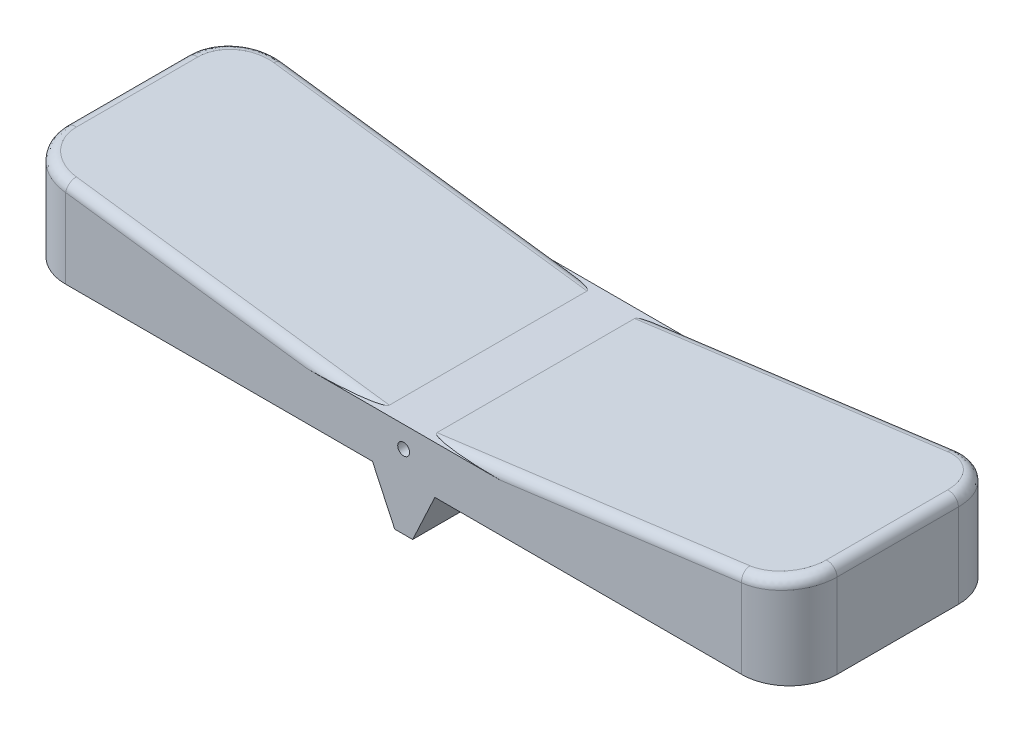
ISO-10303-21;
HEADER;
FILE_DESCRIPTION(('STEP AP214'),'2;1');
FILE_NAME('part.step','',(''),(''),'','','');
FILE_SCHEMA(('AUTOMOTIVE_DESIGN { 1 0 10303 214 1 1 1 1 }'));
ENDSEC;
DATA;
#1=APPLICATION_CONTEXT('core data for automotive mechanical design processes');
#2=APPLICATION_PROTOCOL_DEFINITION('international standard','automotive_design',2000,#1);
#3=PRODUCT_CONTEXT('',#1,'mechanical');
#4=PRODUCT('Part','Part','',(#3));
#5=PRODUCT_RELATED_PRODUCT_CATEGORY('part','',(#4));
#6=PRODUCT_DEFINITION_FORMATION('','',#4);
#7=PRODUCT_DEFINITION_CONTEXT('part definition',#1,'design');
#8=PRODUCT_DEFINITION('design','',#6,#7);
#9=PRODUCT_DEFINITION_SHAPE('','',#8);
#10=(LENGTH_UNIT() NAMED_UNIT(*) SI_UNIT(.MILLI.,.METRE.));
#11=(NAMED_UNIT(*) PLANE_ANGLE_UNIT() SI_UNIT($,.RADIAN.));
#12=(NAMED_UNIT(*) SI_UNIT($,.STERADIAN.) SOLID_ANGLE_UNIT());
#13=UNCERTAINTY_MEASURE_WITH_UNIT(LENGTH_MEASURE(1.E-05),#10,'distance_accuracy_value','');
#14=(GEOMETRIC_REPRESENTATION_CONTEXT(3) GLOBAL_UNCERTAINTY_ASSIGNED_CONTEXT((#13)) GLOBAL_UNIT_ASSIGNED_CONTEXT((#10,
#11,#12)) REPRESENTATION_CONTEXT('',''));
#15=CARTESIAN_POINT('',(0.,0.,0.));
#16=DIRECTION('',(0.,0.,1.));
#17=DIRECTION('',(1.,0.,0.));
#18=AXIS2_PLACEMENT_3D('',#15,#16,#17);
#19=CARTESIAN_POINT('',(162.,0.,45.5));
#20=DIRECTION('',(0.,1.,0.));
#21=DIRECTION('',(0.,0.,1.));
#22=AXIS2_PLACEMENT_3D('',#19,#20,#21);
#23=PLANE('',#22);
#24=DIRECTION('',(1.,0.,0.));
#25=VECTOR('',#24,1.);
#26=CARTESIAN_POINT('',(162.,0.,0.));
#27=LINE('',#26,#25);
#28=CARTESIAN_POINT('',(10.,0.,0.));
#29=VERTEX_POINT('',#28);
#30=CARTESIAN_POINT('',(74.4499999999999,0.,0.));
#31=VERTEX_POINT('',#30);
#32=EDGE_CURVE('E257',#29,#31,#27,.T.);
#33=ORIENTED_EDGE('',*,*,#32,.T.);
#34=DIRECTION('',(0.,0.,1.));
#35=VECTOR('',#34,1.);
#36=CARTESIAN_POINT('',(74.4499999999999,0.,45.5));
#37=LINE('',#36,#35);
#38=CARTESIAN_POINT('',(74.4499999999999,0.,45.5));
#39=VERTEX_POINT('',#38);
#40=EDGE_CURVE('E304',#31,#39,#37,.T.);
#41=ORIENTED_EDGE('',*,*,#40,.T.);
#42=DIRECTION('',(1.,0.,0.));
#43=VECTOR('',#42,1.);
#44=CARTESIAN_POINT('',(162.,0.,45.5));
#45=LINE('',#44,#43);
#46=CARTESIAN_POINT('',(10.,0.,45.5));
#47=VERTEX_POINT('',#46);
#48=EDGE_CURVE('E250',#47,#39,#45,.T.);
#49=ORIENTED_EDGE('',*,*,#48,.F.);
#50=CARTESIAN_POINT('',(10.,0.,35.5));
#51=DIRECTION('',(0.,1.,0.));
#52=DIRECTION('',(0.,0.,1.));
#53=AXIS2_PLACEMENT_3D('',#50,#51,#52);
#54=CIRCLE('',#53,10.);
#55=CARTESIAN_POINT('',(0.,0.,35.5));
#56=VERTEX_POINT('',#55);
#57=EDGE_CURVE('E284',#47,#56,#54,.F.);
#58=ORIENTED_EDGE('',*,*,#57,.T.);
#59=DIRECTION('',(0.,0.,-1.));
#60=VECTOR('',#59,1.);
#61=CARTESIAN_POINT('',(0.,0.,45.5));
#62=LINE('',#61,#60);
#63=CARTESIAN_POINT('',(0.,0.,10.));
#64=VERTEX_POINT('',#63);
#65=EDGE_CURVE('E256',#56,#64,#62,.T.);
#66=ORIENTED_EDGE('',*,*,#65,.T.);
#67=CARTESIAN_POINT('',(10.,0.,10.));
#68=DIRECTION('',(0.,1.,0.));
#69=DIRECTION('',(0.,0.,1.));
#70=AXIS2_PLACEMENT_3D('',#67,#68,#69);
#71=CIRCLE('',#70,10.);
#72=EDGE_CURVE('E282',#64,#29,#71,.F.);
#73=ORIENTED_EDGE('',*,*,#72,.T.);
#74=EDGE_LOOP('',(#33,#41,#49,#58,#66,#73));
#75=FACE_BOUND('',#74,.T.);
#76=ADVANCED_FACE('F38',(#75),#23,.F.);
#77=CARTESIAN_POINT('',(87.5500000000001,0.,45.5));
#78=VERTEX_POINT('',#77);
#79=CARTESIAN_POINT('',(152.,0.,45.5));
#80=VERTEX_POINT('',#79);
#81=EDGE_CURVE('E254',#78,#80,#45,.T.);
#82=ORIENTED_EDGE('',*,*,#81,.F.);
#83=DIRECTION('',(0.,0.,-1.));
#84=VECTOR('',#83,1.);
#85=CARTESIAN_POINT('',(87.5500000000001,0.,0.));
#86=LINE('',#85,#84);
#87=CARTESIAN_POINT('',(87.5500000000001,0.,0.));
#88=VERTEX_POINT('',#87);
#89=EDGE_CURVE('E301',#78,#88,#86,.T.);
#90=ORIENTED_EDGE('',*,*,#89,.T.);
#91=CARTESIAN_POINT('',(152.,0.,0.));
#92=VERTEX_POINT('',#91);
#93=EDGE_CURVE('E247',#88,#92,#27,.T.);
#94=ORIENTED_EDGE('',*,*,#93,.T.);
#95=CARTESIAN_POINT('',(152.,0.,10.));
#96=DIRECTION('',(0.,1.,0.));
#97=DIRECTION('',(0.,0.,1.));
#98=AXIS2_PLACEMENT_3D('',#95,#96,#97);
#99=CIRCLE('',#98,10.);
#100=CARTESIAN_POINT('',(162.,0.,10.));
#101=VERTEX_POINT('',#100);
#102=EDGE_CURVE('E277',#92,#101,#99,.F.);
#103=ORIENTED_EDGE('',*,*,#102,.T.);
#104=DIRECTION('',(0.,0.,-1.));
#105=VECTOR('',#104,1.);
#106=CARTESIAN_POINT('',(162.,0.,45.5));
#107=LINE('',#106,#105);
#108=CARTESIAN_POINT('',(162.,0.,35.5));
#109=VERTEX_POINT('',#108);
#110=EDGE_CURVE('E269',#109,#101,#107,.T.);
#111=ORIENTED_EDGE('',*,*,#110,.F.);
#112=CARTESIAN_POINT('',(152.,0.,35.5));
#113=DIRECTION('',(0.,1.,0.));
#114=DIRECTION('',(0.,0.,1.));
#115=AXIS2_PLACEMENT_3D('',#112,#113,#114);
#116=CIRCLE('',#115,10.);
#117=EDGE_CURVE('E279',#109,#80,#116,.F.);
#118=ORIENTED_EDGE('',*,*,#117,.T.);
#119=EDGE_LOOP('',(#82,#90,#94,#103,#111,#118));
#120=FACE_BOUND('',#119,.T.);
#121=ADVANCED_FACE('F472',(#120),#23,.F.);
#122=CARTESIAN_POINT('',(0.,0.,45.5));
#123=DIRECTION('',(0.,0.,-1.));
#124=DIRECTION('',(-1.,0.,0.));
#125=AXIS2_PLACEMENT_3D('',#122,#123,#124);
#126=PLANE('',#125);
#127=DIRECTION('',(-1.,0.,0.));
#128=VECTOR('',#127,1.);
#129=CARTESIAN_POINT('',(76.,9.99999999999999,45.5));
#130=LINE('',#129,#128);
#131=CARTESIAN_POINT('',(101.331014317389,9.99999999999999,45.5));
#132=VERTEX_POINT('',#131);
#133=CARTESIAN_POINT('',(60.6689856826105,9.99999999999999,45.5));
#134=VERTEX_POINT('',#133);
#135=EDGE_CURVE('E253',#132,#134,#130,.T.);
#136=ORIENTED_EDGE('',*,*,#135,.T.);
#137=DIRECTION('',(-0.991454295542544,0.130454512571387,0.));
#138=VECTOR('',#137,1.);
#139=CARTESIAN_POINT('',(2.32588471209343,17.6767238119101,45.5));
#140=LINE('',#139,#138);
#141=CARTESIAN_POINT('',(10.,16.6669718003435,45.5));
#142=VERTEX_POINT('',#141);
#143=EDGE_CURVE('E326',#134,#142,#140,.T.);
#144=ORIENTED_EDGE('',*,*,#143,.T.);
#145=DIRECTION('',(0.,-1.,0.));
#146=VECTOR('',#145,1.);
#147=CARTESIAN_POINT('',(10.,0.,45.5));
#148=LINE('',#147,#146);
#149=EDGE_CURVE('E275',#142,#47,#148,.T.);
#150=ORIENTED_EDGE('',*,*,#149,.T.);
#151=ORIENTED_EDGE('',*,*,#48,.T.);
#152=DIRECTION('',(-0.422618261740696,0.906307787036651,0.));
#153=VECTOR('',#152,1.);
#154=CARTESIAN_POINT('',(61.1527687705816,28.5160043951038,45.5));
#155=LINE('',#154,#153);
#156=CARTESIAN_POINT('',(79.1130765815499,-10.,45.5));
#157=VERTEX_POINT('',#156);
#158=EDGE_CURVE('E320',#39,#157,#155,.F.);
#159=ORIENTED_EDGE('',*,*,#158,.T.);
#160=DIRECTION('',(-1.,0.,0.));
#161=VECTOR('',#160,1.);
#162=CARTESIAN_POINT('',(82.8,-10.,45.5));
#163=LINE('',#162,#161);
#164=CARTESIAN_POINT('',(82.8869234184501,-10.,45.5));
#165=VERTEX_POINT('',#164);
#166=EDGE_CURVE('E241',#165,#157,#163,.T.);
#167=ORIENTED_EDGE('',*,*,#166,.F.);
#168=DIRECTION('',(-0.422618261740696,-0.906307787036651,0.));
#169=VECTOR('',#168,1.);
#170=CARTESIAN_POINT('',(71.9130276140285,-33.5335954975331,45.5));
#171=LINE('',#170,#169);
#172=EDGE_CURVE('E310',#165,#78,#171,.F.);
#173=ORIENTED_EDGE('',*,*,#172,.T.);
#174=ORIENTED_EDGE('',*,*,#81,.T.);
#175=DIRECTION('',(0.,1.,0.));
#176=VECTOR('',#175,1.);
#177=CARTESIAN_POINT('',(152.,0.,45.5));
#178=LINE('',#177,#176);
#179=CARTESIAN_POINT('',(152.,16.6669718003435,45.5));
#180=VERTEX_POINT('',#179);
#181=EDGE_CURVE('E272',#80,#180,#178,.T.);
#182=ORIENTED_EDGE('',*,*,#181,.T.);
#183=DIRECTION('',(-0.991454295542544,-0.130454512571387,0.));
#184=VECTOR('',#183,1.);
#185=CARTESIAN_POINT('',(0.431092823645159,-3.2763054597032,45.5));
#186=LINE('',#185,#184);
#187=EDGE_CURVE('E323',#180,#132,#186,.T.);
#188=ORIENTED_EDGE('',*,*,#187,.T.);
#189=EDGE_LOOP('',(#136,#144,#150,#151,#159,#167,#173,#174,#182,#188));
#190=FACE_BOUND('',#189,.T.);
#191=CARTESIAN_POINT('',(81.,5.5,45.5));
#192=DIRECTION('',(0.,0.,1.));
#193=DIRECTION('',(1.,0.,0.));
#194=AXIS2_PLACEMENT_3D('',#191,#192,#193);
#195=CIRCLE('',#194,1.25);
#196=CARTESIAN_POINT('',(82.25,5.5,45.5));
#197=VERTEX_POINT('',#196);
#198=EDGE_CURVE('E244',#197,#197,#195,.T.);
#199=ORIENTED_EDGE('',*,*,#198,.F.);
#200=EDGE_LOOP('',(#199));
#201=FACE_BOUND('',#200,.T.);
#202=ADVANCED_FACE('F477',(#190,#201),#126,.F.);
#203=CARTESIAN_POINT('',(0.,0.,0.));
#204=DIRECTION('',(0.,0.,-1.));
#205=DIRECTION('',(-1.,0.,0.));
#206=AXIS2_PLACEMENT_3D('',#203,#204,#205);
#207=PLANE('',#206);
#208=DIRECTION('',(-1.,0.,0.));
#209=VECTOR('',#208,1.);
#210=CARTESIAN_POINT('',(76.,9.99999999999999,0.));
#211=LINE('',#210,#209);
#212=CARTESIAN_POINT('',(101.331014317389,9.99999999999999,0.));
#213=VERTEX_POINT('',#212);
#214=CARTESIAN_POINT('',(60.6689856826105,9.99999999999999,0.));
#215=VERTEX_POINT('',#214);
#216=EDGE_CURVE('E55',#213,#215,#211,.T.);
#217=ORIENTED_EDGE('',*,*,#216,.F.);
#218=DIRECTION('',(-0.991454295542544,-0.130454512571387,0.));
#219=VECTOR('',#218,1.);
#220=CARTESIAN_POINT('',(152.260909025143,16.7013019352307,0.));
#221=LINE('',#220,#219);
#222=CARTESIAN_POINT('',(152.,16.6669718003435,0.));
#223=VERTEX_POINT('',#222);
#224=EDGE_CURVE('E361',#213,#223,#221,.F.);
#225=ORIENTED_EDGE('',*,*,#224,.T.);
#226=DIRECTION('',(0.,1.,0.));
#227=VECTOR('',#226,1.);
#228=CARTESIAN_POINT('',(152.,0.,0.));
#229=LINE('',#228,#227);
#230=EDGE_CURVE('E291',#223,#92,#229,.F.);
#231=ORIENTED_EDGE('',*,*,#230,.T.);
#232=ORIENTED_EDGE('',*,*,#93,.F.);
#233=DIRECTION('',(0.422618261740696,0.906307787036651,0.));
#234=VECTOR('',#233,1.);
#235=CARTESIAN_POINT('',(82.8,-10.1864078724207,0.));
#236=LINE('',#235,#234);
#237=CARTESIAN_POINT('',(82.8869234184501,-10.,0.));
#238=VERTEX_POINT('',#237);
#239=EDGE_CURVE('E312',#88,#238,#236,.F.);
#240=ORIENTED_EDGE('',*,*,#239,.T.);
#241=DIRECTION('',(1.,0.,0.));
#242=VECTOR('',#241,1.);
#243=CARTESIAN_POINT('',(82.8,-10.,0.));
#244=LINE('',#243,#242);
#245=CARTESIAN_POINT('',(79.1130765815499,-10.,0.));
#246=VERTEX_POINT('',#245);
#247=EDGE_CURVE('E239',#246,#238,#244,.T.);
#248=ORIENTED_EDGE('',*,*,#247,.F.);
#249=DIRECTION('',(0.422618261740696,-0.906307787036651,0.));
#250=VECTOR('',#249,1.);
#251=CARTESIAN_POINT('',(79.2,-10.1864078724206,0.));
#252=LINE('',#251,#250);
#253=EDGE_CURVE('E318',#246,#31,#252,.F.);
#254=ORIENTED_EDGE('',*,*,#253,.T.);
#255=ORIENTED_EDGE('',*,*,#32,.F.);
#256=DIRECTION('',(0.,-1.,0.));
#257=VECTOR('',#256,1.);
#258=CARTESIAN_POINT('',(10.,20.,0.));
#259=LINE('',#258,#257);
#260=CARTESIAN_POINT('',(10.,16.6669718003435,0.));
#261=VERTEX_POINT('',#260);
#262=EDGE_CURVE('E293',#29,#261,#259,.F.);
#263=ORIENTED_EDGE('',*,*,#262,.T.);
#264=DIRECTION('',(-0.991454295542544,0.130454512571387,0.));
#265=VECTOR('',#264,1.);
#266=CARTESIAN_POINT('',(75.7390909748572,8.0170914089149,0.));
#267=LINE('',#266,#265);
#268=EDGE_CURVE('E359',#261,#215,#267,.F.);
#269=ORIENTED_EDGE('',*,*,#268,.T.);
#270=EDGE_LOOP('',(#217,#225,#231,#232,#240,#248,#254,#255,#263,#269));
#271=FACE_BOUND('',#270,.T.);
#272=CARTESIAN_POINT('',(81.,5.5,0.));
#273=DIRECTION('',(0.,0.,1.));
#274=DIRECTION('',(1.,0.,0.));
#275=AXIS2_PLACEMENT_3D('',#272,#273,#274);
#276=CIRCLE('',#275,1.25);
#277=CARTESIAN_POINT('',(82.25,5.5,0.));
#278=VERTEX_POINT('',#277);
#279=EDGE_CURVE('E243',#278,#278,#276,.T.);
#280=ORIENTED_EDGE('',*,*,#279,.T.);
#281=EDGE_LOOP('',(#280));
#282=FACE_BOUND('',#281,.T.);
#283=ADVANCED_FACE('F518',(#271,#282),#207,.T.);
#284=CARTESIAN_POINT('',(162.,20.,45.5));
#285=DIRECTION('',(-1.,0.,0.));
#286=DIRECTION('',(0.,0.,1.));
#287=AXIS2_PLACEMENT_3D('',#284,#285,#286);
#288=PLANE('',#287);
#289=DIRECTION('',(0.,1.,0.));
#290=VECTOR('',#289,1.);
#291=CARTESIAN_POINT('',(162.,20.,10.));
#292=LINE('',#291,#290);
#293=CARTESIAN_POINT('',(162.,17.7196033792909,10.));
#294=VERTEX_POINT('',#293);
#295=EDGE_CURVE('E296',#101,#294,#292,.T.);
#296=ORIENTED_EDGE('',*,*,#295,.T.);
#297=DIRECTION('',(0.,0.,-1.));
#298=VECTOR('',#297,1.);
#299=CARTESIAN_POINT('',(162.,17.7196033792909,45.5));
#300=LINE('',#299,#298);
#301=CARTESIAN_POINT('',(162.,17.7196033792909,35.5));
#302=VERTEX_POINT('',#301);
#303=EDGE_CURVE('E357',#294,#302,#300,.F.);
#304=ORIENTED_EDGE('',*,*,#303,.T.);
#305=DIRECTION('',(0.,1.,0.));
#306=VECTOR('',#305,1.);
#307=CARTESIAN_POINT('',(162.,20.,35.5));
#308=LINE('',#307,#306);
#309=EDGE_CURVE('E299',#302,#109,#308,.F.);
#310=ORIENTED_EDGE('',*,*,#309,.T.);
#311=ORIENTED_EDGE('',*,*,#110,.T.);
#312=EDGE_LOOP('',(#296,#304,#310,#311));
#313=FACE_BOUND('',#312,.T.);
#314=ADVANCED_FACE('F443',(#313),#288,.F.);
#315=CARTESIAN_POINT('',(86.,9.99999999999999,45.5));
#316=DIRECTION('',(0.130454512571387,-0.991454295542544,0.));
#317=DIRECTION('',(0.991454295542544,0.130454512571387,0.));
#318=AXIS2_PLACEMENT_3D('',#315,#316,#317);
#319=PLANE('',#318);
#320=DIRECTION('',(0.,0.,-1.));
#321=VECTOR('',#320,1.);
#322=CARTESIAN_POINT('',(86.,9.99999999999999,45.5));
#323=LINE('',#322,#321);
#324=CARTESIAN_POINT('',(86.,9.99999999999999,43.5));
#325=VERTEX_POINT('',#324);
#326=CARTESIAN_POINT('',(86.,9.99999999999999,2.));
#327=VERTEX_POINT('',#326);
#328=EDGE_CURVE('E266',#325,#327,#323,.T.);
#329=ORIENTED_EDGE('',*,*,#328,.F.);
#330=DIRECTION('',(-0.991454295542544,-0.130454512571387,0.));
#331=VECTOR('',#330,1.);
#332=CARTESIAN_POINT('',(86.,9.99999999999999,43.5));
#333=LINE('',#332,#331);
#334=CARTESIAN_POINT('',(151.739090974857,18.6498803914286,43.5));
#335=VERTEX_POINT('',#334);
#336=EDGE_CURVE('E353',#325,#335,#333,.F.);
#337=ORIENTED_EDGE('',*,*,#336,.T.);
#338=CARTESIAN_POINT('',(151.739090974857,18.6498803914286,35.5));
#339=DIRECTION('',(0.130454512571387,-0.991454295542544,0.));
#340=DIRECTION('',(0.991454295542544,0.130454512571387,0.));
#341=AXIS2_PLACEMENT_3D('',#338,#339,#340);
#342=ELLIPSE('',#341,8.06895490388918,8.);
#343=CARTESIAN_POINT('',(159.739090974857,19.7025119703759,35.5));
#344=VERTEX_POINT('',#343);
#345=EDGE_CURVE('E351',#335,#344,#342,.F.);
#346=ORIENTED_EDGE('',*,*,#345,.T.);
#347=DIRECTION('',(0.,0.,-1.));
#348=VECTOR('',#347,1.);
#349=CARTESIAN_POINT('',(159.739090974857,19.7025119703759,45.5));
#350=LINE('',#349,#348);
#351=CARTESIAN_POINT('',(159.739090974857,19.7025119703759,10.));
#352=VERTEX_POINT('',#351);
#353=EDGE_CURVE('E349',#344,#352,#350,.T.);
#354=ORIENTED_EDGE('',*,*,#353,.T.);
#355=CARTESIAN_POINT('',(151.739090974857,18.6498803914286,10.));
#356=DIRECTION('',(0.130454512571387,-0.991454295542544,0.));
#357=DIRECTION('',(-0.991454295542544,-0.130454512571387,0.));
#358=AXIS2_PLACEMENT_3D('',#355,#356,#357);
#359=ELLIPSE('',#358,8.06895490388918,8.);
#360=CARTESIAN_POINT('',(151.739090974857,18.6498803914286,2.));
#361=VERTEX_POINT('',#360);
#362=EDGE_CURVE('E345',#352,#361,#359,.F.);
#363=ORIENTED_EDGE('',*,*,#362,.T.);
#364=DIRECTION('',(-0.991454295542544,-0.130454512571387,0.));
#365=VECTOR('',#364,1.);
#366=CARTESIAN_POINT('',(86.,9.99999999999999,2.));
#367=LINE('',#366,#365);
#368=EDGE_CURVE('E347',#361,#327,#367,.T.);
#369=ORIENTED_EDGE('',*,*,#368,.T.);
#370=EDGE_LOOP('',(#329,#337,#346,#354,#363,#369));
#371=FACE_BOUND('',#370,.T.);
#372=ADVANCED_FACE('F439',(#371),#319,.F.);
#373=CARTESIAN_POINT('',(76.,9.99999999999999,45.5));
#374=DIRECTION('',(0.,-1.,0.));
#375=DIRECTION('',(0.,0.,-1.));
#376=AXIS2_PLACEMENT_3D('',#373,#374,#375);
#377=PLANE('',#376);
#378=ORIENTED_EDGE('',*,*,#216,.T.);
#379=CARTESIAN_POINT('',(60.6689856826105,9.99999999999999,2.));
#380=DIRECTION('',(0.,-1.,0.));
#381=DIRECTION('',(1.,0.,0.));
#382=AXIS2_PLACEMENT_3D('',#379,#380,#381);
#383=ELLIPSE('',#382,15.3310143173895,2.);
#384=CARTESIAN_POINT('',(76.,9.99999999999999,2.));
#385=VERTEX_POINT('',#384);
#386=EDGE_CURVE('E11',#215,#385,#383,.T.);
#387=ORIENTED_EDGE('',*,*,#386,.T.);
#388=DIRECTION('',(0.,0.,-1.));
#389=VECTOR('',#388,1.);
#390=CARTESIAN_POINT('',(76.,9.99999999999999,45.5));
#391=LINE('',#390,#389);
#392=CARTESIAN_POINT('',(76.,9.99999999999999,43.5));
#393=VERTEX_POINT('',#392);
#394=EDGE_CURVE('E263',#393,#385,#391,.T.);
#395=ORIENTED_EDGE('',*,*,#394,.F.);
#396=CARTESIAN_POINT('',(60.6689856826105,9.99999999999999,43.5));
#397=DIRECTION('',(0.,-1.,0.));
#398=DIRECTION('',(-1.,0.,0.));
#399=AXIS2_PLACEMENT_3D('',#396,#397,#398);
#400=ELLIPSE('',#399,15.3310143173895,2.);
#401=EDGE_CURVE('E365',#393,#134,#400,.T.);
#402=ORIENTED_EDGE('',*,*,#401,.T.);
#403=ORIENTED_EDGE('',*,*,#135,.F.);
#404=CARTESIAN_POINT('',(101.331014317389,9.99999999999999,43.5));
#405=DIRECTION('',(0.,-1.,0.));
#406=DIRECTION('',(-1.,0.,0.));
#407=AXIS2_PLACEMENT_3D('',#404,#405,#406);
#408=ELLIPSE('',#407,15.3310143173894,2.);
#409=EDGE_CURVE('E368',#132,#325,#408,.T.);
#410=ORIENTED_EDGE('',*,*,#409,.T.);
#411=ORIENTED_EDGE('',*,*,#328,.T.);
#412=CARTESIAN_POINT('',(101.331014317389,9.99999999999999,2.));
#413=DIRECTION('',(0.,-1.,0.));
#414=DIRECTION('',(1.,0.,0.));
#415=AXIS2_PLACEMENT_3D('',#412,#413,#414);
#416=ELLIPSE('',#415,15.3310143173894,2.);
#417=EDGE_CURVE('E47',#327,#213,#416,.T.);
#418=ORIENTED_EDGE('',*,*,#417,.T.);
#419=EDGE_LOOP('',(#378,#387,#395,#402,#403,#410,#411,#418));
#420=FACE_BOUND('',#419,.T.);
#421=ADVANCED_FACE('F442',(#420),#377,.F.);
#422=CARTESIAN_POINT('',(0.,20.,45.5));
#423=DIRECTION('',(-0.130454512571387,-0.991454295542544,0.));
#424=DIRECTION('',(0.991454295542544,-0.130454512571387,0.));
#425=AXIS2_PLACEMENT_3D('',#422,#423,#424);
#426=PLANE('',#425);
#427=CARTESIAN_POINT('',(10.2609090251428,18.6498803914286,35.5));
#428=DIRECTION('',(-0.130454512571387,-0.991454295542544,0.));
#429=DIRECTION('',(0.991454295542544,-0.130454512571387,0.));
#430=AXIS2_PLACEMENT_3D('',#427,#428,#429);
#431=ELLIPSE('',#430,8.06895490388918,8.);
#432=CARTESIAN_POINT('',(2.26090902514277,19.7025119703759,35.5));
#433=VERTEX_POINT('',#432);
#434=CARTESIAN_POINT('',(10.2609090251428,18.6498803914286,43.5));
#435=VERTEX_POINT('',#434);
#436=EDGE_CURVE('E335',#433,#435,#431,.F.);
#437=ORIENTED_EDGE('',*,*,#436,.T.);
#438=DIRECTION('',(-0.991454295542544,0.130454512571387,0.));
#439=VECTOR('',#438,1.);
#440=CARTESIAN_POINT('',(0.,20.,43.5));
#441=LINE('',#440,#439);
#442=EDGE_CURVE('E337',#435,#393,#441,.F.);
#443=ORIENTED_EDGE('',*,*,#442,.T.);
#444=ORIENTED_EDGE('',*,*,#394,.T.);
#445=DIRECTION('',(-0.991454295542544,0.130454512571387,0.));
#446=VECTOR('',#445,1.);
#447=CARTESIAN_POINT('',(10.,18.6842105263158,2.));
#448=LINE('',#447,#446);
#449=CARTESIAN_POINT('',(10.2609090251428,18.6498803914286,2.));
#450=VERTEX_POINT('',#449);
#451=EDGE_CURVE('E329',#385,#450,#448,.T.);
#452=ORIENTED_EDGE('',*,*,#451,.T.);
#453=CARTESIAN_POINT('',(10.2609090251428,18.6498803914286,10.));
#454=DIRECTION('',(-0.130454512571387,-0.991454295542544,0.));
#455=DIRECTION('',(-0.991454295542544,0.130454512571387,0.));
#456=AXIS2_PLACEMENT_3D('',#453,#454,#455);
#457=ELLIPSE('',#456,8.06895490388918,8.);
#458=CARTESIAN_POINT('',(2.26090902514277,19.7025119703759,10.));
#459=VERTEX_POINT('',#458);
#460=EDGE_CURVE('E331',#450,#459,#457,.F.);
#461=ORIENTED_EDGE('',*,*,#460,.T.);
#462=DIRECTION('',(0.,0.,-1.));
#463=VECTOR('',#462,1.);
#464=CARTESIAN_POINT('',(2.26090902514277,19.7025119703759,45.5));
#465=LINE('',#464,#463);
#466=EDGE_CURVE('E333',#459,#433,#465,.F.);
#467=ORIENTED_EDGE('',*,*,#466,.T.);
#468=EDGE_LOOP('',(#437,#443,#444,#452,#461,#467));
#469=FACE_BOUND('',#468,.T.);
#470=ADVANCED_FACE('F393',(#469),#426,.F.);
#471=CARTESIAN_POINT('',(0.,0.,45.5));
#472=DIRECTION('',(1.,0.,0.));
#473=DIRECTION('',(0.,1.,0.));
#474=AXIS2_PLACEMENT_3D('',#471,#472,#473);
#475=PLANE('',#474);
#476=DIRECTION('',(0.,-1.,0.));
#477=VECTOR('',#476,1.);
#478=CARTESIAN_POINT('',(0.,0.,35.5));
#479=LINE('',#478,#477);
#480=CARTESIAN_POINT('',(0.,17.7196033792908,35.5));
#481=VERTEX_POINT('',#480);
#482=EDGE_CURVE('E288',#56,#481,#479,.F.);
#483=ORIENTED_EDGE('',*,*,#482,.T.);
#484=DIRECTION('',(0.,0.,-1.));
#485=VECTOR('',#484,1.);
#486=CARTESIAN_POINT('',(0.,17.7196033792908,45.5));
#487=LINE('',#486,#485);
#488=CARTESIAN_POINT('',(0.,17.7196033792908,10.));
#489=VERTEX_POINT('',#488);
#490=EDGE_CURVE('E341',#481,#489,#487,.T.);
#491=ORIENTED_EDGE('',*,*,#490,.T.);
#492=DIRECTION('',(0.,-1.,0.));
#493=VECTOR('',#492,1.);
#494=CARTESIAN_POINT('',(0.,0.,10.));
#495=LINE('',#494,#493);
#496=EDGE_CURVE('E286',#489,#64,#495,.T.);
#497=ORIENTED_EDGE('',*,*,#496,.T.);
#498=ORIENTED_EDGE('',*,*,#65,.F.);
#499=EDGE_LOOP('',(#483,#491,#497,#498));
#500=FACE_BOUND('',#499,.T.);
#501=ADVANCED_FACE('F493',(#500),#475,.F.);
#502=CARTESIAN_POINT('',(81.,5.5,45.5));
#503=DIRECTION('',(0.,0.,-1.));
#504=DIRECTION('',(-1.,0.,0.));
#505=AXIS2_PLACEMENT_3D('',#502,#503,#504);
#506=CYLINDRICAL_SURFACE('',#505,1.25);
#507=ORIENTED_EDGE('',*,*,#198,.T.);
#508=EDGE_LOOP('',(#507));
#509=FACE_BOUND('',#508,.T.);
#510=ORIENTED_EDGE('',*,*,#279,.F.);
#511=EDGE_LOOP('',(#510));
#512=FACE_BOUND('',#511,.T.);
#513=ADVANCED_FACE('F403',(#509,#512),#506,.F.);
#514=CARTESIAN_POINT('',(10.,0.,35.5));
#515=DIRECTION('',(0.,-1.,0.));
#516=DIRECTION('',(1.,0.,0.));
#517=AXIS2_PLACEMENT_3D('',#514,#515,#516);
#518=CYLINDRICAL_SURFACE('',#517,10.);
#519=ORIENTED_EDGE('',*,*,#149,.F.);
#520=CARTESIAN_POINT('',(10.,16.6669718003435,35.5));
#521=DIRECTION('',(0.104684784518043,0.994505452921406,0.));
#522=DIRECTION('',(0.994505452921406,-0.104684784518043,0.));
#523=AXIS2_PLACEMENT_3D('',#520,#521,#522);
#524=ELLIPSE('',#523,10.0552490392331,10.);
#525=EDGE_CURVE('E339',#142,#481,#524,.F.);
#526=ORIENTED_EDGE('',*,*,#525,.T.);
#527=ORIENTED_EDGE('',*,*,#482,.F.);
#528=ORIENTED_EDGE('',*,*,#57,.F.);
#529=EDGE_LOOP('',(#519,#526,#527,#528));
#530=FACE_BOUND('',#529,.T.);
#531=ADVANCED_FACE('F397',(#530),#518,.T.);
#532=CARTESIAN_POINT('',(10.,0.,10.));
#533=DIRECTION('',(0.,1.,0.));
#534=DIRECTION('',(-1.,0.,0.));
#535=AXIS2_PLACEMENT_3D('',#532,#533,#534);
#536=CYLINDRICAL_SURFACE('',#535,10.);
#537=ORIENTED_EDGE('',*,*,#496,.F.);
#538=CARTESIAN_POINT('',(10.,16.6669718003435,10.));
#539=DIRECTION('',(0.104684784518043,0.994505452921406,0.));
#540=DIRECTION('',(-0.994505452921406,0.104684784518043,0.));
#541=AXIS2_PLACEMENT_3D('',#538,#539,#540);
#542=ELLIPSE('',#541,10.0552490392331,10.);
#543=EDGE_CURVE('E343',#489,#261,#542,.F.);
#544=ORIENTED_EDGE('',*,*,#543,.T.);
#545=ORIENTED_EDGE('',*,*,#262,.F.);
#546=ORIENTED_EDGE('',*,*,#72,.F.);
#547=EDGE_LOOP('',(#537,#544,#545,#546));
#548=FACE_BOUND('',#547,.T.);
#549=ADVANCED_FACE('F402',(#548),#536,.T.);
#550=CARTESIAN_POINT('',(152.,0.,35.5));
#551=DIRECTION('',(0.,1.,0.));
#552=DIRECTION('',(0.,0.,1.));
#553=AXIS2_PLACEMENT_3D('',#550,#551,#552);
#554=CYLINDRICAL_SURFACE('',#553,10.);
#555=ORIENTED_EDGE('',*,*,#309,.F.);
#556=CARTESIAN_POINT('',(152.,16.6669718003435,35.5));
#557=DIRECTION('',(-0.104684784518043,0.994505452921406,0.));
#558=DIRECTION('',(0.994505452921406,0.104684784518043,0.));
#559=AXIS2_PLACEMENT_3D('',#556,#557,#558);
#560=ELLIPSE('',#559,10.0552490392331,10.);
#561=EDGE_CURVE('E355',#302,#180,#560,.F.);
#562=ORIENTED_EDGE('',*,*,#561,.T.);
#563=ORIENTED_EDGE('',*,*,#181,.F.);
#564=ORIENTED_EDGE('',*,*,#117,.F.);
#565=EDGE_LOOP('',(#555,#562,#563,#564));
#566=FACE_BOUND('',#565,.T.);
#567=ADVANCED_FACE('F409',(#566),#554,.T.);
#568=CARTESIAN_POINT('',(152.,20.,10.));
#569=DIRECTION('',(0.,-1.,0.));
#570=DIRECTION('',(0.,0.,-1.));
#571=AXIS2_PLACEMENT_3D('',#568,#569,#570);
#572=CYLINDRICAL_SURFACE('',#571,10.);
#573=ORIENTED_EDGE('',*,*,#230,.F.);
#574=CARTESIAN_POINT('',(152.,16.6669718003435,10.));
#575=DIRECTION('',(-0.104684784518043,0.994505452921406,0.));
#576=DIRECTION('',(-0.994505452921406,-0.104684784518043,0.));
#577=AXIS2_PLACEMENT_3D('',#574,#575,#576);
#578=ELLIPSE('',#577,10.0552490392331,10.);
#579=EDGE_CURVE('E363',#223,#294,#578,.F.);
#580=ORIENTED_EDGE('',*,*,#579,.T.);
#581=ORIENTED_EDGE('',*,*,#295,.F.);
#582=ORIENTED_EDGE('',*,*,#102,.F.);
#583=EDGE_LOOP('',(#573,#580,#581,#582));
#584=FACE_BOUND('',#583,.T.);
#585=ADVANCED_FACE('F449',(#584),#572,.T.);
#586=CARTESIAN_POINT('',(0.,-10.,0.));
#587=DIRECTION('',(0.,1.,0.));
#588=DIRECTION('',(0.,0.,1.));
#589=AXIS2_PLACEMENT_3D('',#586,#587,#588);
#590=PLANE('',#589);
#591=ORIENTED_EDGE('',*,*,#166,.T.);
#592=DIRECTION('',(0.,0.,1.));
#593=VECTOR('',#592,1.);
#594=CARTESIAN_POINT('',(79.1130765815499,-10.,0.));
#595=LINE('',#594,#593);
#596=EDGE_CURVE('E315',#157,#246,#595,.F.);
#597=ORIENTED_EDGE('',*,*,#596,.T.);
#598=ORIENTED_EDGE('',*,*,#247,.T.);
#599=DIRECTION('',(0.,0.,-1.));
#600=VECTOR('',#599,1.);
#601=CARTESIAN_POINT('',(82.8869234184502,-10.,0.));
#602=LINE('',#601,#600);
#603=EDGE_CURVE('E307',#238,#165,#602,.F.);
#604=ORIENTED_EDGE('',*,*,#603,.T.);
#605=EDGE_LOOP('',(#591,#597,#598,#604));
#606=FACE_BOUND('',#605,.T.);
#607=DIRECTION('',(0.,0.,-1.));
#608=VECTOR('',#607,1.);
#609=CARTESIAN_POINT('',(80.7,-10.,40.25));
#610=LINE('',#609,#608);
#611=CARTESIAN_POINT('',(80.7,-10.,40.25));
#612=VERTEX_POINT('',#611);
#613=CARTESIAN_POINT('',(80.7,-10.,5.25));
#614=VERTEX_POINT('',#613);
#615=EDGE_CURVE('E226',#612,#614,#610,.T.);
#616=ORIENTED_EDGE('',*,*,#615,.F.);
#617=DIRECTION('',(-1.,0.,0.));
#618=VECTOR('',#617,1.);
#619=CARTESIAN_POINT('',(81.3,-10.,40.25));
#620=LINE('',#619,#618);
#621=CARTESIAN_POINT('',(81.3,-10.,40.25));
#622=VERTEX_POINT('',#621);
#623=EDGE_CURVE('E203',#622,#612,#620,.T.);
#624=ORIENTED_EDGE('',*,*,#623,.F.);
#625=DIRECTION('',(0.,0.,1.));
#626=VECTOR('',#625,1.);
#627=CARTESIAN_POINT('',(81.3,-10.,40.25));
#628=LINE('',#627,#626);
#629=CARTESIAN_POINT('',(81.3,-10.,5.25));
#630=VERTEX_POINT('',#629);
#631=EDGE_CURVE('E230',#630,#622,#628,.T.);
#632=ORIENTED_EDGE('',*,*,#631,.F.);
#633=DIRECTION('',(1.,0.,0.));
#634=VECTOR('',#633,1.);
#635=CARTESIAN_POINT('',(81.3,-10.,5.25));
#636=LINE('',#635,#634);
#637=EDGE_CURVE('E228',#614,#630,#636,.T.);
#638=ORIENTED_EDGE('',*,*,#637,.F.);
#639=EDGE_LOOP('',(#616,#624,#632,#638));
#640=FACE_BOUND('',#639,.T.);
#641=ADVANCED_FACE('F453',(#606,#640),#590,.F.);
#642=CARTESIAN_POINT('',(80.7,-10.,40.25));
#643=DIRECTION('',(1.,0.,0.));
#644=DIRECTION('',(0.,0.,-1.));
#645=AXIS2_PLACEMENT_3D('',#642,#643,#644);
#646=PLANE('',#645);
#647=DIRECTION('',(0.,0.,-1.));
#648=VECTOR('',#647,1.);
#649=CARTESIAN_POINT('',(80.7,-1.125,5.25));
#650=LINE('',#649,#648);
#651=CARTESIAN_POINT('',(80.7,-1.125,40.25));
#652=VERTEX_POINT('',#651);
#653=CARTESIAN_POINT('',(80.7,-1.125,5.25));
#654=VERTEX_POINT('',#653);
#655=EDGE_CURVE('E210',#652,#654,#650,.T.);
#656=ORIENTED_EDGE('',*,*,#655,.F.);
#657=DIRECTION('',(0.,1.,0.));
#658=VECTOR('',#657,1.);
#659=CARTESIAN_POINT('',(80.7,-10.,40.25));
#660=LINE('',#659,#658);
#661=EDGE_CURVE('E196',#612,#652,#660,.T.);
#662=ORIENTED_EDGE('',*,*,#661,.F.);
#663=ORIENTED_EDGE('',*,*,#615,.T.);
#664=DIRECTION('',(0.,1.,0.));
#665=VECTOR('',#664,1.);
#666=CARTESIAN_POINT('',(80.7,-10.,5.25));
#667=LINE('',#666,#665);
#668=EDGE_CURVE('E213',#614,#654,#667,.T.);
#669=ORIENTED_EDGE('',*,*,#668,.T.);
#670=EDGE_LOOP('',(#656,#662,#663,#669));
#671=FACE_BOUND('',#670,.T.);
#672=ADVANCED_FACE('F211',(#671),#646,.T.);
#673=CARTESIAN_POINT('',(81.3,-10.,5.25));
#674=DIRECTION('',(0.,0.,1.));
#675=DIRECTION('',(1.,0.,0.));
#676=AXIS2_PLACEMENT_3D('',#673,#674,#675);
#677=PLANE('',#676);
#678=DIRECTION('',(1.,0.,0.));
#679=VECTOR('',#678,1.);
#680=CARTESIAN_POINT('',(81.3,-1.125,5.25));
#681=LINE('',#680,#679);
#682=CARTESIAN_POINT('',(81.3,-1.125,5.25));
#683=VERTEX_POINT('',#682);
#684=EDGE_CURVE('E216',#654,#683,#681,.T.);
#685=ORIENTED_EDGE('',*,*,#684,.F.);
#686=ORIENTED_EDGE('',*,*,#668,.F.);
#687=ORIENTED_EDGE('',*,*,#637,.T.);
#688=DIRECTION('',(0.,1.,0.));
#689=VECTOR('',#688,1.);
#690=CARTESIAN_POINT('',(81.3,-10.,5.25));
#691=LINE('',#690,#689);
#692=EDGE_CURVE('E235',#630,#683,#691,.T.);
#693=ORIENTED_EDGE('',*,*,#692,.T.);
#694=EDGE_LOOP('',(#685,#686,#687,#693));
#695=FACE_BOUND('',#694,.T.);
#696=ADVANCED_FACE('F707',(#695),#677,.T.);
#697=CARTESIAN_POINT('',(81.3,-10.,40.25));
#698=DIRECTION('',(-1.,0.,0.));
#699=DIRECTION('',(0.,0.,1.));
#700=AXIS2_PLACEMENT_3D('',#697,#698,#699);
#701=PLANE('',#700);
#702=DIRECTION('',(0.,0.,1.));
#703=VECTOR('',#702,1.);
#704=CARTESIAN_POINT('',(81.3,-1.125,5.25));
#705=LINE('',#704,#703);
#706=CARTESIAN_POINT('',(81.3,-1.125,40.25));
#707=VERTEX_POINT('',#706);
#708=EDGE_CURVE('E220',#683,#707,#705,.T.);
#709=ORIENTED_EDGE('',*,*,#708,.F.);
#710=ORIENTED_EDGE('',*,*,#692,.F.);
#711=ORIENTED_EDGE('',*,*,#631,.T.);
#712=DIRECTION('',(0.,1.,0.));
#713=VECTOR('',#712,1.);
#714=CARTESIAN_POINT('',(81.3,-10.,40.25));
#715=LINE('',#714,#713);
#716=EDGE_CURVE('E206',#622,#707,#715,.T.);
#717=ORIENTED_EDGE('',*,*,#716,.T.);
#718=EDGE_LOOP('',(#709,#710,#711,#717));
#719=FACE_BOUND('',#718,.T.);
#720=ADVANCED_FACE('F710',(#719),#701,.T.);
#721=CARTESIAN_POINT('',(81.3,-10.,40.25));
#722=DIRECTION('',(0.,0.,-1.));
#723=DIRECTION('',(-1.,0.,0.));
#724=AXIS2_PLACEMENT_3D('',#721,#722,#723);
#725=PLANE('',#724);
#726=DIRECTION('',(-1.,0.,0.));
#727=VECTOR('',#726,1.);
#728=CARTESIAN_POINT('',(81.3,-1.125,40.25));
#729=LINE('',#728,#727);
#730=EDGE_CURVE('E200',#707,#652,#729,.T.);
#731=ORIENTED_EDGE('',*,*,#730,.F.);
#732=ORIENTED_EDGE('',*,*,#716,.F.);
#733=ORIENTED_EDGE('',*,*,#623,.T.);
#734=ORIENTED_EDGE('',*,*,#661,.T.);
#735=EDGE_LOOP('',(#731,#732,#733,#734));
#736=FACE_BOUND('',#735,.T.);
#737=ADVANCED_FACE('F198',(#736),#725,.T.);
#738=CARTESIAN_POINT('',(82.8,-10.1864078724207,45.5));
#739=DIRECTION('',(0.906307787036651,-0.422618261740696,0.));
#740=DIRECTION('',(0.,0.,-1.));
#741=AXIS2_PLACEMENT_3D('',#738,#739,#740);
#742=PLANE('',#741);
#743=ORIENTED_EDGE('',*,*,#239,.F.);
#744=ORIENTED_EDGE('',*,*,#89,.F.);
#745=ORIENTED_EDGE('',*,*,#172,.F.);
#746=ORIENTED_EDGE('',*,*,#603,.F.);
#747=EDGE_LOOP('',(#743,#744,#745,#746));
#748=FACE_BOUND('',#747,.T.);
#749=ADVANCED_FACE('F456',(#748),#742,.T.);
#750=CARTESIAN_POINT('',(79.2,-10.1864078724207,45.5));
#751=DIRECTION('',(-0.906307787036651,-0.422618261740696,0.));
#752=DIRECTION('',(0.,0.,1.));
#753=AXIS2_PLACEMENT_3D('',#750,#751,#752);
#754=PLANE('',#753);
#755=ORIENTED_EDGE('',*,*,#158,.F.);
#756=ORIENTED_EDGE('',*,*,#40,.F.);
#757=ORIENTED_EDGE('',*,*,#253,.F.);
#758=ORIENTED_EDGE('',*,*,#596,.F.);
#759=EDGE_LOOP('',(#755,#756,#757,#758));
#760=FACE_BOUND('',#759,.T.);
#761=ADVANCED_FACE('F461',(#760),#754,.T.);
#762=CARTESIAN_POINT('',(0.,-1.125,0.));
#763=DIRECTION('',(0.,-1.,0.));
#764=DIRECTION('',(0.,0.,-1.));
#765=AXIS2_PLACEMENT_3D('',#762,#763,#764);
#766=PLANE('',#765);
#767=ORIENTED_EDGE('',*,*,#708,.T.);
#768=ORIENTED_EDGE('',*,*,#730,.T.);
#769=ORIENTED_EDGE('',*,*,#655,.T.);
#770=ORIENTED_EDGE('',*,*,#684,.T.);
#771=EDGE_LOOP('',(#767,#768,#769,#770));
#772=FACE_BOUND('',#771,.T.);
#773=ADVANCED_FACE('F219',(#772),#766,.T.);
#774=CARTESIAN_POINT('',(-0.260909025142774,18.0170914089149,2.));
#775=DIRECTION('',(0.991454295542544,-0.130454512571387,0.));
#776=DIRECTION('',(0.130454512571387,0.991454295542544,0.));
#777=AXIS2_PLACEMENT_3D('',#774,#775,#776);
#778=CYLINDRICAL_SURFACE('',#777,2.);
#779=ORIENTED_EDGE('',*,*,#386,.F.);
#780=ORIENTED_EDGE('',*,*,#268,.F.);
#781=CARTESIAN_POINT('',(10.,16.6669718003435,2.));
#782=DIRECTION('',(-0.991454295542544,0.130454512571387,0.));
#783=DIRECTION('',(-0.130454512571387,-0.991454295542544,0.));
#784=AXIS2_PLACEMENT_3D('',#781,#782,#783);
#785=CIRCLE('',#784,2.);
#786=EDGE_CURVE('E222',#450,#261,#785,.T.);
#787=ORIENTED_EDGE('',*,*,#786,.F.);
#788=ORIENTED_EDGE('',*,*,#451,.F.);
#789=EDGE_LOOP('',(#779,#780,#787,#788));
#790=FACE_BOUND('',#789,.T.);
#791=ADVANCED_FACE('F417',(#790),#778,.T.);
#792=CARTESIAN_POINT('',(2.26090902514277,19.7025119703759,10.));
#793=CARTESIAN_POINT('',(0.,20.,10.));
#794=CARTESIAN_POINT('',(0.,17.7196033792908,10.));
#795=CARTESIAN_POINT('',(2.26090902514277,19.7025119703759,9.65091761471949));
#796=CARTESIAN_POINT('',(0.,20.,9.5505536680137));
#797=CARTESIAN_POINT('',(0.,17.7196033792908,9.56364701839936));
#798=CARTESIAN_POINT('',(2.28379251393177,19.699500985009,9.30183522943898));
#799=CARTESIAN_POINT('',(0.0303044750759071,19.9960125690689,9.10130023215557));
#800=CARTESIAN_POINT('',(0.0286043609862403,17.7165923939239,9.12729403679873));
#801=CARTESIAN_POINT('',(2.37492107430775,19.6875103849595,8.609644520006));
#802=CARTESIAN_POINT('',(0.150975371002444,19.9801348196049,8.21086603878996));
#803=CARTESIAN_POINT('',(0.142515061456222,17.7046017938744,8.2620556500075));
#804=CARTESIAN_POINT('',(2.44317940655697,19.678529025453,8.26653797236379));
#805=CARTESIAN_POINT('',(0.241256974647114,19.9682556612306,7.77005816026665));
#806=CARTESIAN_POINT('',(0.227837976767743,17.6956204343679,7.83317246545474));
#807=CARTESIAN_POINT('',(2.62387640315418,19.6547531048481,7.59216704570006));
#808=CARTESIAN_POINT('',(0.480087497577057,19.9368305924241,6.90478305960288));
#809=CARTESIAN_POINT('',(0.453709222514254,17.671844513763,6.99020880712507));
#810=CARTESIAN_POINT('',(2.73633998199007,19.6399552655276,7.26090945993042));
#811=CARTESIAN_POINT('',(0.628473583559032,19.9173061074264,6.4806510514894));
#812=CARTESIAN_POINT('',(0.594288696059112,17.6570466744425,6.57613682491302));
#813=CARTESIAN_POINT('',(3.00351200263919,19.6048010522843,6.61589861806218));
#814=CARTESIAN_POINT('',(0.980530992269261,19.8709827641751,5.65659918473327));
#815=CARTESIAN_POINT('',(0.928253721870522,17.6218924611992,5.76987327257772));
#816=CARTESIAN_POINT('',(3.15825405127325,19.5844402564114,6.3021595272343));
#817=CARTESIAN_POINT('',(1.1839743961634,19.8442138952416,5.25695521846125));
#818=CARTESIAN_POINT('',(1.12168128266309,17.6015316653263,5.37769940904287));
#819=CARTESIAN_POINT('',(3.50732758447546,19.5385095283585,5.69754594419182));
#820=CARTESIAN_POINT('',(1.64207577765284,19.7839373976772,4.48916976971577));
#821=CARTESIAN_POINT('',(1.55802319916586,17.5556009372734,4.62193243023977));
#822=CARTESIAN_POINT('',(3.70169751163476,19.5129345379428,5.40669403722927));
#823=CARTESIAN_POINT('',(1.89645857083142,19.7504659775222,4.12122795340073));
#824=CARTESIAN_POINT('',(1.80098560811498,17.5300259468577,4.25836754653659));
#825=CARTESIAN_POINT('',(4.12669753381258,19.4570134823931,4.85282278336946));
#826=CARTESIAN_POINT('',(2.45140859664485,19.6774462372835,3.42340074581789));
#827=CARTESIAN_POINT('',(2.33223563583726,17.474104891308,3.56602847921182));
#828=CARTESIAN_POINT('',(4.35736674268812,19.4266622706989,4.58983397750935));
#829=CARTESIAN_POINT('',(2.75167446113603,19.6379375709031,3.09362777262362));
#830=CARTESIAN_POINT('',(2.62057214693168,17.4437536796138,3.23729247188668));
#831=CARTESIAN_POINT('',(4.85101930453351,19.3617079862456,4.09618102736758));
#832=CARTESIAN_POINT('',(3.39255044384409,19.5536117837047,2.47783451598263));
#833=CARTESIAN_POINT('',(3.23763784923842,17.3787993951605,2.62022628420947));
#834=CARTESIAN_POINT('',(5.11403858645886,19.3271001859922,3.86555344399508));
#835=CARTESIAN_POINT('',(3.73285555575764,19.508834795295,2.19183479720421));
#836=CARTESIAN_POINT('',(3.5664119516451,17.3441915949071,2.33194180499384));
#837=CARTESIAN_POINT('',(5.66789558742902,19.254224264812,3.44056368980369));
#838=CARTESIAN_POINT('',(4.44731960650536,19.4148263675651,1.66834020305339));
#839=CARTESIAN_POINT('',(4.25873320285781,17.2713156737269,1.80070461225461));
#840=CARTESIAN_POINT('',(5.95876305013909,19.2159522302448,3.24624096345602));
#841=CARTESIAN_POINT('',(4.82119214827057,19.3656326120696,1.43077580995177));
#842=CARTESIAN_POINT('',(4.62231753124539,17.2330436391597,1.55780120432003));
#843=CARTESIAN_POINT('',(6.56334701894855,19.1364017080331,2.89718397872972));
#844=CARTESIAN_POINT('',(5.59581195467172,19.2637089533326,1.00790622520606));
#845=CARTESIAN_POINT('',(5.37804749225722,17.153493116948,1.12147997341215));
#846=CARTESIAN_POINT('',(6.87708533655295,19.0951203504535,2.74248816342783));
#847=CARTESIAN_POINT('',(5.99631181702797,19.2110116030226,0.822449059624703));
#848=CARTESIAN_POINT('',(5.77022038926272,17.1122117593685,0.928110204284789));
#849=CARTESIAN_POINT('',(7.52205170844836,19.0102563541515,2.47533414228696));
#850=CARTESIAN_POINT('',(6.81687521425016,19.1030427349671,0.506525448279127));
#851=CARTESIAN_POINT('',(6.57642835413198,17.0273477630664,0.594167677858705));
#852=CARTESIAN_POINT('',(7.85329334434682,18.9666719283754,2.36290930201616));
#853=CARTESIAN_POINT('',(7.23674759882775,19.0477963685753,0.375837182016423));
#854=CARTESIAN_POINT('',(6.99048039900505,16.9837633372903,0.453636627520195));
#855=CARTESIAN_POINT('',(8.52760744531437,18.8779463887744,2.18222724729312));
#856=CARTESIAN_POINT('',(8.08856065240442,18.935715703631,0.171158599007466));
#857=CARTESIAN_POINT('',(7.8333730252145,16.8950377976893,0.227784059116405));
#858=CARTESIAN_POINT('',(8.87068638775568,18.8328044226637,2.11399463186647));
#859=CARTESIAN_POINT('',(8.52037961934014,18.8788974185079,0.0968931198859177));
#860=CARTESIAN_POINT('',(8.26222170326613,16.8498958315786,0.142493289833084));
#861=CARTESIAN_POINT('',(9.56281210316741,18.7417352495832,2.02287448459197));
#862=CARTESIAN_POINT('',(9.38854241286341,18.7646654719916,0.00576014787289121));
#863=CARTESIAN_POINT('',(9.1273788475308,16.7588266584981,0.0285931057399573));
#864=CARTESIAN_POINT('',(9.91186056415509,18.6958078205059,2.));
#865=CARTESIAN_POINT('',(9.82484251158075,18.7072575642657,-0.0114166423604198));
#866=CARTESIAN_POINT('',(9.5636894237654,16.7128992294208,0.));
#867=CARTESIAN_POINT('',(10.6099574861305,18.6039529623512,2.));
#868=CARTESIAN_POINT('',(10.694500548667,18.5928288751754,0.0113518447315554));
#869=CARTESIAN_POINT('',(10.4363105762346,16.6210443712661,0.));
#870=CARTESIAN_POINT('',(10.9590059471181,18.5580255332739,2.02287448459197));
#871=CARTESIAN_POINT('',(11.1278962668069,18.5358031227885,0.0509743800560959));
#872=CARTESIAN_POINT('',(10.8726211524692,16.5751169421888,0.0285931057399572));
#873=CARTESIAN_POINT('',(11.6511316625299,18.4669563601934,2.11399463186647));
#874=CARTESIAN_POINT('',(11.9844680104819,18.4230963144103,0.186131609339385));
#875=CARTESIAN_POINT('',(11.7377782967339,16.4840477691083,0.142493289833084));
#876=CARTESIAN_POINT('',(11.9942106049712,18.4218143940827,2.18222724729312));
#877=CARTESIAN_POINT('',(12.4077617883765,18.3673997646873,0.281351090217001));
#878=CARTESIAN_POINT('',(12.1666269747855,16.4389058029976,0.227784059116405));
#879=CARTESIAN_POINT('',(12.6685247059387,18.3330888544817,2.36290930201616));
#880=CARTESIAN_POINT('',(13.2371443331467,18.2582704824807,0.525608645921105));
#881=CARTESIAN_POINT('',(13.0095196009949,16.3501802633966,0.453636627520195));
#882=CARTESIAN_POINT('',(12.9997663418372,18.2895044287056,2.47533414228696));
#883=CARTESIAN_POINT('',(13.6434243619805,18.2048125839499,0.674359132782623));
#884=CARTESIAN_POINT('',(13.423571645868,16.3065958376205,0.594167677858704));
#885=CARTESIAN_POINT('',(13.6447327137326,18.2046404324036,2.74248816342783));
#886=CARTESIAN_POINT('',(14.4321797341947,18.1010289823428,1.02275875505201));
#887=CARTESIAN_POINT('',(14.2297796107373,16.2217318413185,0.928110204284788));
#888=CARTESIAN_POINT('',(13.958471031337,18.1633590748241,2.89718397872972));
#889=CARTESIAN_POINT('',(14.8149088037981,18.0506698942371,1.22216603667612));
#890=CARTESIAN_POINT('',(14.6219525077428,16.180450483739,1.12147997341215));
#891=CARTESIAN_POINT('',(14.5630550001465,18.0838085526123,3.24624096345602));
#892=CARTESIAN_POINT('',(15.5504331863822,17.9538903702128,1.66819640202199));
#893=CARTESIAN_POINT('',(15.3776824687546,16.1008999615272,1.55780120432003));
#894=CARTESIAN_POINT('',(14.8539224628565,18.0455365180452,3.44056368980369));
#895=CARTESIAN_POINT('',(15.9035296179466,17.9074303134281,1.91463844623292));
#896=CARTESIAN_POINT('',(15.7412667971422,16.0626279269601,1.80070461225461));
#897=CARTESIAN_POINT('',(15.4077794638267,17.9726605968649,3.86555344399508));
#898=CARTESIAN_POINT('',(16.5742071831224,17.8191832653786,2.45036195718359));
#899=CARTESIAN_POINT('',(16.4335880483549,15.9897520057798,2.33194180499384));
#900=CARTESIAN_POINT('',(15.670798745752,17.9380527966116,4.09618102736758));
#901=CARTESIAN_POINT('',(16.8921185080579,17.7773528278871,2.73953430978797));
#902=CARTESIAN_POINT('',(16.7623621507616,15.9551442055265,2.62022628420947));
#903=CARTESIAN_POINT('',(16.1644513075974,17.8730985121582,4.58983397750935));
#904=CARTESIAN_POINT('',(17.4874607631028,17.6990183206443,3.35572362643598));
#905=CARTESIAN_POINT('',(17.3794278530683,15.8901899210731,3.23729247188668));
#906=CARTESIAN_POINT('',(16.395120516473,17.8427473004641,4.85282278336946));
#907=CARTESIAN_POINT('',(17.7652303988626,17.6624696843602,3.68270976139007));
#908=CARTESIAN_POINT('',(17.6677643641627,15.859838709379,3.56602847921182));
#909=CARTESIAN_POINT('',(16.8201205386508,17.7868262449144,5.40669403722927));
#910=CARTESIAN_POINT('',(18.2760011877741,17.5952630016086,4.36899403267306));
#911=CARTESIAN_POINT('',(18.199014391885,15.8039176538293,4.25836754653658));
#912=CARTESIAN_POINT('',(17.0144904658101,17.7612512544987,5.69754594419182));
#913=CARTESIAN_POINT('',(18.5093279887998,17.5645621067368,4.72834068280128));
#914=CARTESIAN_POINT('',(18.4419768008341,15.7783426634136,4.62193243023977));
#915=CARTESIAN_POINT('',(17.3635639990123,17.7153205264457,6.3021595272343));
#916=CARTESIAN_POINT('',(18.9276536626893,17.5095192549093,5.47336134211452));
#917=CARTESIAN_POINT('',(18.8783187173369,15.7324119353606,5.37769940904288));
#918=CARTESIAN_POINT('',(17.5183060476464,17.6949597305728,6.61589861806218));
#919=CARTESIAN_POINT('',(19.1129439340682,17.4851389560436,5.85915872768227));
#920=CARTESIAN_POINT('',(19.0717462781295,15.7120511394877,5.76987327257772));
#921=CARTESIAN_POINT('',(17.7854780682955,17.6598055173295,7.26090945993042));
#922=CARTESIAN_POINT('',(19.432407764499,17.4431042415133,6.65073441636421));
#923=CARTESIAN_POINT('',(19.4057113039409,15.6768969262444,6.57613682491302));
#924=CARTESIAN_POINT('',(17.8979416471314,17.645007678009,7.59216704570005));
#925=CARTESIAN_POINT('',(19.5668191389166,17.4254185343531,7.05670108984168));
#926=CARTESIAN_POINT('',(19.5462907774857,15.6620990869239,6.99020880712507));
#927=CARTESIAN_POINT('',(18.0786386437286,17.6212317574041,8.26653797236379));
#928=CARTESIAN_POINT('',(19.7825388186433,17.397034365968,7.88200086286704));
#929=CARTESIAN_POINT('',(19.7721620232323,15.638323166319,7.83317246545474));
#930=CARTESIAN_POINT('',(18.1468969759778,17.6122503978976,8.609644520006));
#931=CARTESIAN_POINT('',(19.8640153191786,17.3863137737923,8.30157264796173));
#932=CARTESIAN_POINT('',(19.8574849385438,15.6293418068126,8.26205565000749));
#933=CARTESIAN_POINT('',(18.2380255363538,17.6002597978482,9.30183522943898));
#934=CARTESIAN_POINT('',(19.9727023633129,17.3720128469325,9.14729618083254));
#935=CARTESIAN_POINT('',(19.9713956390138,15.6173512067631,9.12729403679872));
#936=CARTESIAN_POINT('',(18.2609090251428,17.5972488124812,9.65091761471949));
#937=CARTESIAN_POINT('',(20.,17.3684210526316,9.57371844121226));
#938=CARTESIAN_POINT('',(20.,15.6143402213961,9.56364701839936));
#939=CARTESIAN_POINT('',(18.2609090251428,17.5972488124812,10.3490823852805));
#940=CARTESIAN_POINT('',(20.,17.3684210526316,10.4262815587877));
#941=CARTESIAN_POINT('',(20.,15.6143402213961,10.4363529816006));
#942=CARTESIAN_POINT('',(18.2380255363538,17.6002597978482,10.698164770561));
#943=CARTESIAN_POINT('',(19.9727023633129,17.3720128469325,10.8527038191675));
#944=CARTESIAN_POINT('',(19.9713956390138,15.6173512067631,10.8727059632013));
#945=CARTESIAN_POINT('',(18.1468969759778,17.6122503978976,11.390355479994));
#946=CARTESIAN_POINT('',(19.8640153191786,17.3863137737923,11.6984273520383));
#947=CARTESIAN_POINT('',(19.8574849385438,15.6293418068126,11.7379443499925));
#948=CARTESIAN_POINT('',(18.0786386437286,17.6212317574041,11.7334620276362));
#949=CARTESIAN_POINT('',(19.7825388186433,17.397034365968,12.117999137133));
#950=CARTESIAN_POINT('',(19.7721620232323,15.638323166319,12.1668275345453));
#951=CARTESIAN_POINT('',(17.8979416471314,17.645007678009,12.4078329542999));
#952=CARTESIAN_POINT('',(19.5668191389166,17.4254185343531,12.9432989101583));
#953=CARTESIAN_POINT('',(19.5462907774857,15.6620990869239,13.0097911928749));
#954=CARTESIAN_POINT('',(17.7854780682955,17.6598055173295,12.7390905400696));
#955=CARTESIAN_POINT('',(19.432407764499,17.4431042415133,13.3492655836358));
#956=CARTESIAN_POINT('',(19.4057113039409,15.6768969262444,13.423863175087));
#957=CARTESIAN_POINT('',(17.5183060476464,17.6949597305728,13.3841013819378));
#958=CARTESIAN_POINT('',(19.1129439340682,17.4851389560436,14.1408412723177));
#959=CARTESIAN_POINT('',(19.0717462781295,15.7120511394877,14.2301267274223));
#960=CARTESIAN_POINT('',(17.3635639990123,17.7153205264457,13.6978404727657));
#961=CARTESIAN_POINT('',(18.9276536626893,17.5095192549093,14.5266386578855));
#962=CARTESIAN_POINT('',(18.8783187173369,15.7324119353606,14.6223005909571));
#963=CARTESIAN_POINT('',(17.0144904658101,17.7612512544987,14.3024540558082));
#964=CARTESIAN_POINT('',(18.5093279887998,17.5645621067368,15.2716593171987));
#965=CARTESIAN_POINT('',(18.4419768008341,15.7783426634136,15.3780675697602));
#966=CARTESIAN_POINT('',(16.8201205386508,17.7868262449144,14.5933059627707));
#967=CARTESIAN_POINT('',(18.2760011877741,17.5952630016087,15.6310059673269));
#968=CARTESIAN_POINT('',(18.199014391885,15.8039176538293,15.7416324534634));
#969=CARTESIAN_POINT('',(16.395120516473,17.8427473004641,15.1471772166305));
#970=CARTESIAN_POINT('',(17.7652303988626,17.6624696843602,16.3172902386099));
#971=CARTESIAN_POINT('',(17.6677643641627,15.859838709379,16.4339715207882));
#972=CARTESIAN_POINT('',(16.1644513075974,17.8730985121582,15.4101660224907));
#973=CARTESIAN_POINT('',(17.4874607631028,17.6990183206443,16.644276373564));
#974=CARTESIAN_POINT('',(17.3794278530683,15.8901899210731,16.7627075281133));
#975=CARTESIAN_POINT('',(15.670798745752,17.9380527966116,15.9038189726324));
#976=CARTESIAN_POINT('',(16.8921185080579,17.7773528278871,17.260465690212));
#977=CARTESIAN_POINT('',(16.7623621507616,15.9551442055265,17.3797737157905));
#978=CARTESIAN_POINT('',(15.4077794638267,17.9726605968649,16.1344465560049));
#979=CARTESIAN_POINT('',(16.5742071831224,17.8191832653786,17.5496380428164));
#980=CARTESIAN_POINT('',(16.4335880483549,15.9897520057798,17.6680581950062));
#981=CARTESIAN_POINT('',(14.8539224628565,18.0455365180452,16.5594363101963));
#982=CARTESIAN_POINT('',(15.9035296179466,17.9074303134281,18.0853615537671));
#983=CARTESIAN_POINT('',(15.7412667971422,16.0626279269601,18.1992953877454));
#984=CARTESIAN_POINT('',(14.5630550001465,18.0838085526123,16.753759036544));
#985=CARTESIAN_POINT('',(15.5504331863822,17.9538903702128,18.331803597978));
#986=CARTESIAN_POINT('',(15.3776824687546,16.1008999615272,18.44219879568));
#987=CARTESIAN_POINT('',(13.958471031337,18.1633590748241,17.1028160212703));
#988=CARTESIAN_POINT('',(14.8149088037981,18.0506698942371,18.7778339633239));
#989=CARTESIAN_POINT('',(14.6219525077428,16.180450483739,18.8785200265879));
#990=CARTESIAN_POINT('',(13.6447327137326,18.2046404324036,17.2575118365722));
#991=CARTESIAN_POINT('',(14.4321797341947,18.1010289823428,18.977241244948));
#992=CARTESIAN_POINT('',(14.2297796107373,16.2217318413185,19.0718897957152));
#993=CARTESIAN_POINT('',(12.9997663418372,18.2895044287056,17.524665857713));
#994=CARTESIAN_POINT('',(13.6434243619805,18.2048125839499,19.3256408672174));
#995=CARTESIAN_POINT('',(13.423571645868,16.3065958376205,19.4058323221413));
#996=CARTESIAN_POINT('',(12.6685247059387,18.3330888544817,17.6370906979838));
#997=CARTESIAN_POINT('',(13.2371443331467,18.2582704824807,19.4743913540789));
#998=CARTESIAN_POINT('',(13.0095196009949,16.3501802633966,19.5463633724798));
#999=CARTESIAN_POINT('',(11.9942106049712,18.4218143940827,17.8177727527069));
#1000=CARTESIAN_POINT('',(12.4077617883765,18.3673997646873,19.718648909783));
#1001=CARTESIAN_POINT('',(12.1666269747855,16.4389058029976,19.7722159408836));
#1002=CARTESIAN_POINT('',(11.6511316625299,18.4669563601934,17.8860053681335));
#1003=CARTESIAN_POINT('',(11.9844680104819,18.4230963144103,19.8138683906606));
#1004=CARTESIAN_POINT('',(11.7377782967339,16.4840477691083,19.8575067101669));
#1005=CARTESIAN_POINT('',(10.9590059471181,18.5580255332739,17.977125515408));
#1006=CARTESIAN_POINT('',(11.1278962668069,18.5358031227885,19.9490256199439));
#1007=CARTESIAN_POINT('',(10.8726211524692,16.5751169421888,19.97140689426));
#1008=CARTESIAN_POINT('',(10.6099574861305,18.6039529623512,18.));
#1009=CARTESIAN_POINT('',(10.694500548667,18.5928288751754,19.9886481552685));
#1010=CARTESIAN_POINT('',(10.4363105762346,16.6210443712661,20.));
#1011=CARTESIAN_POINT('',(9.91186056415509,18.6958078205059,18.));
#1012=CARTESIAN_POINT('',(9.82484251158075,18.7072575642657,20.0114166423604));
#1013=CARTESIAN_POINT('',(9.5636894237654,16.7128992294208,20.));
#1014=CARTESIAN_POINT('',(9.56281210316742,18.7417352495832,17.977125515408));
#1015=CARTESIAN_POINT('',(9.38854241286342,18.7646654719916,19.9942398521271));
#1016=CARTESIAN_POINT('',(9.1273788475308,16.7588266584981,19.97140689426));
#1017=CARTESIAN_POINT('',(8.87068638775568,18.8328044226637,17.8860053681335));
#1018=CARTESIAN_POINT('',(8.52037961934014,18.8788974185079,19.9031068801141));
#1019=CARTESIAN_POINT('',(8.26222170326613,16.8498958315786,19.8575067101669));
#1020=CARTESIAN_POINT('',(8.52760744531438,18.8779463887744,17.8177727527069));
#1021=CARTESIAN_POINT('',(8.08856065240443,18.935715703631,19.8288414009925));
#1022=CARTESIAN_POINT('',(7.8333730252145,16.8950377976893,19.7722159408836));
#1023=CARTESIAN_POINT('',(7.85329334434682,18.9666719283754,17.6370906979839));
#1024=CARTESIAN_POINT('',(7.23674759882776,19.0477963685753,19.6241628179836));
#1025=CARTESIAN_POINT('',(6.99048039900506,16.9837633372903,19.5463633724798));
#1026=CARTESIAN_POINT('',(7.52205170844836,19.0102563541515,17.524665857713));
#1027=CARTESIAN_POINT('',(6.81687521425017,19.1030427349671,19.4934745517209));
#1028=CARTESIAN_POINT('',(6.57642835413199,17.0273477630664,19.4058323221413));
#1029=CARTESIAN_POINT('',(6.87708533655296,19.0951203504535,17.2575118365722));
#1030=CARTESIAN_POINT('',(5.99631181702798,19.2110116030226,19.1775509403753));
#1031=CARTESIAN_POINT('',(5.77022038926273,17.1122117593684,19.0718897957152));
#1032=CARTESIAN_POINT('',(6.56334701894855,19.1364017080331,17.1028160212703));
#1033=CARTESIAN_POINT('',(5.59581195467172,19.2637089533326,18.9920937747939));
#1034=CARTESIAN_POINT('',(5.37804749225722,17.153493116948,18.8785200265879));
#1035=CARTESIAN_POINT('',(5.95876305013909,19.2159522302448,16.753759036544));
#1036=CARTESIAN_POINT('',(4.82119214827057,19.3656326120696,18.5692241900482));
#1037=CARTESIAN_POINT('',(4.62231753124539,17.2330436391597,18.44219879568));
#1038=CARTESIAN_POINT('',(5.66789558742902,19.254224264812,16.5594363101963));
#1039=CARTESIAN_POINT('',(4.44731960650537,19.4148263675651,18.3316597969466));
#1040=CARTESIAN_POINT('',(4.25873320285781,17.2713156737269,18.1992953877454));
#1041=CARTESIAN_POINT('',(5.11403858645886,19.3271001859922,16.1344465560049));
#1042=CARTESIAN_POINT('',(3.73285555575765,19.508834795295,17.8081652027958));
#1043=CARTESIAN_POINT('',(3.56641195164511,17.3441915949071,17.6680581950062));
#1044=CARTESIAN_POINT('',(4.85101930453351,19.3617079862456,15.9038189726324));
#1045=CARTESIAN_POINT('',(3.39255044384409,19.5536117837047,17.5221654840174));
#1046=CARTESIAN_POINT('',(3.23763784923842,17.3787993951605,17.3797737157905));
#1047=CARTESIAN_POINT('',(4.35736674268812,19.4266622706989,15.4101660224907));
#1048=CARTESIAN_POINT('',(2.75167446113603,19.6379375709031,16.9063722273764));
#1049=CARTESIAN_POINT('',(2.62057214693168,17.4437536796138,16.7627075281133));
#1050=CARTESIAN_POINT('',(4.12669753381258,19.4570134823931,15.1471772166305));
#1051=CARTESIAN_POINT('',(2.45140859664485,19.6774462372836,16.5765992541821));
#1052=CARTESIAN_POINT('',(2.33223563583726,17.474104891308,16.4339715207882));
#1053=CARTESIAN_POINT('',(3.70169751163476,19.5129345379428,14.5933059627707));
#1054=CARTESIAN_POINT('',(1.89645857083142,19.7504659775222,15.8787720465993));
#1055=CARTESIAN_POINT('',(1.80098560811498,17.5300259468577,15.7416324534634));
#1056=CARTESIAN_POINT('',(3.50732758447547,19.5385095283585,14.3024540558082));
#1057=CARTESIAN_POINT('',(1.64207577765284,19.7839373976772,15.5108302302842));
#1058=CARTESIAN_POINT('',(1.55802319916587,17.5556009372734,15.3780675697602));
#1059=CARTESIAN_POINT('',(3.15825405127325,19.5844402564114,13.6978404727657));
#1060=CARTESIAN_POINT('',(1.1839743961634,19.8442138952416,14.7430447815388));
#1061=CARTESIAN_POINT('',(1.12168128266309,17.6015316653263,14.6223005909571));
#1062=CARTESIAN_POINT('',(3.00351200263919,19.6048010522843,13.3841013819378));
#1063=CARTESIAN_POINT('',(0.980530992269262,19.8709827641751,14.3434008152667));
#1064=CARTESIAN_POINT('',(0.928253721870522,17.6218924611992,14.2301267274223));
#1065=CARTESIAN_POINT('',(2.73633998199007,19.6399552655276,12.7390905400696));
#1066=CARTESIAN_POINT('',(0.628473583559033,19.9173061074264,13.5193489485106));
#1067=CARTESIAN_POINT('',(0.594288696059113,17.6570466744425,13.423863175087));
#1068=CARTESIAN_POINT('',(2.62387640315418,19.6547531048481,12.4078329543));
#1069=CARTESIAN_POINT('',(0.480087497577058,19.9368305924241,13.0952169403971));
#1070=CARTESIAN_POINT('',(0.453709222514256,17.671844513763,13.0097911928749));
#1071=CARTESIAN_POINT('',(2.44317940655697,19.678529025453,11.7334620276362));
#1072=CARTESIAN_POINT('',(0.241256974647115,19.9682556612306,12.2299418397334));
#1073=CARTESIAN_POINT('',(0.227837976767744,17.6956204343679,12.1668275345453));
#1074=CARTESIAN_POINT('',(2.37492107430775,19.6875103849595,11.390355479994));
#1075=CARTESIAN_POINT('',(0.150975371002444,19.9801348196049,11.78913396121));
#1076=CARTESIAN_POINT('',(0.142515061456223,17.7046017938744,11.7379443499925));
#1077=CARTESIAN_POINT('',(2.28379251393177,19.699500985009,10.698164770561));
#1078=CARTESIAN_POINT('',(0.0303044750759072,19.9960125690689,10.8986997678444));
#1079=CARTESIAN_POINT('',(0.0286043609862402,17.7165923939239,10.8727059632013));
#1080=CARTESIAN_POINT('',(2.26090902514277,19.7025119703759,10.3490823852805));
#1081=CARTESIAN_POINT('',(0.,20.,10.4494463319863));
#1082=CARTESIAN_POINT('',(0.,17.7196033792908,10.4363529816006));
#1083=CARTESIAN_POINT('',(2.26090902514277,19.7025119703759,10.));
#1084=CARTESIAN_POINT('',(0.,20.,10.));
#1085=CARTESIAN_POINT('',(0.,17.7196033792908,10.));
#1086=(BOUNDED_SURFACE() B_SPLINE_SURFACE(3,2,((#792,#793,#794),(#795,#796,#797),(#798,#799,
#800),(#801,#802,#803),(#804,#805,#806),(#807,#808,#809),(#810,#811,#812),(#813,#814,#815),
(#816,#817,#818),(#819,#820,#821),(#822,#823,#824),(#825,#826,#827),(#828,#829,#830),(#831,#832,
#833),(#834,#835,#836),(#837,#838,#839),(#840,#841,#842),(#843,#844,#845),(#846,#847,#848),
(#849,#850,#851),(#852,#853,#854),(#855,#856,#857),(#858,#859,#860),(#861,#862,#863),(#864,#865,
#866),(#867,#868,#869),(#870,#871,#872),(#873,#874,#875),(#876,#877,#878),(#879,#880,#881),
(#882,#883,#884),(#885,#886,#887),(#888,#889,#890),(#891,#892,#893),(#894,#895,#896),(#897,#898,
#899),(#900,#901,#902),(#903,#904,#905),(#906,#907,#908),(#909,#910,#911),(#912,#913,#914),
(#915,#916,#917),(#918,#919,#920),(#921,#922,#923),(#924,#925,#926),(#927,#928,#929),(#930,#931,
#932),(#933,#934,#935),(#936,#937,#938),(#939,#940,#941),(#942,#943,#944),(#945,#946,#947),
(#948,#949,#950),(#951,#952,#953),(#954,#955,#956),(#957,#958,#959),(#960,#961,#962),(#963,#964,
#965),(#966,#967,#968),(#969,#970,#971),(#972,#973,#974),(#975,#976,#977),(#978,#979,#980),
(#981,#982,#983),(#984,#985,#986),(#987,#988,#989),(#990,#991,#992),(#993,#994,#995),(#996,#997,
#998),(#999,#1000,#1001),(#1002,#1003,#1004),(#1005,#1006,#1007),(#1008,#1009,#1010),(#1011,
#1012,#1013),(#1014,#1015,#1016),(#1017,#1018,#1019),(#1020,#1021,#1022),(#1023,#1024,#1025),
(#1026,#1027,#1028),(#1029,#1030,#1031),(#1032,#1033,#1034),(#1035,#1036,#1037),(#1038,#1039,
#1040),(#1041,#1042,#1043),(#1044,#1045,#1046),(#1047,#1048,#1049),(#1050,#1051,#1052),(#1053,
#1054,#1055),(#1056,#1057,#1058),(#1059,#1060,#1061),(#1062,#1063,#1064),(#1065,#1066,#1067),
(#1068,#1069,#1070),(#1071,#1072,#1073),(#1074,#1075,#1076),(#1077,#1078,#1079),(#1080,#1081,
#1082),(#1083,#1084,#1085)),.UNSPECIFIED.,.T.,.F.,.F.) B_SPLINE_SURFACE_WITH_KNOTS((4,2,2,2,2,2,
2,2,2,2,2,2,2,2,2,2,2,2,2,2,2,2,2,2,2,2,2,2,2,2,2,2,2,2,2,2,2,2,2,2,2,2,2,2,2,2,2,2,4),(3,3),
(0.,1.04648881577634,2.09328359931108,3.1406692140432,4.18888982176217,5.23813217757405,
6.28851297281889,7.34007106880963,8.39276509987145,9.44647654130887,10.5010179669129,
11.5561458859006,12.6115772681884,13.6670086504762,14.7221365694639,15.776677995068,
16.8303894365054,17.8830834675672,18.9346415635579,19.9850223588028,21.0342647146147,
22.0824853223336,23.1298709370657,24.1766657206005,25.2231545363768,26.2696433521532,
27.3164381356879,28.36382375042,29.412044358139,30.4612867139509,31.5116675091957,
32.5632256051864,33.6159196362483,34.6696310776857,35.7241725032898,36.7793004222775,
37.8347318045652,38.890163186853,39.9452911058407,40.9998325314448,42.0535439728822,
43.106238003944,44.1577960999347,45.2081768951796,46.2574192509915,47.3056398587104,
48.3530254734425,49.3998202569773,50.4463090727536),(0.,1.),
.UNSPECIFIED.) GEOMETRIC_REPRESENTATION_ITEM() RATIONAL_B_SPLINE_SURFACE(((1.,0.659372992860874,
1.),(1.,0.659372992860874,1.),(1.,0.659514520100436,1.),(1.,0.660077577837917,1.),(1.,
0.66049919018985,1.),(1.,0.66161353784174,1.),(1.,0.662306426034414,1.),(1.,0.663948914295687,
1.),(1.,0.664898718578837,1.),(1.,0.667035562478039,1.),(1.,0.668222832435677,1.),(1.,
0.670810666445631,1.),(1.,0.67221146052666,1.),(1.,0.675198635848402,1.),(1.,0.676785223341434,
1.),(1.,0.680113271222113,1.),(1.,0.681854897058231,1.),(1.,0.685460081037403,1.),(1.,
0.687323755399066,1.),(1.,0.691138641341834,1.),(1.,0.693089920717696,1.),(1.,0.697044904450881,
1.),(1.,0.699048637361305,1.),(1.,0.70307338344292,1.),(1.,0.705094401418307,1.),(1.,
0.709119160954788,1.),(1.,0.711122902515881,1.),(1.,0.715079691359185,1.),(1.,0.717032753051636,
1.),(1.,0.720856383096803,1.),(1.,0.722726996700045,1.),(1.,0.726355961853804,1.),(1.,
0.728114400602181,1.),(1.,0.731491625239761,1.),(1.,0.733110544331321,1.),(1.,0.736184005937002,
1.),(1.,0.737638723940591,1.),(1.,0.740361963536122,1.),(1.,0.741630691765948,1.),(1.,
0.743963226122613,1.),(1.,0.745027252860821,1.),(1.,0.746934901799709,1.),(1.,0.74777873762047,
1.),(1.,0.749233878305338,1.),(1.,0.74984536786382,1.),(1.,0.750827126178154,1.),(1.,
0.751197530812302,1.),(1.,0.751691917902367,1.),(1.,0.751815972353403,1.),(1.,0.751815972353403,
1.),(1.,0.751691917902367,1.),(1.,0.751197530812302,1.),(1.,0.750827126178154,1.),(1.,
0.74984536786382,1.),(1.,0.749233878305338,1.),(1.,0.74777873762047,1.),(1.,0.746934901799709,
1.),(1.,0.745027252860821,1.),(1.,0.743963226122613,1.),(1.,0.741630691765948,1.),(1.,
0.740361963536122,1.),(1.,0.737638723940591,1.),(1.,0.736184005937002,1.),(1.,0.733110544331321,
1.),(1.,0.731491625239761,1.),(1.,0.728114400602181,1.),(1.,0.726355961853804,1.),(1.,
0.722726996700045,1.),(1.,0.720856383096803,1.),(1.,0.717032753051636,1.),(1.,0.715079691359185,
1.),(1.,0.711122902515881,1.),(1.,0.709119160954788,1.),(1.,0.705094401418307,1.),(1.,
0.70307338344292,1.),(1.,0.699048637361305,1.),(1.,0.69704490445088,1.),(1.,0.693089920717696,
1.),(1.,0.691138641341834,1.),(1.,0.687323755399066,1.),(1.,0.685460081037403,1.),(1.,
0.681854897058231,1.),(1.,0.680113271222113,1.),(1.,0.676785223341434,1.),(1.,0.675198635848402,
1.),(1.,0.67221146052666,1.),(1.,0.670810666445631,1.),(1.,0.668222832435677,1.),(1.,
0.667035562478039,1.),(1.,0.664898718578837,1.),(1.,0.663948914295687,1.),(1.,0.662306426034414,
1.),(1.,0.66161353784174,1.),(1.,0.66049919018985,1.),(1.,0.660077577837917,1.),(1.,
0.659514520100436,1.),(1.,0.659372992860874,1.),(1.,0.659372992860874,1.))) REPRESENTATION_ITEM('') SURFACE());
#1087=ORIENTED_EDGE('',*,*,#786,.T.);
#1088=ORIENTED_EDGE('',*,*,#543,.F.);
#1089=CARTESIAN_POINT('',(2.,17.7196033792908,10.));
#1090=DIRECTION('',(0.,0.,1.));
#1091=DIRECTION('',(1.,0.,0.));
#1092=AXIS2_PLACEMENT_3D('',#1089,#1090,#1091);
#1093=CIRCLE('',#1092,2.);
#1094=EDGE_CURVE('E377',#459,#489,#1093,.T.);
#1095=ORIENTED_EDGE('',*,*,#1094,.F.);
#1096=ORIENTED_EDGE('',*,*,#460,.F.);
#1097=EDGE_LOOP('',(#1087,#1088,#1095,#1096));
#1098=FACE_BOUND('',#1097,.T.);
#1099=ADVANCED_FACE('F413',(#1098),#1086,.T.);
#1100=CARTESIAN_POINT('',(2.,17.7196033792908,45.5));
#1101=DIRECTION('',(0.,0.,-1.));
#1102=DIRECTION('',(-1.,0.,0.));
#1103=AXIS2_PLACEMENT_3D('',#1100,#1101,#1102);
#1104=CYLINDRICAL_SURFACE('',#1103,2.);
#1105=ORIENTED_EDGE('',*,*,#1094,.T.);
#1106=ORIENTED_EDGE('',*,*,#490,.F.);
#1107=CARTESIAN_POINT('',(2.,17.7196033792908,35.5));
#1108=DIRECTION('',(0.,0.,1.));
#1109=DIRECTION('',(1.,0.,0.));
#1110=AXIS2_PLACEMENT_3D('',#1107,#1108,#1109);
#1111=CIRCLE('',#1110,2.);
#1112=EDGE_CURVE('E373',#433,#481,#1111,.T.);
#1113=ORIENTED_EDGE('',*,*,#1112,.F.);
#1114=ORIENTED_EDGE('',*,*,#466,.F.);
#1115=EDGE_LOOP('',(#1105,#1106,#1113,#1114));
#1116=FACE_BOUND('',#1115,.T.);
#1117=ADVANCED_FACE('F389',(#1116),#1104,.T.);
#1118=CARTESIAN_POINT('',(18.2609090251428,17.5972488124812,35.5));
#1119=CARTESIAN_POINT('',(20.,17.3684210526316,35.5));
#1120=CARTESIAN_POINT('',(20.,15.6143402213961,35.5));
#1121=CARTESIAN_POINT('',(18.2609090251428,17.5972488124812,35.8490823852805));
#1122=CARTESIAN_POINT('',(20.,17.3684210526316,35.9262815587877));
#1123=CARTESIAN_POINT('',(20.,15.6143402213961,35.9363529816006));
#1124=CARTESIAN_POINT('',(18.2380255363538,17.6002597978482,36.198164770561));
#1125=CARTESIAN_POINT('',(19.9727023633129,17.3720128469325,36.3527038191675));
#1126=CARTESIAN_POINT('',(19.9713956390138,15.6173512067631,36.3727059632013));
#1127=CARTESIAN_POINT('',(18.1468969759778,17.6122503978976,36.890355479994));
#1128=CARTESIAN_POINT('',(19.8640153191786,17.3863137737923,37.1984273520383));
#1129=CARTESIAN_POINT('',(19.8574849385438,15.6293418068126,37.2379443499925));
#1130=CARTESIAN_POINT('',(18.0786386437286,17.6212317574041,37.2334620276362));
#1131=CARTESIAN_POINT('',(19.7825388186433,17.397034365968,37.617999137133));
#1132=CARTESIAN_POINT('',(19.7721620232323,15.638323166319,37.6668275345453));
#1133=CARTESIAN_POINT('',(17.8979416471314,17.645007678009,37.9078329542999));
#1134=CARTESIAN_POINT('',(19.5668191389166,17.4254185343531,38.4432989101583));
#1135=CARTESIAN_POINT('',(19.5462907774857,15.6620990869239,38.5097911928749));
#1136=CARTESIAN_POINT('',(17.7854780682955,17.6598055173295,38.2390905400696));
#1137=CARTESIAN_POINT('',(19.432407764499,17.4431042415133,38.8492655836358));
#1138=CARTESIAN_POINT('',(19.4057113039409,15.6768969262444,38.923863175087));
#1139=CARTESIAN_POINT('',(17.5183060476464,17.6949597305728,38.8841013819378));
#1140=CARTESIAN_POINT('',(19.1129439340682,17.4851389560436,39.6408412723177));
#1141=CARTESIAN_POINT('',(19.0717462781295,15.7120511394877,39.7301267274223));
#1142=CARTESIAN_POINT('',(17.3635639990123,17.7153205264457,39.1978404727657));
#1143=CARTESIAN_POINT('',(18.9276536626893,17.5095192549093,40.0266386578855));
#1144=CARTESIAN_POINT('',(18.8783187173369,15.7324119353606,40.1223005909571));
#1145=CARTESIAN_POINT('',(17.0144904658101,17.7612512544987,39.8024540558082));
#1146=CARTESIAN_POINT('',(18.5093279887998,17.5645621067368,40.7716593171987));
#1147=CARTESIAN_POINT('',(18.4419768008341,15.7783426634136,40.8780675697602));
#1148=CARTESIAN_POINT('',(16.8201205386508,17.7868262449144,40.0933059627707));
#1149=CARTESIAN_POINT('',(18.2760011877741,17.5952630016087,41.1310059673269));
#1150=CARTESIAN_POINT('',(18.199014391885,15.8039176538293,41.2416324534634));
#1151=CARTESIAN_POINT('',(16.395120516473,17.8427473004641,40.6471772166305));
#1152=CARTESIAN_POINT('',(17.7652303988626,17.6624696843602,41.8172902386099));
#1153=CARTESIAN_POINT('',(17.6677643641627,15.859838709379,41.9339715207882));
#1154=CARTESIAN_POINT('',(16.1644513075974,17.8730985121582,40.9101660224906));
#1155=CARTESIAN_POINT('',(17.4874607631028,17.6990183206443,42.144276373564));
#1156=CARTESIAN_POINT('',(17.3794278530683,15.8901899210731,42.2627075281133));
#1157=CARTESIAN_POINT('',(15.670798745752,17.9380527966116,41.4038189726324));
#1158=CARTESIAN_POINT('',(16.8921185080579,17.7773528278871,42.760465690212));
#1159=CARTESIAN_POINT('',(16.7623621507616,15.9551442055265,42.8797737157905));
#1160=CARTESIAN_POINT('',(15.4077794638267,17.9726605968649,41.6344465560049));
#1161=CARTESIAN_POINT('',(16.5742071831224,17.8191832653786,43.0496380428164));
#1162=CARTESIAN_POINT('',(16.4335880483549,15.9897520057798,43.1680581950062));
#1163=CARTESIAN_POINT('',(14.8539224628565,18.0455365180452,42.0594363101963));
#1164=CARTESIAN_POINT('',(15.9035296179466,17.9074303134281,43.5853615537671));
#1165=CARTESIAN_POINT('',(15.7412667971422,16.0626279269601,43.6992953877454));
#1166=CARTESIAN_POINT('',(14.5630550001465,18.0838085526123,42.253759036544));
#1167=CARTESIAN_POINT('',(15.5504331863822,17.9538903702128,43.831803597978));
#1168=CARTESIAN_POINT('',(15.3776824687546,16.1008999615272,43.94219879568));
#1169=CARTESIAN_POINT('',(13.958471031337,18.1633590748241,42.6028160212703));
#1170=CARTESIAN_POINT('',(14.8149088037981,18.0506698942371,44.2778339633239));
#1171=CARTESIAN_POINT('',(14.6219525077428,16.180450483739,44.3785200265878));
#1172=CARTESIAN_POINT('',(13.6447327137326,18.2046404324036,42.7575118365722));
#1173=CARTESIAN_POINT('',(14.4321797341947,18.1010289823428,44.477241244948));
#1174=CARTESIAN_POINT('',(14.2297796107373,16.2217318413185,44.5718897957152));
#1175=CARTESIAN_POINT('',(12.9997663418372,18.2895044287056,43.024665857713));
#1176=CARTESIAN_POINT('',(13.6434243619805,18.2048125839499,44.8256408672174));
#1177=CARTESIAN_POINT('',(13.423571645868,16.3065958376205,44.9058323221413));
#1178=CARTESIAN_POINT('',(12.6685247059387,18.3330888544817,43.1370906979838));
#1179=CARTESIAN_POINT('',(13.2371443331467,18.2582704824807,44.9743913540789));
#1180=CARTESIAN_POINT('',(13.0095196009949,16.3501802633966,45.0463633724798));
#1181=CARTESIAN_POINT('',(11.9942106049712,18.4218143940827,43.3177727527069));
#1182=CARTESIAN_POINT('',(12.4077617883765,18.3673997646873,45.218648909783));
#1183=CARTESIAN_POINT('',(12.1666269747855,16.4389058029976,45.2722159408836));
#1184=CARTESIAN_POINT('',(11.6511316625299,18.4669563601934,43.3860053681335));
#1185=CARTESIAN_POINT('',(11.9844680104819,18.4230963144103,45.3138683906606));
#1186=CARTESIAN_POINT('',(11.7377782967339,16.4840477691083,45.3575067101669));
#1187=CARTESIAN_POINT('',(10.9590059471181,18.5580255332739,43.477125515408));
#1188=CARTESIAN_POINT('',(11.1278962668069,18.5358031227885,45.4490256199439));
#1189=CARTESIAN_POINT('',(10.8726211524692,16.5751169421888,45.47140689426));
#1190=CARTESIAN_POINT('',(10.6099574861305,18.6039529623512,43.5));
#1191=CARTESIAN_POINT('',(10.694500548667,18.5928288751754,45.4886481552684));
#1192=CARTESIAN_POINT('',(10.4363105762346,16.6210443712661,45.5));
#1193=CARTESIAN_POINT('',(9.91186056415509,18.6958078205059,43.5));
#1194=CARTESIAN_POINT('',(9.82484251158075,18.7072575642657,45.5114166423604));
#1195=CARTESIAN_POINT('',(9.5636894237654,16.7128992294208,45.5));
#1196=CARTESIAN_POINT('',(9.56281210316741,18.7417352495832,43.477125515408));
#1197=CARTESIAN_POINT('',(9.38854241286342,18.7646654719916,45.4942398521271));
#1198=CARTESIAN_POINT('',(9.1273788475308,16.7588266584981,45.47140689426));
#1199=CARTESIAN_POINT('',(8.87068638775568,18.8328044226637,43.3860053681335));
#1200=CARTESIAN_POINT('',(8.52037961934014,18.8788974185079,45.4031068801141));
#1201=CARTESIAN_POINT('',(8.26222170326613,16.8498958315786,45.3575067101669));
#1202=CARTESIAN_POINT('',(8.52760744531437,18.8779463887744,43.3177727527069));
#1203=CARTESIAN_POINT('',(8.08856065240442,18.935715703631,45.3288414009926));
#1204=CARTESIAN_POINT('',(7.8333730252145,16.8950377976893,45.2722159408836));
#1205=CARTESIAN_POINT('',(7.85329334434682,18.9666719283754,43.1370906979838));
#1206=CARTESIAN_POINT('',(7.23674759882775,19.0477963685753,45.1241628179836));
#1207=CARTESIAN_POINT('',(6.99048039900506,16.9837633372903,45.0463633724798));
#1208=CARTESIAN_POINT('',(7.52205170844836,19.0102563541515,43.024665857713));
#1209=CARTESIAN_POINT('',(6.81687521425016,19.1030427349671,44.9934745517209));
#1210=CARTESIAN_POINT('',(6.57642835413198,17.0273477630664,44.9058323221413));
#1211=CARTESIAN_POINT('',(6.87708533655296,19.0951203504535,42.7575118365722));
#1212=CARTESIAN_POINT('',(5.99631181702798,19.2110116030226,44.6775509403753));
#1213=CARTESIAN_POINT('',(5.77022038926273,17.1122117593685,44.5718897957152));
#1214=CARTESIAN_POINT('',(6.56334701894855,19.1364017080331,42.6028160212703));
#1215=CARTESIAN_POINT('',(5.59581195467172,19.2637089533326,44.4920937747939));
#1216=CARTESIAN_POINT('',(5.37804749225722,17.153493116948,44.3785200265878));
#1217=CARTESIAN_POINT('',(5.95876305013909,19.2159522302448,42.253759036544));
#1218=CARTESIAN_POINT('',(4.82119214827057,19.3656326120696,44.0692241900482));
#1219=CARTESIAN_POINT('',(4.62231753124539,17.2330436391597,43.94219879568));
#1220=CARTESIAN_POINT('',(5.66789558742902,19.254224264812,42.0594363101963));
#1221=CARTESIAN_POINT('',(4.44731960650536,19.4148263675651,43.8316597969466));
#1222=CARTESIAN_POINT('',(4.25873320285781,17.2713156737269,43.6992953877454));
#1223=CARTESIAN_POINT('',(5.11403858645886,19.3271001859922,41.6344465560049));
#1224=CARTESIAN_POINT('',(3.73285555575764,19.508834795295,43.3081652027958));
#1225=CARTESIAN_POINT('',(3.5664119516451,17.3441915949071,43.1680581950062));
#1226=CARTESIAN_POINT('',(4.85101930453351,19.3617079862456,41.4038189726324));
#1227=CARTESIAN_POINT('',(3.39255044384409,19.5536117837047,43.0221654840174));
#1228=CARTESIAN_POINT('',(3.23763784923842,17.3787993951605,42.8797737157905));
#1229=CARTESIAN_POINT('',(4.35736674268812,19.4266622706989,40.9101660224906));
#1230=CARTESIAN_POINT('',(2.75167446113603,19.6379375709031,42.4063722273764));
#1231=CARTESIAN_POINT('',(2.62057214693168,17.4437536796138,42.2627075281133));
#1232=CARTESIAN_POINT('',(4.12669753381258,19.4570134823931,40.6471772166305));
#1233=CARTESIAN_POINT('',(2.45140859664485,19.6774462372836,42.0765992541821));
#1234=CARTESIAN_POINT('',(2.33223563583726,17.474104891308,41.9339715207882));
#1235=CARTESIAN_POINT('',(3.70169751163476,19.5129345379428,40.0933059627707));
#1236=CARTESIAN_POINT('',(1.89645857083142,19.7504659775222,41.3787720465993));
#1237=CARTESIAN_POINT('',(1.80098560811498,17.5300259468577,41.2416324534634));
#1238=CARTESIAN_POINT('',(3.50732758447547,19.5385095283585,39.8024540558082));
#1239=CARTESIAN_POINT('',(1.64207577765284,19.7839373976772,41.0108302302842));
#1240=CARTESIAN_POINT('',(1.55802319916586,17.5556009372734,40.8780675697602));
#1241=CARTESIAN_POINT('',(3.15825405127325,19.5844402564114,39.1978404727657));
#1242=CARTESIAN_POINT('',(1.1839743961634,19.8442138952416,40.2430447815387));
#1243=CARTESIAN_POINT('',(1.12168128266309,17.6015316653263,40.1223005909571));
#1244=CARTESIAN_POINT('',(3.00351200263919,19.6048010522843,38.8841013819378));
#1245=CARTESIAN_POINT('',(0.980530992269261,19.8709827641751,39.8434008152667));
#1246=CARTESIAN_POINT('',(0.928253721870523,17.6218924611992,39.7301267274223));
#1247=CARTESIAN_POINT('',(2.73633998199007,19.6399552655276,38.2390905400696));
#1248=CARTESIAN_POINT('',(0.628473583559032,19.9173061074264,39.0193489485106));
#1249=CARTESIAN_POINT('',(0.594288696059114,17.6570466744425,38.923863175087));
#1250=CARTESIAN_POINT('',(2.62387640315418,19.6547531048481,37.9078329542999));
#1251=CARTESIAN_POINT('',(0.480087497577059,19.9368305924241,38.5952169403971));
#1252=CARTESIAN_POINT('',(0.453709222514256,17.671844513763,38.5097911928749));
#1253=CARTESIAN_POINT('',(2.44317940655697,19.678529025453,37.2334620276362));
#1254=CARTESIAN_POINT('',(0.241256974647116,19.9682556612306,37.7299418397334));
#1255=CARTESIAN_POINT('',(0.227837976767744,17.6956204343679,37.6668275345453));
#1256=CARTESIAN_POINT('',(2.37492107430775,19.6875103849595,36.890355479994));
#1257=CARTESIAN_POINT('',(0.150975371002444,19.9801348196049,37.28913396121));
#1258=CARTESIAN_POINT('',(0.142515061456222,17.7046017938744,37.2379443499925));
#1259=CARTESIAN_POINT('',(2.28379251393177,19.699500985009,36.198164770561));
#1260=CARTESIAN_POINT('',(0.0303044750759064,19.9960125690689,36.3986997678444));
#1261=CARTESIAN_POINT('',(0.0286043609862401,17.7165923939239,36.3727059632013));
#1262=CARTESIAN_POINT('',(2.26090902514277,19.7025119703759,35.8490823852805));
#1263=CARTESIAN_POINT('',(0.,20.,35.9494463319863));
#1264=CARTESIAN_POINT('',(0.,17.7196033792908,35.9363529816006));
#1265=CARTESIAN_POINT('',(2.26090902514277,19.7025119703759,35.1509176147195));
#1266=CARTESIAN_POINT('',(0.,20.,35.0505536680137));
#1267=CARTESIAN_POINT('',(0.,17.7196033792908,35.0636470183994));
#1268=CARTESIAN_POINT('',(2.28379251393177,19.699500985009,34.801835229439));
#1269=CARTESIAN_POINT('',(0.0303044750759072,19.9960125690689,34.6013002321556));
#1270=CARTESIAN_POINT('',(0.0286043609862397,17.7165923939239,34.6272940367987));
#1271=CARTESIAN_POINT('',(2.37492107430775,19.6875103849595,34.109644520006));
#1272=CARTESIAN_POINT('',(0.150975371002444,19.9801348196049,33.71086603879));
#1273=CARTESIAN_POINT('',(0.142515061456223,17.7046017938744,33.7620556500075));
#1274=CARTESIAN_POINT('',(2.44317940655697,19.678529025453,33.7665379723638));
#1275=CARTESIAN_POINT('',(0.241256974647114,19.9682556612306,33.2700581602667));
#1276=CARTESIAN_POINT('',(0.227837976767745,17.6956204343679,33.3331724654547));
#1277=CARTESIAN_POINT('',(2.62387640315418,19.6547531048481,33.0921670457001));
#1278=CARTESIAN_POINT('',(0.480087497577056,19.9368305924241,32.4047830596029));
#1279=CARTESIAN_POINT('',(0.453709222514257,17.671844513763,32.4902088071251));
#1280=CARTESIAN_POINT('',(2.73633998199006,19.6399552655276,32.7609094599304));
#1281=CARTESIAN_POINT('',(0.628473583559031,19.9173061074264,31.9806510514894));
#1282=CARTESIAN_POINT('',(0.594288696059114,17.6570466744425,32.076136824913));
#1283=CARTESIAN_POINT('',(3.00351200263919,19.6048010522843,32.1158986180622));
#1284=CARTESIAN_POINT('',(0.980530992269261,19.8709827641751,31.1565991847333));
#1285=CARTESIAN_POINT('',(0.928253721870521,17.6218924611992,31.2698732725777));
#1286=CARTESIAN_POINT('',(3.15825405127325,19.5844402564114,31.8021595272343));
#1287=CARTESIAN_POINT('',(1.1839743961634,19.8442138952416,30.7569552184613));
#1288=CARTESIAN_POINT('',(1.12168128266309,17.6015316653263,30.8776994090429));
#1289=CARTESIAN_POINT('',(3.50732758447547,19.5385095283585,31.1975459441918));
#1290=CARTESIAN_POINT('',(1.64207577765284,19.7839373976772,29.9891697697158));
#1291=CARTESIAN_POINT('',(1.55802319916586,17.5556009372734,30.1219324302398));
#1292=CARTESIAN_POINT('',(3.70169751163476,19.5129345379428,30.9066940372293));
#1293=CARTESIAN_POINT('',(1.89645857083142,19.7504659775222,29.6212279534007));
#1294=CARTESIAN_POINT('',(1.80098560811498,17.5300259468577,29.7583675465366));
#1295=CARTESIAN_POINT('',(4.12669753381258,19.4570134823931,30.3528227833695));
#1296=CARTESIAN_POINT('',(2.45140859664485,19.6774462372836,28.9234007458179));
#1297=CARTESIAN_POINT('',(2.33223563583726,17.474104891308,29.0660284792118));
#1298=CARTESIAN_POINT('',(4.35736674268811,19.4266622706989,30.0898339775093));
#1299=CARTESIAN_POINT('',(2.75167446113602,19.6379375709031,28.5936277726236));
#1300=CARTESIAN_POINT('',(2.62057214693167,17.4437536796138,28.7372924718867));
#1301=CARTESIAN_POINT('',(4.85101930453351,19.3617079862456,29.5961810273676));
#1302=CARTESIAN_POINT('',(3.39255044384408,19.5536117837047,27.9778345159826));
#1303=CARTESIAN_POINT('',(3.23763784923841,17.3787993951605,28.1202262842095));
#1304=CARTESIAN_POINT('',(5.11403858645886,19.3271001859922,29.3655534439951));
#1305=CARTESIAN_POINT('',(3.73285555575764,19.508834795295,27.6918347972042));
#1306=CARTESIAN_POINT('',(3.5664119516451,17.3441915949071,27.8319418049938));
#1307=CARTESIAN_POINT('',(5.66789558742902,19.254224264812,28.9405636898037));
#1308=CARTESIAN_POINT('',(4.44731960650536,19.4148263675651,27.1683402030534));
#1309=CARTESIAN_POINT('',(4.2587332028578,17.2713156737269,27.3007046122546));
#1310=CARTESIAN_POINT('',(5.95876305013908,19.2159522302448,28.746240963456));
#1311=CARTESIAN_POINT('',(4.82119214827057,19.3656326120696,26.9307758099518));
#1312=CARTESIAN_POINT('',(4.62231753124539,17.2330436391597,27.05780120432));
#1313=CARTESIAN_POINT('',(6.56334701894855,19.1364017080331,28.3971839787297));
#1314=CARTESIAN_POINT('',(5.59581195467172,19.2637089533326,26.5079062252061));
#1315=CARTESIAN_POINT('',(5.37804749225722,17.153493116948,26.6214799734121));
#1316=CARTESIAN_POINT('',(6.87708533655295,19.0951203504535,28.2424881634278));
#1317=CARTESIAN_POINT('',(5.99631181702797,19.2110116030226,26.3224490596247));
#1318=CARTESIAN_POINT('',(5.77022038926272,17.1122117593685,26.4281102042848));
#1319=CARTESIAN_POINT('',(7.52205170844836,19.0102563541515,27.975334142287));
#1320=CARTESIAN_POINT('',(6.81687521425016,19.1030427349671,26.0065254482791));
#1321=CARTESIAN_POINT('',(6.57642835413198,17.0273477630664,26.0941676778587));
#1322=CARTESIAN_POINT('',(7.85329334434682,18.9666719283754,27.8629093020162));
#1323=CARTESIAN_POINT('',(7.23674759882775,19.0477963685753,25.8758371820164));
#1324=CARTESIAN_POINT('',(6.99048039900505,16.9837633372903,25.9536366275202));
#1325=CARTESIAN_POINT('',(8.52760744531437,18.8779463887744,27.6822272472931));
#1326=CARTESIAN_POINT('',(8.08856065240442,18.935715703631,25.6711585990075));
#1327=CARTESIAN_POINT('',(7.8333730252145,16.8950377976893,25.7277840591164));
#1328=CARTESIAN_POINT('',(8.87068638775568,18.8328044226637,27.6139946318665));
#1329=CARTESIAN_POINT('',(8.52037961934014,18.8788974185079,25.5968931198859));
#1330=CARTESIAN_POINT('',(8.26222170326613,16.8498958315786,25.6424932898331));
#1331=CARTESIAN_POINT('',(9.56281210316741,18.7417352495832,27.522874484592));
#1332=CARTESIAN_POINT('',(9.38854241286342,18.7646654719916,25.5057601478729));
#1333=CARTESIAN_POINT('',(9.1273788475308,16.7588266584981,25.5285931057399));
#1334=CARTESIAN_POINT('',(9.91186056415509,18.6958078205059,27.5));
#1335=CARTESIAN_POINT('',(9.82484251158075,18.7072575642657,25.4885833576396));
#1336=CARTESIAN_POINT('',(9.5636894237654,16.7128992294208,25.5));
#1337=CARTESIAN_POINT('',(10.6099574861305,18.6039529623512,27.5));
#1338=CARTESIAN_POINT('',(10.694500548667,18.5928288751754,25.5113518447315));
#1339=CARTESIAN_POINT('',(10.4363105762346,16.6210443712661,25.5));
#1340=CARTESIAN_POINT('',(10.9590059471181,18.5580255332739,27.522874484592));
#1341=CARTESIAN_POINT('',(11.1278962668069,18.5358031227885,25.5509743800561));
#1342=CARTESIAN_POINT('',(10.8726211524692,16.5751169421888,25.52859310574));
#1343=CARTESIAN_POINT('',(11.6511316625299,18.4669563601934,27.6139946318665));
#1344=CARTESIAN_POINT('',(11.9844680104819,18.4230963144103,25.6861316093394));
#1345=CARTESIAN_POINT('',(11.7377782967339,16.4840477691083,25.6424932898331));
#1346=CARTESIAN_POINT('',(11.9942106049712,18.4218143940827,27.6822272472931));
#1347=CARTESIAN_POINT('',(12.4077617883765,18.3673997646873,25.781351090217));
#1348=CARTESIAN_POINT('',(12.1666269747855,16.4389058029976,25.7277840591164));
#1349=CARTESIAN_POINT('',(12.6685247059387,18.3330888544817,27.8629093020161));
#1350=CARTESIAN_POINT('',(13.2371443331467,18.2582704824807,26.0256086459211));
#1351=CARTESIAN_POINT('',(13.0095196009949,16.3501802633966,25.9536366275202));
#1352=CARTESIAN_POINT('',(12.9997663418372,18.2895044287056,27.975334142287));
#1353=CARTESIAN_POINT('',(13.6434243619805,18.2048125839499,26.1743591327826));
#1354=CARTESIAN_POINT('',(13.423571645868,16.3065958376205,26.0941676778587));
#1355=CARTESIAN_POINT('',(13.6447327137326,18.2046404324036,28.2424881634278));
#1356=CARTESIAN_POINT('',(14.4321797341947,18.1010289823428,26.522758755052));
#1357=CARTESIAN_POINT('',(14.2297796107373,16.2217318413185,26.4281102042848));
#1358=CARTESIAN_POINT('',(13.958471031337,18.1633590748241,28.3971839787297));
#1359=CARTESIAN_POINT('',(14.8149088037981,18.0506698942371,26.7221660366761));
#1360=CARTESIAN_POINT('',(14.6219525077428,16.180450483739,26.6214799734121));
#1361=CARTESIAN_POINT('',(14.5630550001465,18.0838085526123,28.746240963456));
#1362=CARTESIAN_POINT('',(15.5504331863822,17.9538903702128,27.168196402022));
#1363=CARTESIAN_POINT('',(15.3776824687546,16.1008999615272,27.05780120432));
#1364=CARTESIAN_POINT('',(14.8539224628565,18.0455365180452,28.9405636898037));
#1365=CARTESIAN_POINT('',(15.9035296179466,17.9074303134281,27.4146384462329));
#1366=CARTESIAN_POINT('',(15.7412667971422,16.0626279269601,27.3007046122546));
#1367=CARTESIAN_POINT('',(15.4077794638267,17.9726605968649,29.3655534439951));
#1368=CARTESIAN_POINT('',(16.5742071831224,17.8191832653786,27.9503619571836));
#1369=CARTESIAN_POINT('',(16.4335880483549,15.9897520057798,27.8319418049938));
#1370=CARTESIAN_POINT('',(15.670798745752,17.9380527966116,29.5961810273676));
#1371=CARTESIAN_POINT('',(16.8921185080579,17.7773528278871,28.239534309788));
#1372=CARTESIAN_POINT('',(16.7623621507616,15.9551442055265,28.1202262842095));
#1373=CARTESIAN_POINT('',(16.1644513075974,17.8730985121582,30.0898339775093));
#1374=CARTESIAN_POINT('',(17.4874607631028,17.6990183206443,28.855723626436));
#1375=CARTESIAN_POINT('',(17.3794278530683,15.8901899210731,28.7372924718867));
#1376=CARTESIAN_POINT('',(16.395120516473,17.8427473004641,30.3528227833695));
#1377=CARTESIAN_POINT('',(17.7652303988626,17.6624696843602,29.1827097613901));
#1378=CARTESIAN_POINT('',(17.6677643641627,15.859838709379,29.0660284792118));
#1379=CARTESIAN_POINT('',(16.8201205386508,17.7868262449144,30.9066940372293));
#1380=CARTESIAN_POINT('',(18.2760011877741,17.5952630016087,29.8689940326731));
#1381=CARTESIAN_POINT('',(18.199014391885,15.8039176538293,29.7583675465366));
#1382=CARTESIAN_POINT('',(17.0144904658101,17.7612512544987,31.1975459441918));
#1383=CARTESIAN_POINT('',(18.5093279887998,17.5645621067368,30.2283406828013));
#1384=CARTESIAN_POINT('',(18.4419768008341,15.7783426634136,30.1219324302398));
#1385=CARTESIAN_POINT('',(17.3635639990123,17.7153205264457,31.8021595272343));
#1386=CARTESIAN_POINT('',(18.9276536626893,17.5095192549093,30.9733613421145));
#1387=CARTESIAN_POINT('',(18.8783187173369,15.7324119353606,30.8776994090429));
#1388=CARTESIAN_POINT('',(17.5183060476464,17.6949597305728,32.1158986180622));
#1389=CARTESIAN_POINT('',(19.1129439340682,17.4851389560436,31.3591587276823));
#1390=CARTESIAN_POINT('',(19.0717462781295,15.7120511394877,31.2698732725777));
#1391=CARTESIAN_POINT('',(17.7854780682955,17.6598055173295,32.7609094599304));
#1392=CARTESIAN_POINT('',(19.432407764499,17.4431042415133,32.1507344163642));
#1393=CARTESIAN_POINT('',(19.4057113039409,15.6768969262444,32.076136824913));
#1394=CARTESIAN_POINT('',(17.8979416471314,17.645007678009,33.0921670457));
#1395=CARTESIAN_POINT('',(19.5668191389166,17.4254185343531,32.5567010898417));
#1396=CARTESIAN_POINT('',(19.5462907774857,15.6620990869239,32.4902088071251));
#1397=CARTESIAN_POINT('',(18.0786386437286,17.6212317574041,33.7665379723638));
#1398=CARTESIAN_POINT('',(19.7825388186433,17.397034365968,33.382000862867));
#1399=CARTESIAN_POINT('',(19.7721620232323,15.638323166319,33.3331724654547));
#1400=CARTESIAN_POINT('',(18.1468969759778,17.6122503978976,34.109644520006));
#1401=CARTESIAN_POINT('',(19.8640153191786,17.3863137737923,33.8015726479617));
#1402=CARTESIAN_POINT('',(19.8574849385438,15.6293418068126,33.7620556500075));
#1403=CARTESIAN_POINT('',(18.2380255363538,17.6002597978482,34.801835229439));
#1404=CARTESIAN_POINT('',(19.9727023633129,17.3720128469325,34.6472961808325));
#1405=CARTESIAN_POINT('',(19.9713956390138,15.6173512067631,34.6272940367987));
#1406=CARTESIAN_POINT('',(18.2609090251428,17.5972488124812,35.1509176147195));
#1407=CARTESIAN_POINT('',(20.,17.3684210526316,35.0737184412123));
#1408=CARTESIAN_POINT('',(20.,15.6143402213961,35.0636470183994));
#1409=CARTESIAN_POINT('',(18.2609090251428,17.5972488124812,35.5));
#1410=CARTESIAN_POINT('',(20.,17.3684210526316,35.5));
#1411=CARTESIAN_POINT('',(20.,15.6143402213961,35.5));
#1412=(BOUNDED_SURFACE() B_SPLINE_SURFACE(3,2,((#1118,#1119,#1120),(#1121,#1122,#1123),(#1124,
#1125,#1126),(#1127,#1128,#1129),(#1130,#1131,#1132),(#1133,#1134,#1135),(#1136,#1137,#1138),
(#1139,#1140,#1141),(#1142,#1143,#1144),(#1145,#1146,#1147),(#1148,#1149,#1150),(#1151,#1152,
#1153),(#1154,#1155,#1156),(#1157,#1158,#1159),(#1160,#1161,#1162),(#1163,#1164,#1165),(#1166,
#1167,#1168),(#1169,#1170,#1171),(#1172,#1173,#1174),(#1175,#1176,#1177),(#1178,#1179,#1180),
(#1181,#1182,#1183),(#1184,#1185,#1186),(#1187,#1188,#1189),(#1190,#1191,#1192),(#1193,#1194,
#1195),(#1196,#1197,#1198),(#1199,#1200,#1201),(#1202,#1203,#1204),(#1205,#1206,#1207),(#1208,
#1209,#1210),(#1211,#1212,#1213),(#1214,#1215,#1216),(#1217,#1218,#1219),(#1220,#1221,#1222),
(#1223,#1224,#1225),(#1226,#1227,#1228),(#1229,#1230,#1231),(#1232,#1233,#1234),(#1235,#1236,
#1237),(#1238,#1239,#1240),(#1241,#1242,#1243),(#1244,#1245,#1246),(#1247,#1248,#1249),(#1250,
#1251,#1252),(#1253,#1254,#1255),(#1256,#1257,#1258),(#1259,#1260,#1261),(#1262,#1263,#1264),
(#1265,#1266,#1267),(#1268,#1269,#1270),(#1271,#1272,#1273),(#1274,#1275,#1276),(#1277,#1278,
#1279),(#1280,#1281,#1282),(#1283,#1284,#1285),(#1286,#1287,#1288),(#1289,#1290,#1291),(#1292,
#1293,#1294),(#1295,#1296,#1297),(#1298,#1299,#1300),(#1301,#1302,#1303),(#1304,#1305,#1306),
(#1307,#1308,#1309),(#1310,#1311,#1312),(#1313,#1314,#1315),(#1316,#1317,#1318),(#1319,#1320,
#1321),(#1322,#1323,#1324),(#1325,#1326,#1327),(#1328,#1329,#1330),(#1331,#1332,#1333),(#1334,
#1335,#1336),(#1337,#1338,#1339),(#1340,#1341,#1342),(#1343,#1344,#1345),(#1346,#1347,#1348),
(#1349,#1350,#1351),(#1352,#1353,#1354),(#1355,#1356,#1357),(#1358,#1359,#1360),(#1361,#1362,
#1363),(#1364,#1365,#1366),(#1367,#1368,#1369),(#1370,#1371,#1372),(#1373,#1374,#1375),(#1376,
#1377,#1378),(#1379,#1380,#1381),(#1382,#1383,#1384),(#1385,#1386,#1387),(#1388,#1389,#1390),
(#1391,#1392,#1393),(#1394,#1395,#1396),(#1397,#1398,#1399),(#1400,#1401,#1402),(#1403,#1404,
#1405),(#1406,#1407,#1408),(#1409,#1410,#1411)),.UNSPECIFIED.,.T.,.F.,
.F.) B_SPLINE_SURFACE_WITH_KNOTS((4,2,2,2,2,2,2,2,2,2,2,2,2,2,2,2,2,2,2,2,2,2,2,2,2,2,2,2,2,2,2,
2,2,2,2,2,2,2,2,2,2,2,2,2,2,2,2,2,4),(3,3),(0.,1.04648881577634,2.09328359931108,
3.1406692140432,4.18888982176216,5.23813217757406,6.2885129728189,7.34007106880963,
8.39276509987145,9.44647654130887,10.5010179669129,11.5561458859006,12.6115772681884,
13.6670086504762,14.7221365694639,15.776677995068,16.8303894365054,17.8830834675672,
18.9346415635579,19.9850223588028,21.0342647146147,22.0824853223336,23.1298709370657,
24.1766657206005,25.2231545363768,26.2696433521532,27.3164381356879,28.36382375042,
29.412044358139,30.4612867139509,31.5116675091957,32.5632256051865,33.6159196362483,
34.6696310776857,35.7241725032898,36.7793004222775,37.8347318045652,38.890163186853,
39.9452911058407,40.9998325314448,42.0535439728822,43.106238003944,44.1577960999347,
45.2081768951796,46.2574192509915,47.3056398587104,48.3530254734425,49.3998202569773,
50.4463090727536),(0.,1.),
.UNSPECIFIED.) GEOMETRIC_REPRESENTATION_ITEM() RATIONAL_B_SPLINE_SURFACE(((1.,0.751815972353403,
1.),(1.,0.751815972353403,1.),(1.,0.751691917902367,1.),(1.,0.751197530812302,1.),(1.,
0.750827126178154,1.),(1.,0.74984536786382,1.),(1.,0.749233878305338,1.),(1.,0.74777873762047,
1.),(1.,0.746934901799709,1.),(1.,0.745027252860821,1.),(1.,0.743963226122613,1.),(1.,
0.741630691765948,1.),(1.,0.740361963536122,1.),(1.,0.737638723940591,1.),(1.,0.736184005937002,
1.),(1.,0.733110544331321,1.),(1.,0.731491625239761,1.),(1.,0.728114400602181,1.),(1.,
0.726355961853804,1.),(1.,0.722726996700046,1.),(1.,0.720856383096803,1.),(1.,0.717032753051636,
1.),(1.,0.715079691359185,1.),(1.,0.711122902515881,1.),(1.,0.709119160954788,1.),(1.,
0.705094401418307,1.),(1.,0.70307338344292,1.),(1.,0.699048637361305,1.),(1.,0.69704490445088,
1.),(1.,0.693089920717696,1.),(1.,0.691138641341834,1.),(1.,0.687323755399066,1.),(1.,
0.685460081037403,1.),(1.,0.681854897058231,1.),(1.,0.680113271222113,1.),(1.,0.676785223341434,
1.),(1.,0.675198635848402,1.),(1.,0.67221146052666,1.),(1.,0.670810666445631,1.),(1.,
0.668222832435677,1.),(1.,0.667035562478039,1.),(1.,0.664898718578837,1.),(1.,0.663948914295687,
1.),(1.,0.662306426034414,1.),(1.,0.66161353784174,1.),(1.,0.66049919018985,1.),(1.,
0.660077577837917,1.),(1.,0.659514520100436,1.),(1.,0.659372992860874,1.),(1.,0.659372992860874,
1.),(1.,0.659514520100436,1.),(1.,0.660077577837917,1.),(1.,0.66049919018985,1.),(1.,
0.66161353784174,1.),(1.,0.662306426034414,1.),(1.,0.663948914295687,1.),(1.,0.664898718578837,
1.),(1.,0.667035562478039,1.),(1.,0.668222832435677,1.),(1.,0.670810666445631,1.),(1.,
0.67221146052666,1.),(1.,0.675198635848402,1.),(1.,0.676785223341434,1.),(1.,0.680113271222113,
1.),(1.,0.681854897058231,1.),(1.,0.685460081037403,1.),(1.,0.687323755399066,1.),(1.,
0.691138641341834,1.),(1.,0.693089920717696,1.),(1.,0.69704490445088,1.),(1.,0.699048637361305,
1.),(1.,0.70307338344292,1.),(1.,0.705094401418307,1.),(1.,0.709119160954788,1.),(1.,
0.711122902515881,1.),(1.,0.715079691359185,1.),(1.,0.717032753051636,1.),(1.,0.720856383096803,
1.),(1.,0.722726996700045,1.),(1.,0.726355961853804,1.),(1.,0.728114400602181,1.),(1.,
0.731491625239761,1.),(1.,0.733110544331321,1.),(1.,0.736184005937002,1.),(1.,0.737638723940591,
1.),(1.,0.740361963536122,1.),(1.,0.741630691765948,1.),(1.,0.743963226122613,1.),(1.,
0.745027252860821,1.),(1.,0.746934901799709,1.),(1.,0.74777873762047,1.),(1.,0.749233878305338,
1.),(1.,0.74984536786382,1.),(1.,0.750827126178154,1.),(1.,0.751197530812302,1.),(1.,
0.751691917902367,1.),(1.,0.751815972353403,1.),(1.,0.751815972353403,1.))) REPRESENTATION_ITEM('') SURFACE());
#1413=ORIENTED_EDGE('',*,*,#1112,.T.);
#1414=ORIENTED_EDGE('',*,*,#525,.F.);
#1415=CARTESIAN_POINT('',(10.,16.6669718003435,43.5));
#1416=DIRECTION('',(0.991454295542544,-0.130454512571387,0.));
#1417=DIRECTION('',(0.130454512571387,0.991454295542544,0.));
#1418=AXIS2_PLACEMENT_3D('',#1415,#1416,#1417);
#1419=CIRCLE('',#1418,2.);
#1420=EDGE_CURVE('E371',#435,#142,#1419,.T.);
#1421=ORIENTED_EDGE('',*,*,#1420,.F.);
#1422=ORIENTED_EDGE('',*,*,#436,.F.);
#1423=EDGE_LOOP('',(#1413,#1414,#1421,#1422));
#1424=FACE_BOUND('',#1423,.T.);
#1425=ADVANCED_FACE('F382',(#1424),#1412,.T.);
#1426=CARTESIAN_POINT('',(2.32588471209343,17.6767238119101,43.5));
#1427=DIRECTION('',(-0.991454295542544,0.130454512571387,0.));
#1428=DIRECTION('',(-0.130454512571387,-0.991454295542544,0.));
#1429=AXIS2_PLACEMENT_3D('',#1426,#1427,#1428);
#1430=CYLINDRICAL_SURFACE('',#1429,2.);
#1431=ORIENTED_EDGE('',*,*,#401,.F.);
#1432=ORIENTED_EDGE('',*,*,#442,.F.);
#1433=ORIENTED_EDGE('',*,*,#1420,.T.);
#1434=ORIENTED_EDGE('',*,*,#143,.F.);
#1435=EDGE_LOOP('',(#1431,#1432,#1433,#1434));
#1436=FACE_BOUND('',#1435,.T.);
#1437=ADVANCED_FACE('F388',(#1436),#1430,.T.);
#1438=CARTESIAN_POINT('',(86.2609090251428,8.01709140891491,2.));
#1439=DIRECTION('',(0.991454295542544,0.130454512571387,0.));
#1440=DIRECTION('',(-0.130454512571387,0.991454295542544,0.));
#1441=AXIS2_PLACEMENT_3D('',#1438,#1439,#1440);
#1442=CYLINDRICAL_SURFACE('',#1441,2.);
#1443=ORIENTED_EDGE('',*,*,#417,.F.);
#1444=ORIENTED_EDGE('',*,*,#368,.F.);
#1445=CARTESIAN_POINT('',(152.,16.6669718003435,2.));
#1446=DIRECTION('',(0.991454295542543,0.13045451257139,0.));
#1447=DIRECTION('',(-0.13045451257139,0.991454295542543,0.));
#1448=AXIS2_PLACEMENT_3D('',#1445,#1446,#1447);
#1449=CIRCLE('',#1448,2.);
#1450=EDGE_CURVE('E374',#223,#361,#1449,.T.);
#1451=ORIENTED_EDGE('',*,*,#1450,.F.);
#1452=ORIENTED_EDGE('',*,*,#224,.F.);
#1453=EDGE_LOOP('',(#1443,#1444,#1451,#1452));
#1454=FACE_BOUND('',#1453,.T.);
#1455=ADVANCED_FACE('F40',(#1454),#1442,.T.);
#1456=CARTESIAN_POINT('',(143.739090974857,17.5972488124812,10.));
#1457=CARTESIAN_POINT('',(142.,17.3684210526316,10.));
#1458=CARTESIAN_POINT('',(142.,15.6143402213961,10.));
#1459=CARTESIAN_POINT('',(143.739090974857,17.5972488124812,9.65091761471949));
#1460=CARTESIAN_POINT('',(142.,17.3684210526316,9.57371844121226));
#1461=CARTESIAN_POINT('',(142.,15.6143402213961,9.56364701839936));
#1462=CARTESIAN_POINT('',(143.761974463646,17.6002597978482,9.30183522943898));
#1463=CARTESIAN_POINT('',(142.027297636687,17.3720128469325,9.14729618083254));
#1464=CARTESIAN_POINT('',(142.028604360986,15.6173512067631,9.12729403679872));
#1465=CARTESIAN_POINT('',(143.853103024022,17.6122503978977,8.609644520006));
#1466=CARTESIAN_POINT('',(142.135984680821,17.3863137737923,8.30157264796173));
#1467=CARTESIAN_POINT('',(142.142515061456,15.6293418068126,8.2620556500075));
#1468=CARTESIAN_POINT('',(143.921361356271,17.6212317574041,8.26653797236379));
#1469=CARTESIAN_POINT('',(142.217461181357,17.397034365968,7.88200086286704));
#1470=CARTESIAN_POINT('',(142.227837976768,15.638323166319,7.83317246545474));
#1471=CARTESIAN_POINT('',(144.102058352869,17.645007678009,7.59216704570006));
#1472=CARTESIAN_POINT('',(142.433180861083,17.4254185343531,7.05670108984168));
#1473=CARTESIAN_POINT('',(142.453709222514,15.6620990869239,6.99020880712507));
#1474=CARTESIAN_POINT('',(144.214521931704,17.6598055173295,7.26090945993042));
#1475=CARTESIAN_POINT('',(142.567592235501,17.4431042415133,6.65073441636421));
#1476=CARTESIAN_POINT('',(142.594288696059,15.6768969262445,6.57613682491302));
#1477=CARTESIAN_POINT('',(144.481693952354,17.6949597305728,6.61589861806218));
#1478=CARTESIAN_POINT('',(142.887056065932,17.4851389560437,5.85915872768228));
#1479=CARTESIAN_POINT('',(142.928253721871,15.7120511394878,5.76987327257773));
#1480=CARTESIAN_POINT('',(144.636436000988,17.7153205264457,6.3021595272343));
#1481=CARTESIAN_POINT('',(143.072346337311,17.5095192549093,5.47336134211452));
#1482=CARTESIAN_POINT('',(143.121681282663,15.7324119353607,5.37769940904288));
#1483=CARTESIAN_POINT('',(144.98550953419,17.7612512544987,5.69754594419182));
#1484=CARTESIAN_POINT('',(143.4906720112,17.5645621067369,4.72834068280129));
#1485=CARTESIAN_POINT('',(143.558023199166,15.7783426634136,4.62193243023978));
#1486=CARTESIAN_POINT('',(145.179879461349,17.7868262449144,5.40669403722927));
#1487=CARTESIAN_POINT('',(143.723998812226,17.5952630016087,4.36899403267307));
#1488=CARTESIAN_POINT('',(143.800985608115,15.8039176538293,4.25836754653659));
#1489=CARTESIAN_POINT('',(145.604879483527,17.8427473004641,4.85282278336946));
#1490=CARTESIAN_POINT('',(144.234769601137,17.6624696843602,3.68270976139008));
#1491=CARTESIAN_POINT('',(144.332235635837,15.859838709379,3.56602847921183));
#1492=CARTESIAN_POINT('',(145.835548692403,17.8730985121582,4.58983397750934));
#1493=CARTESIAN_POINT('',(144.512539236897,17.6990183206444,3.35572362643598));
#1494=CARTESIAN_POINT('',(144.620572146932,15.8901899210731,3.23729247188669));
#1495=CARTESIAN_POINT('',(146.329201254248,17.9380527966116,4.09618102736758));
#1496=CARTESIAN_POINT('',(145.107881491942,17.7773528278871,2.73953430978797));
#1497=CARTESIAN_POINT('',(145.237637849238,15.9551442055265,2.62022628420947));
#1498=CARTESIAN_POINT('',(146.592220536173,17.9726605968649,3.86555344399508));
#1499=CARTESIAN_POINT('',(145.425792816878,17.8191832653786,2.45036195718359));
#1500=CARTESIAN_POINT('',(145.566411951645,15.9897520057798,2.33194180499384));
#1501=CARTESIAN_POINT('',(147.146077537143,18.0455365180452,3.44056368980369));
#1502=CARTESIAN_POINT('',(146.096470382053,17.9074303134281,1.91463844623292));
#1503=CARTESIAN_POINT('',(146.258733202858,16.0626279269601,1.80070461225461));
#1504=CARTESIAN_POINT('',(147.436944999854,18.0838085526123,3.24624096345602));
#1505=CARTESIAN_POINT('',(146.449566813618,17.9538903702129,1.66819640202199));
#1506=CARTESIAN_POINT('',(146.622317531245,16.1008999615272,1.55780120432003));
#1507=CARTESIAN_POINT('',(148.041528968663,18.1633590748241,2.89718397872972));
#1508=CARTESIAN_POINT('',(147.185091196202,18.0506698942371,1.22216603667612));
#1509=CARTESIAN_POINT('',(147.378047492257,16.180450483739,1.12147997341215));
#1510=CARTESIAN_POINT('',(148.355267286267,18.2046404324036,2.74248816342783));
#1511=CARTESIAN_POINT('',(147.567820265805,18.1010289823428,1.02275875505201));
#1512=CARTESIAN_POINT('',(147.770220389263,16.2217318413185,0.928110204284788));
#1513=CARTESIAN_POINT('',(149.000233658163,18.2895044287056,2.47533414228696));
#1514=CARTESIAN_POINT('',(148.35657563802,18.2048125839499,0.674359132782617));
#1515=CARTESIAN_POINT('',(148.576428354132,16.3065958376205,0.594167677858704));
#1516=CARTESIAN_POINT('',(149.331475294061,18.3330888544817,2.36290930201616));
#1517=CARTESIAN_POINT('',(148.762855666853,18.2582704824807,0.525608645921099));
#1518=CARTESIAN_POINT('',(148.990480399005,16.3501802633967,0.453636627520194));
#1519=CARTESIAN_POINT('',(150.005789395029,18.4218143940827,2.18222724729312));
#1520=CARTESIAN_POINT('',(149.592238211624,18.3673997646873,0.281351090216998));
#1521=CARTESIAN_POINT('',(149.833373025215,16.4389058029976,0.227784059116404));
#1522=CARTESIAN_POINT('',(150.34886833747,18.4669563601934,2.11399463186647));
#1523=CARTESIAN_POINT('',(150.015531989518,18.4230963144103,0.186131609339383));
#1524=CARTESIAN_POINT('',(150.262221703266,16.4840477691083,0.142493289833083));
#1525=CARTESIAN_POINT('',(151.040994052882,18.5580255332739,2.02287448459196));
#1526=CARTESIAN_POINT('',(150.872103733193,18.5358031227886,0.0509743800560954));
#1527=CARTESIAN_POINT('',(151.127378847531,16.5751169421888,0.0285931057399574));
#1528=CARTESIAN_POINT('',(151.39004251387,18.6039529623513,2.));
#1529=CARTESIAN_POINT('',(151.305499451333,18.5928288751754,0.0113518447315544));
#1530=CARTESIAN_POINT('',(151.563689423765,16.6210443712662,0.));
#1531=CARTESIAN_POINT('',(152.088139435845,18.6958078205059,2.));
#1532=CARTESIAN_POINT('',(152.175157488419,18.7072575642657,-0.0114166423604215));
#1533=CARTESIAN_POINT('',(152.436310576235,16.7128992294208,0.));
#1534=CARTESIAN_POINT('',(152.437187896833,18.7417352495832,2.02287448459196));
#1535=CARTESIAN_POINT('',(152.611457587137,18.7646654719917,0.00576014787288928));
#1536=CARTESIAN_POINT('',(152.872621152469,16.7588266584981,0.0285931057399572));
#1537=CARTESIAN_POINT('',(153.129313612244,18.8328044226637,2.11399463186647));
#1538=CARTESIAN_POINT('',(153.47962038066,18.8788974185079,0.0968931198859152));
#1539=CARTESIAN_POINT('',(153.737778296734,16.8498958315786,0.142493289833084));
#1540=CARTESIAN_POINT('',(153.472392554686,18.8779463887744,2.18222724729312));
#1541=CARTESIAN_POINT('',(153.911439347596,18.935715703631,0.171158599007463));
#1542=CARTESIAN_POINT('',(154.166626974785,16.8950377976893,0.227784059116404));
#1543=CARTESIAN_POINT('',(154.146706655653,18.9666719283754,2.36290930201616));
#1544=CARTESIAN_POINT('',(154.763252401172,19.0477963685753,0.375837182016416));
#1545=CARTESIAN_POINT('',(155.009519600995,16.9837633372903,0.453636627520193));
#1546=CARTESIAN_POINT('',(154.477948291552,19.0102563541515,2.47533414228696));
#1547=CARTESIAN_POINT('',(155.18312478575,19.1030427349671,0.506525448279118));
#1548=CARTESIAN_POINT('',(155.423571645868,17.0273477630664,0.594167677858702));
#1549=CARTESIAN_POINT('',(155.122914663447,19.0951203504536,2.74248816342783));
#1550=CARTESIAN_POINT('',(156.003688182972,19.2110116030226,0.822449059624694));
#1551=CARTESIAN_POINT('',(156.229779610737,17.1122117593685,0.928110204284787));
#1552=CARTESIAN_POINT('',(155.436652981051,19.1364017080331,2.89718397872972));
#1553=CARTESIAN_POINT('',(156.404188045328,19.2637089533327,1.00790622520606));
#1554=CARTESIAN_POINT('',(156.621952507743,17.153493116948,1.12147997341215));
#1555=CARTESIAN_POINT('',(156.041236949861,19.2159522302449,3.24624096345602));
#1556=CARTESIAN_POINT('',(157.178807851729,19.3656326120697,1.43077580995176));
#1557=CARTESIAN_POINT('',(157.377682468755,17.2330436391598,1.55780120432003));
#1558=CARTESIAN_POINT('',(156.332104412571,19.254224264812,3.44056368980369));
#1559=CARTESIAN_POINT('',(157.552680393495,19.4148263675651,1.66834020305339));
#1560=CARTESIAN_POINT('',(157.741266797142,17.2713156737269,1.80070461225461));
#1561=CARTESIAN_POINT('',(156.885961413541,19.3271001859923,3.86555344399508));
#1562=CARTESIAN_POINT('',(158.267144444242,19.5088347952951,2.1918347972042));
#1563=CARTESIAN_POINT('',(158.433588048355,17.3441915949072,2.33194180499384));
#1564=CARTESIAN_POINT('',(157.148980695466,19.3617079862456,4.09618102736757));
#1565=CARTESIAN_POINT('',(158.607449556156,19.5536117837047,2.47783451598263));
#1566=CARTESIAN_POINT('',(158.762362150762,17.3787993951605,2.62022628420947));
#1567=CARTESIAN_POINT('',(157.642633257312,19.4266622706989,4.58983397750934));
#1568=CARTESIAN_POINT('',(159.248325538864,19.6379375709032,3.09362777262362));
#1569=CARTESIAN_POINT('',(159.379427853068,17.4437536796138,3.23729247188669));
#1570=CARTESIAN_POINT('',(157.873302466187,19.4570134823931,4.85282278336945));
#1571=CARTESIAN_POINT('',(159.548591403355,19.6774462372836,3.42340074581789));
#1572=CARTESIAN_POINT('',(159.667764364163,17.474104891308,3.56602847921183));
#1573=CARTESIAN_POINT('',(158.298302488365,19.5129345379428,5.40669403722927));
#1574=CARTESIAN_POINT('',(160.103541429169,19.7504659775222,4.12122795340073));
#1575=CARTESIAN_POINT('',(160.199014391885,17.5300259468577,4.25836754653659));
#1576=CARTESIAN_POINT('',(158.492672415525,19.5385095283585,5.69754594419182));
#1577=CARTESIAN_POINT('',(160.357924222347,19.7839373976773,4.48916976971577));
#1578=CARTESIAN_POINT('',(160.441976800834,17.5556009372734,4.62193243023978));
#1579=CARTESIAN_POINT('',(158.841745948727,19.5844402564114,6.3021595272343));
#1580=CARTESIAN_POINT('',(160.816025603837,19.8442138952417,5.25695521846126));
#1581=CARTESIAN_POINT('',(160.878318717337,17.6015316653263,5.37769940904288));
#1582=CARTESIAN_POINT('',(158.996487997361,19.6048010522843,6.61589861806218));
#1583=CARTESIAN_POINT('',(161.019469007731,19.8709827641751,5.65659918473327));
#1584=CARTESIAN_POINT('',(161.071746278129,17.6218924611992,5.76987327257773));
#1585=CARTESIAN_POINT('',(159.26366001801,19.6399552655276,7.26090945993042));
#1586=CARTESIAN_POINT('',(161.371526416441,19.9173061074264,6.4806510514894));
#1587=CARTESIAN_POINT('',(161.405711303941,17.6570466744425,6.57613682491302));
#1588=CARTESIAN_POINT('',(159.376123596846,19.6547531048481,7.59216704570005));
#1589=CARTESIAN_POINT('',(161.519912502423,19.9368305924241,6.90478305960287));
#1590=CARTESIAN_POINT('',(161.546290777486,17.671844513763,6.99020880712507));
#1591=CARTESIAN_POINT('',(159.556820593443,19.678529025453,8.26653797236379));
#1592=CARTESIAN_POINT('',(161.758743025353,19.9682556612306,7.77005816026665));
#1593=CARTESIAN_POINT('',(161.772162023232,17.6956204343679,7.83317246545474));
#1594=CARTESIAN_POINT('',(159.625078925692,19.6875103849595,8.609644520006));
#1595=CARTESIAN_POINT('',(161.849024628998,19.9801348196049,8.21086603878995));
#1596=CARTESIAN_POINT('',(161.857484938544,17.7046017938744,8.26205565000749));
#1597=CARTESIAN_POINT('',(159.716207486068,19.699500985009,9.30183522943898));
#1598=CARTESIAN_POINT('',(161.969695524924,19.996012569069,9.10130023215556));
#1599=CARTESIAN_POINT('',(161.971395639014,17.7165923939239,9.12729403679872));
#1600=CARTESIAN_POINT('',(159.739090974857,19.7025119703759,9.65091761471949));
#1601=CARTESIAN_POINT('',(162.,20.,9.5505536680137));
#1602=CARTESIAN_POINT('',(162.,17.7196033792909,9.56364701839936));
#1603=CARTESIAN_POINT('',(159.739090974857,19.7025119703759,10.3490823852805));
#1604=CARTESIAN_POINT('',(162.,20.,10.4494463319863));
#1605=CARTESIAN_POINT('',(162.,17.7196033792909,10.4363529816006));
#1606=CARTESIAN_POINT('',(159.716207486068,19.699500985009,10.698164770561));
#1607=CARTESIAN_POINT('',(161.969695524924,19.996012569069,10.8986997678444));
#1608=CARTESIAN_POINT('',(161.971395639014,17.7165923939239,10.8727059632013));
#1609=CARTESIAN_POINT('',(159.625078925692,19.6875103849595,11.390355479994));
#1610=CARTESIAN_POINT('',(161.849024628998,19.9801348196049,11.78913396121));
#1611=CARTESIAN_POINT('',(161.857484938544,17.7046017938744,11.7379443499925));
#1612=CARTESIAN_POINT('',(159.556820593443,19.678529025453,11.7334620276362));
#1613=CARTESIAN_POINT('',(161.758743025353,19.9682556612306,12.2299418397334));
#1614=CARTESIAN_POINT('',(161.772162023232,17.6956204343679,12.1668275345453));
#1615=CARTESIAN_POINT('',(159.376123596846,19.6547531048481,12.4078329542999));
#1616=CARTESIAN_POINT('',(161.519912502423,19.9368305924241,13.0952169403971));
#1617=CARTESIAN_POINT('',(161.546290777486,17.671844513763,13.0097911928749));
#1618=CARTESIAN_POINT('',(159.26366001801,19.6399552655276,12.7390905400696));
#1619=CARTESIAN_POINT('',(161.371526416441,19.9173061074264,13.5193489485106));
#1620=CARTESIAN_POINT('',(161.405711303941,17.6570466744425,13.423863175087));
#1621=CARTESIAN_POINT('',(158.996487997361,19.6048010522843,13.3841013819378));
#1622=CARTESIAN_POINT('',(161.019469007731,19.8709827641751,14.3434008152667));
#1623=CARTESIAN_POINT('',(161.071746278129,17.6218924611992,14.2301267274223));
#1624=CARTESIAN_POINT('',(158.841745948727,19.5844402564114,13.6978404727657));
#1625=CARTESIAN_POINT('',(160.816025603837,19.8442138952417,14.7430447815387));
#1626=CARTESIAN_POINT('',(160.878318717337,17.6015316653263,14.6223005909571));
#1627=CARTESIAN_POINT('',(158.492672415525,19.5385095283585,14.3024540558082));
#1628=CARTESIAN_POINT('',(160.357924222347,19.7839373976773,15.5108302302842));
#1629=CARTESIAN_POINT('',(160.441976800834,17.5556009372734,15.3780675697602));
#1630=CARTESIAN_POINT('',(158.298302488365,19.5129345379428,14.5933059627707));
#1631=CARTESIAN_POINT('',(160.103541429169,19.7504659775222,15.8787720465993));
#1632=CARTESIAN_POINT('',(160.199014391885,17.5300259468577,15.7416324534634));
#1633=CARTESIAN_POINT('',(157.873302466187,19.4570134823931,15.1471772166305));
#1634=CARTESIAN_POINT('',(159.548591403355,19.6774462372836,16.5765992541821));
#1635=CARTESIAN_POINT('',(159.667764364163,17.474104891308,16.4339715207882));
#1636=CARTESIAN_POINT('',(157.642633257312,19.4266622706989,15.4101660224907));
#1637=CARTESIAN_POINT('',(159.248325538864,19.6379375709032,16.9063722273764));
#1638=CARTESIAN_POINT('',(159.379427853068,17.4437536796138,16.7627075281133));
#1639=CARTESIAN_POINT('',(157.148980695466,19.3617079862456,15.9038189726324));
#1640=CARTESIAN_POINT('',(158.607449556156,19.5536117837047,17.5221654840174));
#1641=CARTESIAN_POINT('',(158.762362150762,17.3787993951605,17.3797737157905));
#1642=CARTESIAN_POINT('',(156.885961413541,19.3271001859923,16.1344465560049));
#1643=CARTESIAN_POINT('',(158.267144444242,19.5088347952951,17.8081652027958));
#1644=CARTESIAN_POINT('',(158.433588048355,17.3441915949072,17.6680581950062));
#1645=CARTESIAN_POINT('',(156.332104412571,19.254224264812,16.5594363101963));
#1646=CARTESIAN_POINT('',(157.552680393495,19.4148263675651,18.3316597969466));
#1647=CARTESIAN_POINT('',(157.741266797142,17.2713156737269,18.1992953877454));
#1648=CARTESIAN_POINT('',(156.041236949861,19.2159522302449,16.753759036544));
#1649=CARTESIAN_POINT('',(157.178807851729,19.3656326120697,18.5692241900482));
#1650=CARTESIAN_POINT('',(157.377682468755,17.2330436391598,18.44219879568));
#1651=CARTESIAN_POINT('',(155.436652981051,19.1364017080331,17.1028160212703));
#1652=CARTESIAN_POINT('',(156.404188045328,19.2637089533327,18.9920937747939));
#1653=CARTESIAN_POINT('',(156.621952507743,17.153493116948,18.8785200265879));
#1654=CARTESIAN_POINT('',(155.122914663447,19.0951203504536,17.2575118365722));
#1655=CARTESIAN_POINT('',(156.003688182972,19.2110116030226,19.1775509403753));
#1656=CARTESIAN_POINT('',(156.229779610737,17.1122117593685,19.0718897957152));
#1657=CARTESIAN_POINT('',(154.477948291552,19.0102563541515,17.524665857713));
#1658=CARTESIAN_POINT('',(155.18312478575,19.1030427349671,19.4934745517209));
#1659=CARTESIAN_POINT('',(155.423571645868,17.0273477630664,19.4058323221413));
#1660=CARTESIAN_POINT('',(154.146706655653,18.9666719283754,17.6370906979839));
#1661=CARTESIAN_POINT('',(154.763252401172,19.0477963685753,19.6241628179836));
#1662=CARTESIAN_POINT('',(155.009519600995,16.9837633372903,19.5463633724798));
#1663=CARTESIAN_POINT('',(153.472392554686,18.8779463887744,17.8177727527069));
#1664=CARTESIAN_POINT('',(153.911439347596,18.935715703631,19.8288414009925));
#1665=CARTESIAN_POINT('',(154.166626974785,16.8950377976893,19.7722159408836));
#1666=CARTESIAN_POINT('',(153.129313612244,18.8328044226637,17.8860053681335));
#1667=CARTESIAN_POINT('',(153.47962038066,18.8788974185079,19.9031068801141));
#1668=CARTESIAN_POINT('',(153.737778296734,16.8498958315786,19.8575067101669));
#1669=CARTESIAN_POINT('',(152.437187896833,18.7417352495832,17.977125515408));
#1670=CARTESIAN_POINT('',(152.611457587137,18.7646654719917,19.9942398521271));
#1671=CARTESIAN_POINT('',(152.872621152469,16.7588266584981,19.97140689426));
#1672=CARTESIAN_POINT('',(152.088139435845,18.6958078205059,18.));
#1673=CARTESIAN_POINT('',(152.175157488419,18.7072575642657,20.0114166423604));
#1674=CARTESIAN_POINT('',(152.436310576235,16.7128992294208,20.));
#1675=CARTESIAN_POINT('',(151.39004251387,18.6039529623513,18.));
#1676=CARTESIAN_POINT('',(151.305499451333,18.5928288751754,19.9886481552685));
#1677=CARTESIAN_POINT('',(151.563689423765,16.6210443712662,20.));
#1678=CARTESIAN_POINT('',(151.040994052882,18.5580255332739,17.977125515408));
#1679=CARTESIAN_POINT('',(150.872103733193,18.5358031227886,19.9490256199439));
#1680=CARTESIAN_POINT('',(151.127378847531,16.5751169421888,19.97140689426));
#1681=CARTESIAN_POINT('',(150.34886833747,18.4669563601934,17.8860053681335));
#1682=CARTESIAN_POINT('',(150.015531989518,18.4230963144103,19.8138683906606));
#1683=CARTESIAN_POINT('',(150.262221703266,16.4840477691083,19.8575067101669));
#1684=CARTESIAN_POINT('',(150.005789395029,18.4218143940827,17.8177727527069));
#1685=CARTESIAN_POINT('',(149.592238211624,18.3673997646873,19.718648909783));
#1686=CARTESIAN_POINT('',(149.833373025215,16.4389058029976,19.7722159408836));
#1687=CARTESIAN_POINT('',(149.331475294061,18.3330888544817,17.6370906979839));
#1688=CARTESIAN_POINT('',(148.762855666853,18.2582704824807,19.4743913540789));
#1689=CARTESIAN_POINT('',(148.990480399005,16.3501802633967,19.5463633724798));
#1690=CARTESIAN_POINT('',(149.000233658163,18.2895044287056,17.524665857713));
#1691=CARTESIAN_POINT('',(148.35657563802,18.2048125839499,19.3256408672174));
#1692=CARTESIAN_POINT('',(148.576428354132,16.3065958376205,19.4058323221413));
#1693=CARTESIAN_POINT('',(148.355267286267,18.2046404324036,17.2575118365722));
#1694=CARTESIAN_POINT('',(147.567820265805,18.1010289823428,18.977241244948));
#1695=CARTESIAN_POINT('',(147.770220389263,16.2217318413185,19.0718897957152));
#1696=CARTESIAN_POINT('',(148.041528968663,18.1633590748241,17.1028160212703));
#1697=CARTESIAN_POINT('',(147.185091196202,18.0506698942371,18.7778339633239));
#1698=CARTESIAN_POINT('',(147.378047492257,16.180450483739,18.8785200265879));
#1699=CARTESIAN_POINT('',(147.436944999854,18.0838085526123,16.753759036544));
#1700=CARTESIAN_POINT('',(146.449566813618,17.9538903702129,18.331803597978));
#1701=CARTESIAN_POINT('',(146.622317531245,16.1008999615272,18.44219879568));
#1702=CARTESIAN_POINT('',(147.146077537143,18.0455365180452,16.5594363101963));
#1703=CARTESIAN_POINT('',(146.096470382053,17.9074303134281,18.0853615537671));
#1704=CARTESIAN_POINT('',(146.258733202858,16.0626279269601,18.1992953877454));
#1705=CARTESIAN_POINT('',(146.592220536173,17.9726605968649,16.1344465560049));
#1706=CARTESIAN_POINT('',(145.425792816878,17.8191832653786,17.5496380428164));
#1707=CARTESIAN_POINT('',(145.566411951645,15.9897520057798,17.6680581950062));
#1708=CARTESIAN_POINT('',(146.329201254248,17.9380527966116,15.9038189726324));
#1709=CARTESIAN_POINT('',(145.107881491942,17.7773528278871,17.260465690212));
#1710=CARTESIAN_POINT('',(145.237637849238,15.9551442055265,17.3797737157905));
#1711=CARTESIAN_POINT('',(145.835548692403,17.8730985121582,15.4101660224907));
#1712=CARTESIAN_POINT('',(144.512539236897,17.6990183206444,16.644276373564));
#1713=CARTESIAN_POINT('',(144.620572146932,15.8901899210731,16.7627075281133));
#1714=CARTESIAN_POINT('',(145.604879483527,17.8427473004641,15.1471772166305));
#1715=CARTESIAN_POINT('',(144.234769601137,17.6624696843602,16.3172902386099));
#1716=CARTESIAN_POINT('',(144.332235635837,15.859838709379,16.4339715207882));
#1717=CARTESIAN_POINT('',(145.179879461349,17.7868262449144,14.5933059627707));
#1718=CARTESIAN_POINT('',(143.723998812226,17.5952630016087,15.6310059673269));
#1719=CARTESIAN_POINT('',(143.800985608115,15.8039176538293,15.7416324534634));
#1720=CARTESIAN_POINT('',(144.98550953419,17.7612512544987,14.3024540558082));
#1721=CARTESIAN_POINT('',(143.4906720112,17.5645621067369,15.2716593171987));
#1722=CARTESIAN_POINT('',(143.558023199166,15.7783426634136,15.3780675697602));
#1723=CARTESIAN_POINT('',(144.636436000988,17.7153205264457,13.6978404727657));
#1724=CARTESIAN_POINT('',(143.072346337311,17.5095192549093,14.5266386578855));
#1725=CARTESIAN_POINT('',(143.121681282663,15.7324119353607,14.6223005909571));
#1726=CARTESIAN_POINT('',(144.481693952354,17.6949597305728,13.3841013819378));
#1727=CARTESIAN_POINT('',(142.887056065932,17.4851389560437,14.1408412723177));
#1728=CARTESIAN_POINT('',(142.928253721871,15.7120511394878,14.2301267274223));
#1729=CARTESIAN_POINT('',(144.214521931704,17.6598055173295,12.7390905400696));
#1730=CARTESIAN_POINT('',(142.567592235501,17.4431042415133,13.3492655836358));
#1731=CARTESIAN_POINT('',(142.594288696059,15.6768969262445,13.423863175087));
#1732=CARTESIAN_POINT('',(144.102058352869,17.645007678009,12.4078329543));
#1733=CARTESIAN_POINT('',(142.433180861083,17.4254185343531,12.9432989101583));
#1734=CARTESIAN_POINT('',(142.453709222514,15.6620990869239,13.0097911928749));
#1735=CARTESIAN_POINT('',(143.921361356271,17.6212317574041,11.7334620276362));
#1736=CARTESIAN_POINT('',(142.217461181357,17.397034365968,12.117999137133));
#1737=CARTESIAN_POINT('',(142.227837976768,15.638323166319,12.1668275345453));
#1738=CARTESIAN_POINT('',(143.853103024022,17.6122503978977,11.390355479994));
#1739=CARTESIAN_POINT('',(142.135984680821,17.3863137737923,11.6984273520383));
#1740=CARTESIAN_POINT('',(142.142515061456,15.6293418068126,11.7379443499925));
#1741=CARTESIAN_POINT('',(143.761974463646,17.6002597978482,10.698164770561));
#1742=CARTESIAN_POINT('',(142.027297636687,17.3720128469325,10.8527038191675));
#1743=CARTESIAN_POINT('',(142.028604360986,15.6173512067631,10.8727059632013));
#1744=CARTESIAN_POINT('',(143.739090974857,17.5972488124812,10.3490823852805));
#1745=CARTESIAN_POINT('',(142.,17.3684210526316,10.4262815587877));
#1746=CARTESIAN_POINT('',(142.,15.6143402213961,10.4363529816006));
#1747=CARTESIAN_POINT('',(143.739090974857,17.5972488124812,10.));
#1748=CARTESIAN_POINT('',(142.,17.3684210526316,10.));
#1749=CARTESIAN_POINT('',(142.,15.6143402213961,10.));
#1750=(BOUNDED_SURFACE() B_SPLINE_SURFACE(3,2,((#1456,#1457,#1458),(#1459,#1460,#1461),(#1462,
#1463,#1464),(#1465,#1466,#1467),(#1468,#1469,#1470),(#1471,#1472,#1473),(#1474,#1475,#1476),
(#1477,#1478,#1479),(#1480,#1481,#1482),(#1483,#1484,#1485),(#1486,#1487,#1488),(#1489,#1490,
#1491),(#1492,#1493,#1494),(#1495,#1496,#1497),(#1498,#1499,#1500),(#1501,#1502,#1503),(#1504,
#1505,#1506),(#1507,#1508,#1509),(#1510,#1511,#1512),(#1513,#1514,#1515),(#1516,#1517,#1518),
(#1519,#1520,#1521),(#1522,#1523,#1524),(#1525,#1526,#1527),(#1528,#1529,#1530),(#1531,#1532,
#1533),(#1534,#1535,#1536),(#1537,#1538,#1539),(#1540,#1541,#1542),(#1543,#1544,#1545),(#1546,
#1547,#1548),(#1549,#1550,#1551),(#1552,#1553,#1554),(#1555,#1556,#1557),(#1558,#1559,#1560),
(#1561,#1562,#1563),(#1564,#1565,#1566),(#1567,#1568,#1569),(#1570,#1571,#1572),(#1573,#1574,
#1575),(#1576,#1577,#1578),(#1579,#1580,#1581),(#1582,#1583,#1584),(#1585,#1586,#1587),(#1588,
#1589,#1590),(#1591,#1592,#1593),(#1594,#1595,#1596),(#1597,#1598,#1599),(#1600,#1601,#1602),
(#1603,#1604,#1605),(#1606,#1607,#1608),(#1609,#1610,#1611),(#1612,#1613,#1614),(#1615,#1616,
#1617),(#1618,#1619,#1620),(#1621,#1622,#1623),(#1624,#1625,#1626),(#1627,#1628,#1629),(#1630,
#1631,#1632),(#1633,#1634,#1635),(#1636,#1637,#1638),(#1639,#1640,#1641),(#1642,#1643,#1644),
(#1645,#1646,#1647),(#1648,#1649,#1650),(#1651,#1652,#1653),(#1654,#1655,#1656),(#1657,#1658,
#1659),(#1660,#1661,#1662),(#1663,#1664,#1665),(#1666,#1667,#1668),(#1669,#1670,#1671),(#1672,
#1673,#1674),(#1675,#1676,#1677),(#1678,#1679,#1680),(#1681,#1682,#1683),(#1684,#1685,#1686),
(#1687,#1688,#1689),(#1690,#1691,#1692),(#1693,#1694,#1695),(#1696,#1697,#1698),(#1699,#1700,
#1701),(#1702,#1703,#1704),(#1705,#1706,#1707),(#1708,#1709,#1710),(#1711,#1712,#1713),(#1714,
#1715,#1716),(#1717,#1718,#1719),(#1720,#1721,#1722),(#1723,#1724,#1725),(#1726,#1727,#1728),
(#1729,#1730,#1731),(#1732,#1733,#1734),(#1735,#1736,#1737),(#1738,#1739,#1740),(#1741,#1742,
#1743),(#1744,#1745,#1746),(#1747,#1748,#1749)),.UNSPECIFIED.,.T.,.F.,
.F.) B_SPLINE_SURFACE_WITH_KNOTS((4,2,2,2,2,2,2,2,2,2,2,2,2,2,2,2,2,2,2,2,2,2,2,2,2,2,2,2,2,2,2,
2,2,2,2,2,2,2,2,2,2,2,2,2,2,2,2,2,4),(3,3),(0.,1.04648881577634,2.09328359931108,
3.1406692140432,4.18888982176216,5.23813217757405,6.28851297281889,7.34007106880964,
8.39276509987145,9.44647654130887,10.501017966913,11.5561458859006,12.6115772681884,
13.6670086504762,14.7221365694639,15.776677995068,16.8303894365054,17.8830834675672,
18.9346415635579,19.9850223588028,21.0342647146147,22.0824853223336,23.1298709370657,
24.1766657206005,25.2231545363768,26.2696433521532,27.3164381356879,28.36382375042,
29.412044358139,30.4612867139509,31.5116675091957,32.5632256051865,33.6159196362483,
34.6696310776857,35.7241725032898,36.7793004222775,37.8347318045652,38.890163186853,
39.9452911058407,40.9998325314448,42.0535439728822,43.106238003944,44.1577960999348,
45.2081768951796,46.2574192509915,47.3056398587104,48.3530254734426,49.3998202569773,
50.4463090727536),(0.,1.),
.UNSPECIFIED.) GEOMETRIC_REPRESENTATION_ITEM() RATIONAL_B_SPLINE_SURFACE(((1.,0.751815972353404,
1.),(1.,0.751815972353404,1.),(1.,0.751691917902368,1.),(1.,0.751197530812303,1.),(1.,
0.750827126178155,1.),(1.,0.749845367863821,1.),(1.,0.749233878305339,1.),(1.,0.747778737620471,
1.),(1.,0.74693490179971,1.),(1.,0.745027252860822,1.),(1.,0.743963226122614,1.),(1.,
0.741630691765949,1.),(1.,0.740361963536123,1.),(1.,0.737638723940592,1.),(1.,0.736184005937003,
1.),(1.,0.733110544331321,1.),(1.,0.731491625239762,1.),(1.,0.728114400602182,1.),(1.,
0.726355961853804,1.),(1.,0.722726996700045,1.),(1.,0.720856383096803,1.),(1.,0.717032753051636,
1.),(1.,0.715079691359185,1.),(1.,0.711122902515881,1.),(1.,0.709119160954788,1.),(1.,
0.705094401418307,1.),(1.,0.70307338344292,1.),(1.,0.699048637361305,1.),(1.,0.69704490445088,
1.),(1.,0.693089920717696,1.),(1.,0.691138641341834,1.),(1.,0.687323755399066,1.),(1.,
0.685460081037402,1.),(1.,0.68185489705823,1.),(1.,0.680113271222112,1.),(1.,0.676785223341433,
1.),(1.,0.675198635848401,1.),(1.,0.672211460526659,1.),(1.,0.67081066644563,1.),(1.,
0.668222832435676,1.),(1.,0.667035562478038,1.),(1.,0.664898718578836,1.),(1.,0.663948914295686,
1.),(1.,0.662306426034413,1.),(1.,0.661613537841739,1.),(1.,0.660499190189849,1.),(1.,
0.660077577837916,1.),(1.,0.659514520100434,1.),(1.,0.659372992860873,1.),(1.,0.659372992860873,
1.),(1.,0.659514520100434,1.),(1.,0.660077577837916,1.),(1.,0.660499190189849,1.),(1.,
0.661613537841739,1.),(1.,0.662306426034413,1.),(1.,0.663948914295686,1.),(1.,0.664898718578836,
1.),(1.,0.667035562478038,1.),(1.,0.668222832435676,1.),(1.,0.67081066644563,1.),(1.,
0.672211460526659,1.),(1.,0.675198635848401,1.),(1.,0.676785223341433,1.),(1.,0.680113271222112,
1.),(1.,0.68185489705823,1.),(1.,0.685460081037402,1.),(1.,0.687323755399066,1.),(1.,
0.691138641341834,1.),(1.,0.693089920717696,1.),(1.,0.69704490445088,1.),(1.,0.699048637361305,
1.),(1.,0.70307338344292,1.),(1.,0.705094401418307,1.),(1.,0.709119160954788,1.),(1.,
0.711122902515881,1.),(1.,0.715079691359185,1.),(1.,0.717032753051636,1.),(1.,0.720856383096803,
1.),(1.,0.722726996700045,1.),(1.,0.726355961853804,1.),(1.,0.728114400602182,1.),(1.,
0.731491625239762,1.),(1.,0.733110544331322,1.),(1.,0.736184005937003,1.),(1.,0.737638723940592,
1.),(1.,0.740361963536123,1.),(1.,0.741630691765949,1.),(1.,0.743963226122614,1.),(1.,
0.745027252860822,1.),(1.,0.74693490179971,1.),(1.,0.747778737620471,1.),(1.,0.749233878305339,
1.),(1.,0.749845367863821,1.),(1.,0.750827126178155,1.),(1.,0.751197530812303,1.),(1.,
0.751691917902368,1.),(1.,0.751815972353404,1.),(1.,0.751815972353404,1.))) REPRESENTATION_ITEM('') SURFACE());
#1751=ORIENTED_EDGE('',*,*,#1450,.T.);
#1752=ORIENTED_EDGE('',*,*,#362,.F.);
#1753=CARTESIAN_POINT('',(160.,17.7196033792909,10.));
#1754=DIRECTION('',(0.,0.,1.));
#1755=DIRECTION('',(1.,0.,0.));
#1756=AXIS2_PLACEMENT_3D('',#1753,#1754,#1755);
#1757=CIRCLE('',#1756,2.);
#1758=EDGE_CURVE('E428',#294,#352,#1757,.T.);
#1759=ORIENTED_EDGE('',*,*,#1758,.F.);
#1760=ORIENTED_EDGE('',*,*,#579,.F.);
#1761=EDGE_LOOP('',(#1751,#1752,#1759,#1760));
#1762=FACE_BOUND('',#1761,.T.);
#1763=ADVANCED_FACE('F446',(#1762),#1750,.T.);
#1764=CARTESIAN_POINT('',(160.,17.7196033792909,45.5));
#1765=DIRECTION('',(0.,0.,-1.));
#1766=DIRECTION('',(-1.,0.,0.));
#1767=AXIS2_PLACEMENT_3D('',#1764,#1765,#1766);
#1768=CYLINDRICAL_SURFACE('',#1767,2.);
#1769=ORIENTED_EDGE('',*,*,#1758,.T.);
#1770=ORIENTED_EDGE('',*,*,#353,.F.);
#1771=CARTESIAN_POINT('',(160.,17.7196033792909,35.5));
#1772=DIRECTION('',(0.,0.,1.));
#1773=DIRECTION('',(1.,0.,0.));
#1774=AXIS2_PLACEMENT_3D('',#1771,#1772,#1773);
#1775=CIRCLE('',#1774,2.);
#1776=EDGE_CURVE('E425',#302,#344,#1775,.T.);
#1777=ORIENTED_EDGE('',*,*,#1776,.F.);
#1778=ORIENTED_EDGE('',*,*,#303,.F.);
#1779=EDGE_LOOP('',(#1769,#1770,#1777,#1778));
#1780=FACE_BOUND('',#1779,.T.);
#1781=ADVANCED_FACE('F437',(#1780),#1768,.T.);
#1782=CARTESIAN_POINT('',(159.739090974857,19.7025119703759,35.5));
#1783=CARTESIAN_POINT('',(162.,20.,35.5));
#1784=CARTESIAN_POINT('',(162.,17.7196033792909,35.5));
#1785=CARTESIAN_POINT('',(159.739090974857,19.7025119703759,35.8490823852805));
#1786=CARTESIAN_POINT('',(162.,20.,35.9494463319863));
#1787=CARTESIAN_POINT('',(162.,17.7196033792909,35.9363529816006));
#1788=CARTESIAN_POINT('',(159.716207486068,19.699500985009,36.198164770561));
#1789=CARTESIAN_POINT('',(161.969695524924,19.996012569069,36.3986997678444));
#1790=CARTESIAN_POINT('',(161.971395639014,17.7165923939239,36.3727059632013));
#1791=CARTESIAN_POINT('',(159.625078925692,19.6875103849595,36.890355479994));
#1792=CARTESIAN_POINT('',(161.849024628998,19.9801348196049,37.28913396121));
#1793=CARTESIAN_POINT('',(161.857484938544,17.7046017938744,37.2379443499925));
#1794=CARTESIAN_POINT('',(159.556820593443,19.678529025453,37.2334620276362));
#1795=CARTESIAN_POINT('',(161.758743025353,19.9682556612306,37.7299418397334));
#1796=CARTESIAN_POINT('',(161.772162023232,17.6956204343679,37.6668275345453));
#1797=CARTESIAN_POINT('',(159.376123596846,19.6547531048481,37.9078329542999));
#1798=CARTESIAN_POINT('',(161.519912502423,19.9368305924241,38.5952169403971));
#1799=CARTESIAN_POINT('',(161.546290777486,17.671844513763,38.5097911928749));
#1800=CARTESIAN_POINT('',(159.26366001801,19.6399552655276,38.2390905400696));
#1801=CARTESIAN_POINT('',(161.371526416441,19.9173061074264,39.0193489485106));
#1802=CARTESIAN_POINT('',(161.405711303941,17.6570466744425,38.923863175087));
#1803=CARTESIAN_POINT('',(158.996487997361,19.6048010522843,38.8841013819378));
#1804=CARTESIAN_POINT('',(161.019469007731,19.8709827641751,39.8434008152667));
#1805=CARTESIAN_POINT('',(161.071746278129,17.6218924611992,39.7301267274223));
#1806=CARTESIAN_POINT('',(158.841745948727,19.5844402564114,39.1978404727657));
#1807=CARTESIAN_POINT('',(160.816025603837,19.8442138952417,40.2430447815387));
#1808=CARTESIAN_POINT('',(160.878318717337,17.6015316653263,40.1223005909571));
#1809=CARTESIAN_POINT('',(158.492672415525,19.5385095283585,39.8024540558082));
#1810=CARTESIAN_POINT('',(160.357924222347,19.7839373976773,41.0108302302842));
#1811=CARTESIAN_POINT('',(160.441976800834,17.5556009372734,40.8780675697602));
#1812=CARTESIAN_POINT('',(158.298302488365,19.5129345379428,40.0933059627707));
#1813=CARTESIAN_POINT('',(160.103541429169,19.7504659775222,41.3787720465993));
#1814=CARTESIAN_POINT('',(160.199014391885,17.5300259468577,41.2416324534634));
#1815=CARTESIAN_POINT('',(157.873302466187,19.4570134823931,40.6471772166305));
#1816=CARTESIAN_POINT('',(159.548591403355,19.6774462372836,42.0765992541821));
#1817=CARTESIAN_POINT('',(159.667764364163,17.474104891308,41.9339715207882));
#1818=CARTESIAN_POINT('',(157.642633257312,19.4266622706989,40.9101660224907));
#1819=CARTESIAN_POINT('',(159.248325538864,19.6379375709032,42.4063722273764));
#1820=CARTESIAN_POINT('',(159.379427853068,17.4437536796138,42.2627075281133));
#1821=CARTESIAN_POINT('',(157.148980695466,19.3617079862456,41.4038189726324));
#1822=CARTESIAN_POINT('',(158.607449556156,19.5536117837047,43.0221654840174));
#1823=CARTESIAN_POINT('',(158.762362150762,17.3787993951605,42.8797737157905));
#1824=CARTESIAN_POINT('',(156.885961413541,19.3271001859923,41.6344465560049));
#1825=CARTESIAN_POINT('',(158.267144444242,19.5088347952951,43.3081652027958));
#1826=CARTESIAN_POINT('',(158.433588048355,17.3441915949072,43.1680581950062));
#1827=CARTESIAN_POINT('',(156.332104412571,19.254224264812,42.0594363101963));
#1828=CARTESIAN_POINT('',(157.552680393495,19.4148263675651,43.8316597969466));
#1829=CARTESIAN_POINT('',(157.741266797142,17.2713156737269,43.6992953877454));
#1830=CARTESIAN_POINT('',(156.041236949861,19.2159522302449,42.253759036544));
#1831=CARTESIAN_POINT('',(157.178807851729,19.3656326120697,44.0692241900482));
#1832=CARTESIAN_POINT('',(157.377682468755,17.2330436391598,43.94219879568));
#1833=CARTESIAN_POINT('',(155.436652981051,19.1364017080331,42.6028160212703));
#1834=CARTESIAN_POINT('',(156.404188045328,19.2637089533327,44.4920937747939));
#1835=CARTESIAN_POINT('',(156.621952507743,17.153493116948,44.3785200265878));
#1836=CARTESIAN_POINT('',(155.122914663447,19.0951203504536,42.7575118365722));
#1837=CARTESIAN_POINT('',(156.003688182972,19.2110116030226,44.6775509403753));
#1838=CARTESIAN_POINT('',(156.229779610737,17.1122117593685,44.5718897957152));
#1839=CARTESIAN_POINT('',(154.477948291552,19.0102563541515,43.024665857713));
#1840=CARTESIAN_POINT('',(155.18312478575,19.1030427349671,44.9934745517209));
#1841=CARTESIAN_POINT('',(155.423571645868,17.0273477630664,44.9058323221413));
#1842=CARTESIAN_POINT('',(154.146706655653,18.9666719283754,43.1370906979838));
#1843=CARTESIAN_POINT('',(154.763252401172,19.0477963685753,45.1241628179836));
#1844=CARTESIAN_POINT('',(155.009519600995,16.9837633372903,45.0463633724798));
#1845=CARTESIAN_POINT('',(153.472392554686,18.8779463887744,43.3177727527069));
#1846=CARTESIAN_POINT('',(153.911439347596,18.935715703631,45.3288414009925));
#1847=CARTESIAN_POINT('',(154.166626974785,16.8950377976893,45.2722159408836));
#1848=CARTESIAN_POINT('',(153.129313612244,18.8328044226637,43.3860053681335));
#1849=CARTESIAN_POINT('',(153.47962038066,18.8788974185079,45.4031068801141));
#1850=CARTESIAN_POINT('',(153.737778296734,16.8498958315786,45.3575067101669));
#1851=CARTESIAN_POINT('',(152.437187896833,18.7417352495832,43.477125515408));
#1852=CARTESIAN_POINT('',(152.611457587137,18.7646654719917,45.4942398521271));
#1853=CARTESIAN_POINT('',(152.872621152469,16.7588266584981,45.47140689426));
#1854=CARTESIAN_POINT('',(152.088139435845,18.6958078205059,43.5));
#1855=CARTESIAN_POINT('',(152.175157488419,18.7072575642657,45.5114166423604));
#1856=CARTESIAN_POINT('',(152.436310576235,16.7128992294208,45.5));
#1857=CARTESIAN_POINT('',(151.39004251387,18.6039529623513,43.5));
#1858=CARTESIAN_POINT('',(151.305499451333,18.5928288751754,45.4886481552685));
#1859=CARTESIAN_POINT('',(151.563689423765,16.6210443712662,45.5));
#1860=CARTESIAN_POINT('',(151.040994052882,18.5580255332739,43.477125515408));
#1861=CARTESIAN_POINT('',(150.872103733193,18.5358031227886,45.4490256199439));
#1862=CARTESIAN_POINT('',(151.127378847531,16.5751169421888,45.47140689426));
#1863=CARTESIAN_POINT('',(150.34886833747,18.4669563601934,43.3860053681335));
#1864=CARTESIAN_POINT('',(150.015531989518,18.4230963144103,45.3138683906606));
#1865=CARTESIAN_POINT('',(150.262221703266,16.4840477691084,45.3575067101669));
#1866=CARTESIAN_POINT('',(150.005789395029,18.4218143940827,43.3177727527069));
#1867=CARTESIAN_POINT('',(149.592238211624,18.3673997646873,45.218648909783));
#1868=CARTESIAN_POINT('',(149.833373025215,16.4389058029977,45.2722159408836));
#1869=CARTESIAN_POINT('',(149.331475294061,18.3330888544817,43.1370906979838));
#1870=CARTESIAN_POINT('',(148.762855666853,18.2582704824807,44.9743913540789));
#1871=CARTESIAN_POINT('',(148.990480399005,16.3501802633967,45.0463633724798));
#1872=CARTESIAN_POINT('',(149.000233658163,18.2895044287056,43.024665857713));
#1873=CARTESIAN_POINT('',(148.35657563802,18.2048125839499,44.8256408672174));
#1874=CARTESIAN_POINT('',(148.576428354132,16.3065958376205,44.9058323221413));
#1875=CARTESIAN_POINT('',(148.355267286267,18.2046404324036,42.7575118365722));
#1876=CARTESIAN_POINT('',(147.567820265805,18.1010289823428,44.477241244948));
#1877=CARTESIAN_POINT('',(147.770220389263,16.2217318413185,44.5718897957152));
#1878=CARTESIAN_POINT('',(148.041528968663,18.1633590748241,42.6028160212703));
#1879=CARTESIAN_POINT('',(147.185091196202,18.0506698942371,44.2778339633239));
#1880=CARTESIAN_POINT('',(147.378047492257,16.180450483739,44.3785200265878));
#1881=CARTESIAN_POINT('',(147.436944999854,18.0838085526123,42.253759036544));
#1882=CARTESIAN_POINT('',(146.449566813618,17.9538903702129,43.831803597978));
#1883=CARTESIAN_POINT('',(146.622317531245,16.1008999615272,43.94219879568));
#1884=CARTESIAN_POINT('',(147.146077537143,18.0455365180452,42.0594363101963));
#1885=CARTESIAN_POINT('',(146.096470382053,17.9074303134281,43.5853615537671));
#1886=CARTESIAN_POINT('',(146.258733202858,16.0626279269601,43.6992953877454));
#1887=CARTESIAN_POINT('',(146.592220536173,17.9726605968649,41.6344465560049));
#1888=CARTESIAN_POINT('',(145.425792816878,17.8191832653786,43.0496380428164));
#1889=CARTESIAN_POINT('',(145.566411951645,15.9897520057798,43.1680581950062));
#1890=CARTESIAN_POINT('',(146.329201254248,17.9380527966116,41.4038189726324));
#1891=CARTESIAN_POINT('',(145.107881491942,17.7773528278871,42.760465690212));
#1892=CARTESIAN_POINT('',(145.237637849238,15.9551442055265,42.8797737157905));
#1893=CARTESIAN_POINT('',(145.835548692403,17.8730985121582,40.9101660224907));
#1894=CARTESIAN_POINT('',(144.512539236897,17.6990183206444,42.144276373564));
#1895=CARTESIAN_POINT('',(144.620572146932,15.8901899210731,42.2627075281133));
#1896=CARTESIAN_POINT('',(145.604879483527,17.8427473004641,40.6471772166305));
#1897=CARTESIAN_POINT('',(144.234769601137,17.6624696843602,41.8172902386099));
#1898=CARTESIAN_POINT('',(144.332235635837,15.859838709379,41.9339715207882));
#1899=CARTESIAN_POINT('',(145.179879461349,17.7868262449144,40.0933059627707));
#1900=CARTESIAN_POINT('',(143.723998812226,17.5952630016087,41.1310059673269));
#1901=CARTESIAN_POINT('',(143.800985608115,15.8039176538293,41.2416324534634));
#1902=CARTESIAN_POINT('',(144.98550953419,17.7612512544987,39.8024540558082));
#1903=CARTESIAN_POINT('',(143.4906720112,17.5645621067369,40.7716593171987));
#1904=CARTESIAN_POINT('',(143.558023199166,15.7783426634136,40.8780675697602));
#1905=CARTESIAN_POINT('',(144.636436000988,17.7153205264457,39.1978404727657));
#1906=CARTESIAN_POINT('',(143.072346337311,17.5095192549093,40.0266386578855));
#1907=CARTESIAN_POINT('',(143.121681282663,15.7324119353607,40.1223005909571));
#1908=CARTESIAN_POINT('',(144.481693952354,17.6949597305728,38.8841013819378));
#1909=CARTESIAN_POINT('',(142.887056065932,17.4851389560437,39.6408412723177));
#1910=CARTESIAN_POINT('',(142.928253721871,15.7120511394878,39.7301267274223));
#1911=CARTESIAN_POINT('',(144.214521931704,17.6598055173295,38.2390905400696));
#1912=CARTESIAN_POINT('',(142.567592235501,17.4431042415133,38.8492655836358));
#1913=CARTESIAN_POINT('',(142.594288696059,15.6768969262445,38.923863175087));
#1914=CARTESIAN_POINT('',(144.102058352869,17.645007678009,37.9078329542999));
#1915=CARTESIAN_POINT('',(142.433180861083,17.4254185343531,38.4432989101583));
#1916=CARTESIAN_POINT('',(142.453709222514,15.6620990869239,38.5097911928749));
#1917=CARTESIAN_POINT('',(143.921361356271,17.6212317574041,37.2334620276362));
#1918=CARTESIAN_POINT('',(142.217461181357,17.397034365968,37.617999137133));
#1919=CARTESIAN_POINT('',(142.227837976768,15.638323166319,37.6668275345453));
#1920=CARTESIAN_POINT('',(143.853103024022,17.6122503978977,36.890355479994));
#1921=CARTESIAN_POINT('',(142.135984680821,17.3863137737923,37.1984273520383));
#1922=CARTESIAN_POINT('',(142.142515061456,15.6293418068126,37.2379443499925));
#1923=CARTESIAN_POINT('',(143.761974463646,17.6002597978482,36.198164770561));
#1924=CARTESIAN_POINT('',(142.027297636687,17.3720128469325,36.3527038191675));
#1925=CARTESIAN_POINT('',(142.028604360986,15.6173512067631,36.3727059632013));
#1926=CARTESIAN_POINT('',(143.739090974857,17.5972488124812,35.8490823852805));
#1927=CARTESIAN_POINT('',(142.,17.3684210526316,35.9262815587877));
#1928=CARTESIAN_POINT('',(142.,15.6143402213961,35.9363529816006));
#1929=CARTESIAN_POINT('',(143.739090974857,17.5972488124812,35.1509176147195));
#1930=CARTESIAN_POINT('',(142.,17.3684210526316,35.0737184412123));
#1931=CARTESIAN_POINT('',(142.,15.6143402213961,35.0636470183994));
#1932=CARTESIAN_POINT('',(143.761974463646,17.6002597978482,34.801835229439));
#1933=CARTESIAN_POINT('',(142.027297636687,17.3720128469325,34.6472961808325));
#1934=CARTESIAN_POINT('',(142.028604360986,15.6173512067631,34.6272940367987));
#1935=CARTESIAN_POINT('',(143.853103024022,17.6122503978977,34.109644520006));
#1936=CARTESIAN_POINT('',(142.135984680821,17.3863137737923,33.8015726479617));
#1937=CARTESIAN_POINT('',(142.142515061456,15.6293418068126,33.7620556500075));
#1938=CARTESIAN_POINT('',(143.921361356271,17.6212317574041,33.7665379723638));
#1939=CARTESIAN_POINT('',(142.217461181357,17.397034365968,33.382000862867));
#1940=CARTESIAN_POINT('',(142.227837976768,15.638323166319,33.3331724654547));
#1941=CARTESIAN_POINT('',(144.102058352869,17.645007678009,33.0921670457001));
#1942=CARTESIAN_POINT('',(142.433180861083,17.4254185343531,32.5567010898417));
#1943=CARTESIAN_POINT('',(142.453709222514,15.6620990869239,32.4902088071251));
#1944=CARTESIAN_POINT('',(144.214521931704,17.6598055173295,32.7609094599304));
#1945=CARTESIAN_POINT('',(142.567592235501,17.4431042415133,32.1507344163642));
#1946=CARTESIAN_POINT('',(142.594288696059,15.6768969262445,32.076136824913));
#1947=CARTESIAN_POINT('',(144.481693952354,17.6949597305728,32.1158986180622));
#1948=CARTESIAN_POINT('',(142.887056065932,17.4851389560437,31.3591587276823));
#1949=CARTESIAN_POINT('',(142.928253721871,15.7120511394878,31.2698732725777));
#1950=CARTESIAN_POINT('',(144.636436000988,17.7153205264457,31.8021595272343));
#1951=CARTESIAN_POINT('',(143.072346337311,17.5095192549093,30.9733613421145));
#1952=CARTESIAN_POINT('',(143.121681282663,15.7324119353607,30.8776994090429));
#1953=CARTESIAN_POINT('',(144.98550953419,17.7612512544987,31.1975459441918));
#1954=CARTESIAN_POINT('',(143.4906720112,17.5645621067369,30.2283406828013));
#1955=CARTESIAN_POINT('',(143.558023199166,15.7783426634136,30.1219324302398));
#1956=CARTESIAN_POINT('',(145.179879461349,17.7868262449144,30.9066940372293));
#1957=CARTESIAN_POINT('',(143.723998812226,17.5952630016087,29.8689940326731));
#1958=CARTESIAN_POINT('',(143.800985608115,15.8039176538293,29.7583675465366));
#1959=CARTESIAN_POINT('',(145.604879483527,17.8427473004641,30.3528227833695));
#1960=CARTESIAN_POINT('',(144.234769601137,17.6624696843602,29.1827097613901));
#1961=CARTESIAN_POINT('',(144.332235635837,15.859838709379,29.0660284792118));
#1962=CARTESIAN_POINT('',(145.835548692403,17.8730985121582,30.0898339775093));
#1963=CARTESIAN_POINT('',(144.512539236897,17.6990183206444,28.855723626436));
#1964=CARTESIAN_POINT('',(144.620572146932,15.8901899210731,28.7372924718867));
#1965=CARTESIAN_POINT('',(146.329201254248,17.9380527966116,29.5961810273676));
#1966=CARTESIAN_POINT('',(145.107881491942,17.7773528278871,28.239534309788));
#1967=CARTESIAN_POINT('',(145.237637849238,15.9551442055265,28.1202262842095));
#1968=CARTESIAN_POINT('',(146.592220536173,17.9726605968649,29.3655534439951));
#1969=CARTESIAN_POINT('',(145.425792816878,17.8191832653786,27.9503619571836));
#1970=CARTESIAN_POINT('',(145.566411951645,15.9897520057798,27.8319418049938));
#1971=CARTESIAN_POINT('',(147.146077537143,18.0455365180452,28.9405636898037));
#1972=CARTESIAN_POINT('',(146.096470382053,17.9074303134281,27.4146384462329));
#1973=CARTESIAN_POINT('',(146.258733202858,16.0626279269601,27.3007046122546));
#1974=CARTESIAN_POINT('',(147.436944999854,18.0838085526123,28.746240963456));
#1975=CARTESIAN_POINT('',(146.449566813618,17.9538903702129,27.168196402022));
#1976=CARTESIAN_POINT('',(146.622317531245,16.1008999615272,27.05780120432));
#1977=CARTESIAN_POINT('',(148.041528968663,18.1633590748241,28.3971839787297));
#1978=CARTESIAN_POINT('',(147.185091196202,18.0506698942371,26.7221660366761));
#1979=CARTESIAN_POINT('',(147.378047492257,16.180450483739,26.6214799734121));
#1980=CARTESIAN_POINT('',(148.355267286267,18.2046404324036,28.2424881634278));
#1981=CARTESIAN_POINT('',(147.567820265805,18.1010289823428,26.522758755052));
#1982=CARTESIAN_POINT('',(147.770220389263,16.2217318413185,26.4281102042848));
#1983=CARTESIAN_POINT('',(149.000233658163,18.2895044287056,27.975334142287));
#1984=CARTESIAN_POINT('',(148.35657563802,18.2048125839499,26.1743591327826));
#1985=CARTESIAN_POINT('',(148.576428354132,16.3065958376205,26.0941676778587));
#1986=CARTESIAN_POINT('',(149.331475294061,18.3330888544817,27.8629093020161));
#1987=CARTESIAN_POINT('',(148.762855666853,18.2582704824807,26.0256086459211));
#1988=CARTESIAN_POINT('',(148.990480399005,16.3501802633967,25.9536366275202));
#1989=CARTESIAN_POINT('',(150.005789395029,18.4218143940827,27.6822272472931));
#1990=CARTESIAN_POINT('',(149.592238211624,18.3673997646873,25.781351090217));
#1991=CARTESIAN_POINT('',(149.833373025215,16.4389058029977,25.7277840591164));
#1992=CARTESIAN_POINT('',(150.34886833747,18.4669563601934,27.6139946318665));
#1993=CARTESIAN_POINT('',(150.015531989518,18.4230963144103,25.6861316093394));
#1994=CARTESIAN_POINT('',(150.262221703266,16.4840477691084,25.6424932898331));
#1995=CARTESIAN_POINT('',(151.040994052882,18.5580255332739,27.522874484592));
#1996=CARTESIAN_POINT('',(150.872103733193,18.5358031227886,25.5509743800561));
#1997=CARTESIAN_POINT('',(151.127378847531,16.5751169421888,25.52859310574));
#1998=CARTESIAN_POINT('',(151.39004251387,18.6039529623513,27.5));
#1999=CARTESIAN_POINT('',(151.305499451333,18.5928288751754,25.5113518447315));
#2000=CARTESIAN_POINT('',(151.563689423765,16.6210443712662,25.5));
#2001=CARTESIAN_POINT('',(152.088139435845,18.6958078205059,27.5));
#2002=CARTESIAN_POINT('',(152.175157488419,18.7072575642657,25.4885833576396));
#2003=CARTESIAN_POINT('',(152.436310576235,16.7128992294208,25.5));
#2004=CARTESIAN_POINT('',(152.437187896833,18.7417352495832,27.522874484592));
#2005=CARTESIAN_POINT('',(152.611457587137,18.7646654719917,25.5057601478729));
#2006=CARTESIAN_POINT('',(152.872621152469,16.7588266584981,25.52859310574));
#2007=CARTESIAN_POINT('',(153.129313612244,18.8328044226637,27.6139946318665));
#2008=CARTESIAN_POINT('',(153.47962038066,18.8788974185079,25.5968931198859));
#2009=CARTESIAN_POINT('',(153.737778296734,16.8498958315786,25.6424932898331));
#2010=CARTESIAN_POINT('',(153.472392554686,18.8779463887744,27.6822272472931));
#2011=CARTESIAN_POINT('',(153.911439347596,18.935715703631,25.6711585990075));
#2012=CARTESIAN_POINT('',(154.166626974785,16.8950377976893,25.7277840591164));
#2013=CARTESIAN_POINT('',(154.146706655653,18.9666719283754,27.8629093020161));
#2014=CARTESIAN_POINT('',(154.763252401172,19.0477963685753,25.8758371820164));
#2015=CARTESIAN_POINT('',(155.009519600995,16.9837633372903,25.9536366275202));
#2016=CARTESIAN_POINT('',(154.477948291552,19.0102563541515,27.975334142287));
#2017=CARTESIAN_POINT('',(155.18312478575,19.1030427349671,26.0065254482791));
#2018=CARTESIAN_POINT('',(155.423571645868,17.0273477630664,26.0941676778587));
#2019=CARTESIAN_POINT('',(155.122914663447,19.0951203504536,28.2424881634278));
#2020=CARTESIAN_POINT('',(156.003688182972,19.2110116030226,26.3224490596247));
#2021=CARTESIAN_POINT('',(156.229779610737,17.1122117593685,26.4281102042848));
#2022=CARTESIAN_POINT('',(155.436652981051,19.1364017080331,28.3971839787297));
#2023=CARTESIAN_POINT('',(156.404188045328,19.2637089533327,26.507906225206));
#2024=CARTESIAN_POINT('',(156.621952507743,17.153493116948,26.6214799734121));
#2025=CARTESIAN_POINT('',(156.041236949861,19.2159522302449,28.746240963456));
#2026=CARTESIAN_POINT('',(157.178807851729,19.3656326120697,26.9307758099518));
#2027=CARTESIAN_POINT('',(157.377682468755,17.2330436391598,27.05780120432));
#2028=CARTESIAN_POINT('',(156.332104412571,19.254224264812,28.9405636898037));
#2029=CARTESIAN_POINT('',(157.552680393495,19.4148263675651,27.1683402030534));
#2030=CARTESIAN_POINT('',(157.741266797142,17.2713156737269,27.3007046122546));
#2031=CARTESIAN_POINT('',(156.885961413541,19.3271001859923,29.3655534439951));
#2032=CARTESIAN_POINT('',(158.267144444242,19.5088347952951,27.6918347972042));
#2033=CARTESIAN_POINT('',(158.433588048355,17.3441915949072,27.8319418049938));
#2034=CARTESIAN_POINT('',(157.148980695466,19.3617079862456,29.5961810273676));
#2035=CARTESIAN_POINT('',(158.607449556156,19.5536117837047,27.9778345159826));
#2036=CARTESIAN_POINT('',(158.762362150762,17.3787993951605,28.1202262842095));
#2037=CARTESIAN_POINT('',(157.642633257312,19.4266622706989,30.0898339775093));
#2038=CARTESIAN_POINT('',(159.248325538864,19.6379375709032,28.5936277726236));
#2039=CARTESIAN_POINT('',(159.379427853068,17.4437536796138,28.7372924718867));
#2040=CARTESIAN_POINT('',(157.873302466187,19.4570134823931,30.3528227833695));
#2041=CARTESIAN_POINT('',(159.548591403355,19.6774462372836,28.9234007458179));
#2042=CARTESIAN_POINT('',(159.667764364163,17.474104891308,29.0660284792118));
#2043=CARTESIAN_POINT('',(158.298302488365,19.5129345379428,30.9066940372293));
#2044=CARTESIAN_POINT('',(160.103541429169,19.7504659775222,29.6212279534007));
#2045=CARTESIAN_POINT('',(160.199014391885,17.5300259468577,29.7583675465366));
#2046=CARTESIAN_POINT('',(158.492672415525,19.5385095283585,31.1975459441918));
#2047=CARTESIAN_POINT('',(160.357924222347,19.7839373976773,29.9891697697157));
#2048=CARTESIAN_POINT('',(160.441976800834,17.5556009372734,30.1219324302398));
#2049=CARTESIAN_POINT('',(158.841745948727,19.5844402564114,31.8021595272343));
#2050=CARTESIAN_POINT('',(160.816025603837,19.8442138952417,30.7569552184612));
#2051=CARTESIAN_POINT('',(160.878318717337,17.6015316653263,30.8776994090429));
#2052=CARTESIAN_POINT('',(158.996487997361,19.6048010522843,32.1158986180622));
#2053=CARTESIAN_POINT('',(161.019469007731,19.8709827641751,31.1565991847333));
#2054=CARTESIAN_POINT('',(161.071746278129,17.6218924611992,31.2698732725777));
#2055=CARTESIAN_POINT('',(159.26366001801,19.6399552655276,32.7609094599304));
#2056=CARTESIAN_POINT('',(161.371526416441,19.9173061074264,31.9806510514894));
#2057=CARTESIAN_POINT('',(161.405711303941,17.6570466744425,32.076136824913));
#2058=CARTESIAN_POINT('',(159.376123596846,19.6547531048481,33.0921670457));
#2059=CARTESIAN_POINT('',(161.519912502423,19.9368305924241,32.4047830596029));
#2060=CARTESIAN_POINT('',(161.546290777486,17.671844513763,32.4902088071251));
#2061=CARTESIAN_POINT('',(159.556820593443,19.678529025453,33.7665379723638));
#2062=CARTESIAN_POINT('',(161.758743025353,19.9682556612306,33.2700581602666));
#2063=CARTESIAN_POINT('',(161.772162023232,17.6956204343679,33.3331724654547));
#2064=CARTESIAN_POINT('',(159.625078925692,19.6875103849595,34.109644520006));
#2065=CARTESIAN_POINT('',(161.849024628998,19.9801348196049,33.7108660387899));
#2066=CARTESIAN_POINT('',(161.857484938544,17.7046017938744,33.7620556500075));
#2067=CARTESIAN_POINT('',(159.716207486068,19.699500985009,34.801835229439));
#2068=CARTESIAN_POINT('',(161.969695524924,19.996012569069,34.6013002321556));
#2069=CARTESIAN_POINT('',(161.971395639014,17.7165923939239,34.6272940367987));
#2070=CARTESIAN_POINT('',(159.739090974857,19.7025119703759,35.1509176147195));
#2071=CARTESIAN_POINT('',(162.,20.,35.0505536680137));
#2072=CARTESIAN_POINT('',(162.,17.7196033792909,35.0636470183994));
#2073=CARTESIAN_POINT('',(159.739090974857,19.7025119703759,35.5));
#2074=CARTESIAN_POINT('',(162.,20.,35.5));
#2075=CARTESIAN_POINT('',(162.,17.7196033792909,35.5));
#2076=(BOUNDED_SURFACE() B_SPLINE_SURFACE(3,2,((#1782,#1783,#1784),(#1785,#1786,#1787),(#1788,
#1789,#1790),(#1791,#1792,#1793),(#1794,#1795,#1796),(#1797,#1798,#1799),(#1800,#1801,#1802),
(#1803,#1804,#1805),(#1806,#1807,#1808),(#1809,#1810,#1811),(#1812,#1813,#1814),(#1815,#1816,
#1817),(#1818,#1819,#1820),(#1821,#1822,#1823),(#1824,#1825,#1826),(#1827,#1828,#1829),(#1830,
#1831,#1832),(#1833,#1834,#1835),(#1836,#1837,#1838),(#1839,#1840,#1841),(#1842,#1843,#1844),
(#1845,#1846,#1847),(#1848,#1849,#1850),(#1851,#1852,#1853),(#1854,#1855,#1856),(#1857,#1858,
#1859),(#1860,#1861,#1862),(#1863,#1864,#1865),(#1866,#1867,#1868),(#1869,#1870,#1871),(#1872,
#1873,#1874),(#1875,#1876,#1877),(#1878,#1879,#1880),(#1881,#1882,#1883),(#1884,#1885,#1886),
(#1887,#1888,#1889),(#1890,#1891,#1892),(#1893,#1894,#1895),(#1896,#1897,#1898),(#1899,#1900,
#1901),(#1902,#1903,#1904),(#1905,#1906,#1907),(#1908,#1909,#1910),(#1911,#1912,#1913),(#1914,
#1915,#1916),(#1917,#1918,#1919),(#1920,#1921,#1922),(#1923,#1924,#1925),(#1926,#1927,#1928),
(#1929,#1930,#1931),(#1932,#1933,#1934),(#1935,#1936,#1937),(#1938,#1939,#1940),(#1941,#1942,
#1943),(#1944,#1945,#1946),(#1947,#1948,#1949),(#1950,#1951,#1952),(#1953,#1954,#1955),(#1956,
#1957,#1958),(#1959,#1960,#1961),(#1962,#1963,#1964),(#1965,#1966,#1967),(#1968,#1969,#1970),
(#1971,#1972,#1973),(#1974,#1975,#1976),(#1977,#1978,#1979),(#1980,#1981,#1982),(#1983,#1984,
#1985),(#1986,#1987,#1988),(#1989,#1990,#1991),(#1992,#1993,#1994),(#1995,#1996,#1997),(#1998,
#1999,#2000),(#2001,#2002,#2003),(#2004,#2005,#2006),(#2007,#2008,#2009),(#2010,#2011,#2012),
(#2013,#2014,#2015),(#2016,#2017,#2018),(#2019,#2020,#2021),(#2022,#2023,#2024),(#2025,#2026,
#2027),(#2028,#2029,#2030),(#2031,#2032,#2033),(#2034,#2035,#2036),(#2037,#2038,#2039),(#2040,
#2041,#2042),(#2043,#2044,#2045),(#2046,#2047,#2048),(#2049,#2050,#2051),(#2052,#2053,#2054),
(#2055,#2056,#2057),(#2058,#2059,#2060),(#2061,#2062,#2063),(#2064,#2065,#2066),(#2067,#2068,
#2069),(#2070,#2071,#2072),(#2073,#2074,#2075)),.UNSPECIFIED.,.T.,.F.,
.F.) B_SPLINE_SURFACE_WITH_KNOTS((4,2,2,2,2,2,2,2,2,2,2,2,2,2,2,2,2,2,2,2,2,2,2,2,2,2,2,2,2,2,2,
2,2,2,2,2,2,2,2,2,2,2,2,2,2,2,2,2,4),(3,3),(0.,1.04648881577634,2.09328359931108,
3.1406692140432,4.18888982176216,5.23813217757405,6.28851297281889,7.34007106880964,
8.39276509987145,9.44647654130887,10.501017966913,11.5561458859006,12.6115772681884,
13.6670086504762,14.7221365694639,15.776677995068,16.8303894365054,17.8830834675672,
18.9346415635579,19.9850223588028,21.0342647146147,22.0824853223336,23.1298709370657,
24.1766657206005,25.2231545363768,26.2696433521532,27.3164381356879,28.36382375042,
29.412044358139,30.4612867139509,31.5116675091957,32.5632256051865,33.6159196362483,
34.6696310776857,35.7241725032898,36.7793004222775,37.8347318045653,38.890163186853,
39.9452911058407,40.9998325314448,42.0535439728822,43.106238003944,44.1577960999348,
45.2081768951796,46.2574192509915,47.3056398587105,48.3530254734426,49.3998202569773,
50.4463090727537),(0.,1.),
.UNSPECIFIED.) GEOMETRIC_REPRESENTATION_ITEM() RATIONAL_B_SPLINE_SURFACE(((1.,0.659372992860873,
1.),(1.,0.659372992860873,1.),(1.,0.659514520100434,1.),(1.,0.660077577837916,1.),(1.,
0.660499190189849,1.),(1.,0.661613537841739,1.),(1.,0.662306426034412,1.),(1.,0.663948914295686,
1.),(1.,0.664898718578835,1.),(1.,0.667035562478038,1.),(1.,0.668222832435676,1.),(1.,
0.67081066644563,1.),(1.,0.672211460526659,1.),(1.,0.675198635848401,1.),(1.,0.676785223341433,
1.),(1.,0.680113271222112,1.),(1.,0.681854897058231,1.),(1.,0.685460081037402,1.),(1.,
0.687323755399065,1.),(1.,0.691138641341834,1.),(1.,0.693089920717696,1.),(1.,0.697044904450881,
1.),(1.,0.699048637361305,1.),(1.,0.70307338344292,1.),(1.,0.705094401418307,1.),(1.,
0.709119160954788,1.),(1.,0.711122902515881,1.),(1.,0.715079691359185,1.),(1.,0.717032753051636,
1.),(1.,0.720856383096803,1.),(1.,0.722726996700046,1.),(1.,0.726355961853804,1.),(1.,
0.728114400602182,1.),(1.,0.731491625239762,1.),(1.,0.733110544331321,1.),(1.,0.736184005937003,
1.),(1.,0.737638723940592,1.),(1.,0.740361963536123,1.),(1.,0.741630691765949,1.),(1.,
0.743963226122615,1.),(1.,0.745027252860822,1.),(1.,0.74693490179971,1.),(1.,0.747778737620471,
1.),(1.,0.749233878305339,1.),(1.,0.749845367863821,1.),(1.,0.750827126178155,1.),(1.,
0.751197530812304,1.),(1.,0.751691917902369,1.),(1.,0.751815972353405,1.),(1.,0.751815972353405,
1.),(1.,0.751691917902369,1.),(1.,0.751197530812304,1.),(1.,0.750827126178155,1.),(1.,
0.749845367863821,1.),(1.,0.749233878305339,1.),(1.,0.747778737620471,1.),(1.,0.74693490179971,
1.),(1.,0.745027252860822,1.),(1.,0.743963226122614,1.),(1.,0.741630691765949,1.),(1.,
0.740361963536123,1.),(1.,0.737638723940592,1.),(1.,0.736184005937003,1.),(1.,0.733110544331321,
1.),(1.,0.731491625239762,1.),(1.,0.728114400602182,1.),(1.,0.726355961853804,1.),(1.,
0.722726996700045,1.),(1.,0.720856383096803,1.),(1.,0.717032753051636,1.),(1.,0.715079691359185,
1.),(1.,0.711122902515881,1.),(1.,0.709119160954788,1.),(1.,0.705094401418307,1.),(1.,
0.70307338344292,1.),(1.,0.699048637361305,1.),(1.,0.69704490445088,1.),(1.,0.693089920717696,
1.),(1.,0.691138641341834,1.),(1.,0.687323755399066,1.),(1.,0.685460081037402,1.),(1.,
0.68185489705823,1.),(1.,0.680113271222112,1.),(1.,0.676785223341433,1.),(1.,0.675198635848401,
1.),(1.,0.672211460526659,1.),(1.,0.67081066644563,1.),(1.,0.668222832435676,1.),(1.,
0.667035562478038,1.),(1.,0.664898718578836,1.),(1.,0.663948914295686,1.),(1.,0.662306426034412,
1.),(1.,0.661613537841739,1.),(1.,0.660499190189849,1.),(1.,0.660077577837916,1.),(1.,
0.659514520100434,1.),(1.,0.659372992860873,1.),(1.,0.659372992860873,1.))) REPRESENTATION_ITEM('') SURFACE());
#2077=ORIENTED_EDGE('',*,*,#1776,.T.);
#2078=ORIENTED_EDGE('',*,*,#345,.F.);
#2079=CARTESIAN_POINT('',(152.,16.6669718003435,43.5));
#2080=DIRECTION('',(-0.991454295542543,-0.13045451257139,0.));
#2081=DIRECTION('',(0.13045451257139,-0.991454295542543,0.));
#2082=AXIS2_PLACEMENT_3D('',#2079,#2080,#2081);
#2083=CIRCLE('',#2082,2.);
#2084=EDGE_CURVE('E422',#180,#335,#2083,.T.);
#2085=ORIENTED_EDGE('',*,*,#2084,.F.);
#2086=ORIENTED_EDGE('',*,*,#561,.F.);
#2087=EDGE_LOOP('',(#2077,#2078,#2085,#2086));
#2088=FACE_BOUND('',#2087,.T.);
#2089=ADVANCED_FACE('F432',(#2088),#2076,.T.);
#2090=CARTESIAN_POINT('',(0.431092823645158,-3.2763054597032,43.5));
#2091=DIRECTION('',(-0.991454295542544,-0.130454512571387,0.));
#2092=DIRECTION('',(0.130454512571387,-0.991454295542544,0.));
#2093=AXIS2_PLACEMENT_3D('',#2090,#2091,#2092);
#2094=CYLINDRICAL_SURFACE('',#2093,2.);
#2095=ORIENTED_EDGE('',*,*,#2084,.T.);
#2096=ORIENTED_EDGE('',*,*,#336,.F.);
#2097=ORIENTED_EDGE('',*,*,#409,.F.);
#2098=ORIENTED_EDGE('',*,*,#187,.F.);
#2099=EDGE_LOOP('',(#2095,#2096,#2097,#2098));
#2100=FACE_BOUND('',#2099,.T.);
#2101=ADVANCED_FACE('F436',(#2100),#2094,.T.);
#2102=CLOSED_SHELL('',(#76,#121,#202,#283,#314,#372,#421,#470,#501,#513,#531,#549,#567,#585,
#641,#672,#696,#720,#737,#749,#761,#773,#791,#1099,#1117,#1425,#1437,#1455,#1763,#1781,#2089,#2101));
#2103=MANIFOLD_SOLID_BREP('B2',#2102);
#2104=ADVANCED_BREP_SHAPE_REPRESENTATION('',(#18,#2103),#14);
#2105=SHAPE_DEFINITION_REPRESENTATION(#9,#2104);
ENDSEC;
END-ISO-10303-21;
